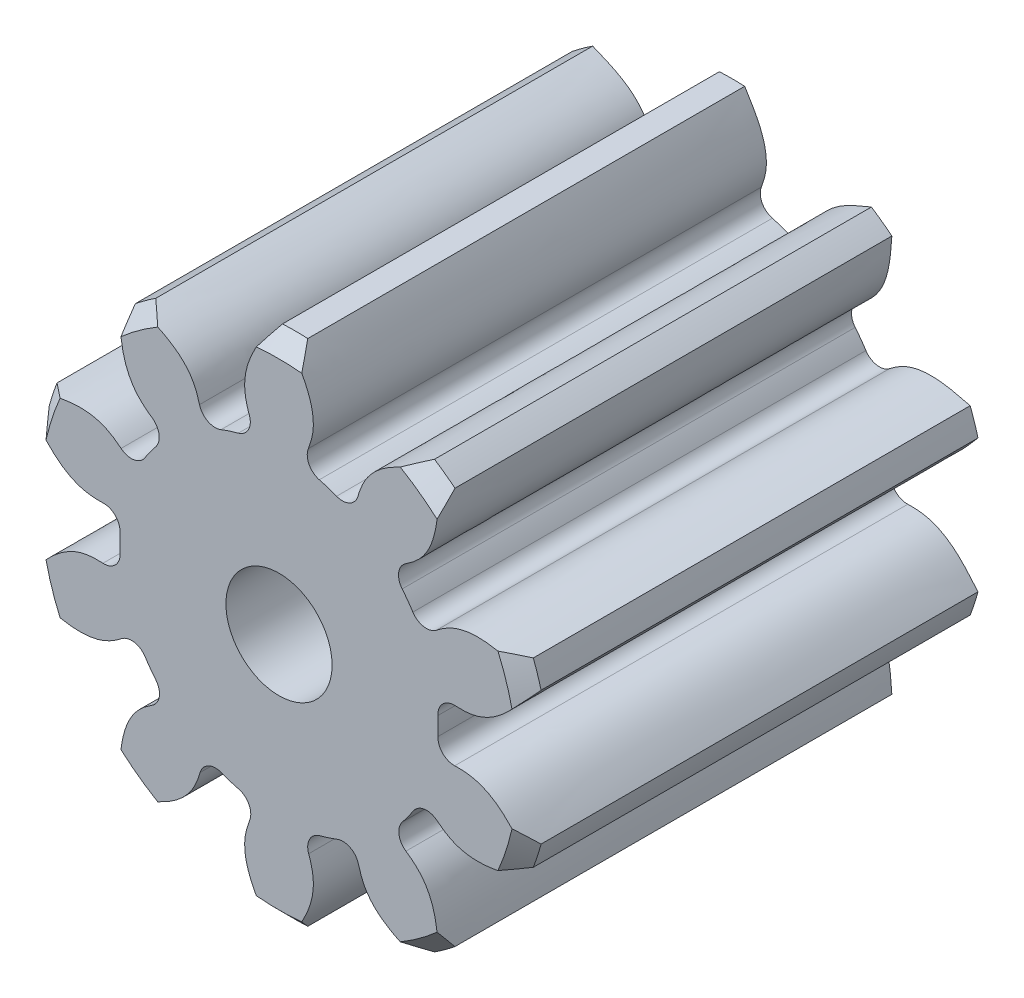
ISO-10303-21;
HEADER;
FILE_DESCRIPTION(('STEP AP214'),'2;1');
FILE_NAME('part.step','',(''),(''),'','','');
FILE_SCHEMA(('AUTOMOTIVE_DESIGN { 1 0 10303 214 1 1 1 1 }'));
ENDSEC;
DATA;
#1=APPLICATION_CONTEXT('core data for automotive mechanical design processes');
#2=APPLICATION_PROTOCOL_DEFINITION('international standard','automotive_design',2000,#1);
#3=PRODUCT_CONTEXT('',#1,'mechanical');
#4=PRODUCT('Part','Part','',(#3));
#5=PRODUCT_RELATED_PRODUCT_CATEGORY('part','',(#4));
#6=PRODUCT_DEFINITION_FORMATION('','',#4);
#7=PRODUCT_DEFINITION_CONTEXT('part definition',#1,'design');
#8=PRODUCT_DEFINITION('design','',#6,#7);
#9=PRODUCT_DEFINITION_SHAPE('','',#8);
#10=(LENGTH_UNIT() NAMED_UNIT(*) SI_UNIT(.MILLI.,.METRE.));
#11=(NAMED_UNIT(*) PLANE_ANGLE_UNIT() SI_UNIT($,.RADIAN.));
#12=(NAMED_UNIT(*) SI_UNIT($,.STERADIAN.) SOLID_ANGLE_UNIT());
#13=UNCERTAINTY_MEASURE_WITH_UNIT(LENGTH_MEASURE(1.E-05),#10,'distance_accuracy_value','');
#14=(GEOMETRIC_REPRESENTATION_CONTEXT(3) GLOBAL_UNCERTAINTY_ASSIGNED_CONTEXT((#13)) GLOBAL_UNIT_ASSIGNED_CONTEXT((#10,
#11,#12)) REPRESENTATION_CONTEXT('',''));
#15=CARTESIAN_POINT('',(0.,0.,0.));
#16=DIRECTION('',(0.,0.,1.));
#17=DIRECTION('',(1.,0.,0.));
#18=AXIS2_PLACEMENT_3D('',#15,#16,#17);
#19=CARTESIAN_POINT('',(0.,0.,-3.2));
#20=DIRECTION('',(0.,0.,1.));
#21=DIRECTION('',(1.,0.,0.));
#22=AXIS2_PLACEMENT_3D('',#19,#20,#21);
#23=CYLINDRICAL_SURFACE('',#22,2.25);
#24=CARTESIAN_POINT('',(0.,0.,-3.2));
#25=DIRECTION('',(0.,0.,1.));
#26=DIRECTION('',(1.,0.,0.));
#27=AXIS2_PLACEMENT_3D('',#24,#25,#26);
#28=CIRCLE('',#27,2.25);
#29=CARTESIAN_POINT('',(1.89116458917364,1.21901455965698,-3.2));
#30=VERTEX_POINT('',#29);
#31=CARTESIAN_POINT('',(1.73986221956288,1.42666725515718,-3.2));
#32=VERTEX_POINT('',#31);
#33=EDGE_CURVE('E1135',#30,#32,#28,.T.);
#34=ORIENTED_EDGE('',*,*,#33,.T.);
#35=DIRECTION('',(0.,0.,1.));
#36=VECTOR('',#35,1.);
#37=CARTESIAN_POINT('',(1.73986221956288,1.42666725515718,-3.2));
#38=LINE('',#37,#36);
#39=CARTESIAN_POINT('',(1.73986221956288,1.42666725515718,3.2));
#40=VERTEX_POINT('',#39);
#41=EDGE_CURVE('E1149',#32,#40,#38,.T.);
#42=ORIENTED_EDGE('',*,*,#41,.T.);
#43=CARTESIAN_POINT('',(0.,0.,3.2));
#44=DIRECTION('',(0.,0.,1.));
#45=DIRECTION('',(1.,0.,0.));
#46=AXIS2_PLACEMENT_3D('',#43,#44,#45);
#47=CIRCLE('',#46,2.25);
#48=CARTESIAN_POINT('',(1.89116458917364,1.21901455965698,3.2));
#49=VERTEX_POINT('',#48);
#50=EDGE_CURVE('E1330',#49,#40,#47,.T.);
#51=ORIENTED_EDGE('',*,*,#50,.F.);
#52=DIRECTION('',(0.,0.,1.));
#53=VECTOR('',#52,1.);
#54=CARTESIAN_POINT('',(1.89116458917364,1.21901455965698,-3.2));
#55=LINE('',#54,#53);
#56=EDGE_CURVE('E1308',#49,#30,#55,.F.);
#57=ORIENTED_EDGE('',*,*,#56,.T.);
#58=EDGE_LOOP('',(#34,#42,#51,#57));
#59=FACE_BOUND('',#58,.T.);
#60=ADVANCED_FACE('F32',(#59),#23,.T.);
#61=CARTESIAN_POINT('',(2.24650307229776,-0.125395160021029,-3.2));
#62=VERTEX_POINT('',#61);
#63=CARTESIAN_POINT('',(2.24615207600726,0.131532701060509,-3.2));
#64=VERTEX_POINT('',#63);
#65=EDGE_CURVE('E1340',#62,#64,#28,.T.);
#66=ORIENTED_EDGE('',*,*,#65,.T.);
#67=DIRECTION('',(0.,0.,1.));
#68=VECTOR('',#67,1.);
#69=CARTESIAN_POINT('',(2.24615207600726,0.131532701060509,-3.2));
#70=LINE('',#69,#68);
#71=CARTESIAN_POINT('',(2.24615207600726,0.131532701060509,3.2));
#72=VERTEX_POINT('',#71);
#73=EDGE_CURVE('E1313',#64,#72,#70,.T.);
#74=ORIENTED_EDGE('',*,*,#73,.T.);
#75=CARTESIAN_POINT('',(2.24650307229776,-0.125395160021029,3.2));
#76=VERTEX_POINT('',#75);
#77=EDGE_CURVE('E1336',#76,#72,#47,.T.);
#78=ORIENTED_EDGE('',*,*,#77,.F.);
#79=DIRECTION('',(0.,0.,1.));
#80=VECTOR('',#79,1.);
#81=CARTESIAN_POINT('',(2.24650307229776,-0.125395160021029,-3.2));
#82=LINE('',#81,#80);
#83=EDGE_CURVE('E1290',#76,#62,#82,.F.);
#84=ORIENTED_EDGE('',*,*,#83,.T.);
#85=EDGE_LOOP('',(#66,#74,#78,#84));
#86=FACE_BOUND('',#85,.T.);
#87=ADVANCED_FACE('F1383',(#86),#23,.T.);
#88=CARTESIAN_POINT('',(1.74375373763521,-1.42190819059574,-3.2));
#89=VERTEX_POINT('',#88);
#90=CARTESIAN_POINT('',(1.894488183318,-1.2138428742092,-3.2));
#91=VERTEX_POINT('',#90);
#92=EDGE_CURVE('E2021',#89,#91,#28,.T.);
#93=ORIENTED_EDGE('',*,*,#92,.T.);
#94=DIRECTION('',(0.,0.,1.));
#95=VECTOR('',#94,1.);
#96=CARTESIAN_POINT('',(1.894488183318,-1.2138428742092,-3.2));
#97=LINE('',#96,#95);
#98=CARTESIAN_POINT('',(1.894488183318,-1.2138428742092,3.2));
#99=VERTEX_POINT('',#98);
#100=EDGE_CURVE('E1295',#91,#99,#97,.T.);
#101=ORIENTED_EDGE('',*,*,#100,.T.);
#102=CARTESIAN_POINT('',(1.74375373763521,-1.42190819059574,3.2));
#103=VERTEX_POINT('',#102);
#104=EDGE_CURVE('E2033',#103,#99,#47,.T.);
#105=ORIENTED_EDGE('',*,*,#104,.F.);
#106=DIRECTION('',(0.,0.,1.));
#107=VECTOR('',#106,1.);
#108=CARTESIAN_POINT('',(1.74375373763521,-1.42190819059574,-3.2));
#109=LINE('',#108,#107);
#110=EDGE_CURVE('E1272',#103,#89,#109,.F.);
#111=ORIENTED_EDGE('',*,*,#110,.T.);
#112=EDGE_LOOP('',(#93,#101,#105,#111));
#113=FACE_BOUND('',#112,.T.);
#114=ADVANCED_FACE('F1387',(#113),#23,.T.);
#115=CARTESIAN_POINT('',(0.574949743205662,-2.17530062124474,-3.2));
#116=VERTEX_POINT('',#115);
#117=CARTESIAN_POINT('',(0.819194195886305,-2.09557172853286,-3.2));
#118=VERTEX_POINT('',#117);
#119=EDGE_CURVE('E2027',#116,#118,#28,.T.);
#120=ORIENTED_EDGE('',*,*,#119,.T.);
#121=DIRECTION('',(0.,0.,1.));
#122=VECTOR('',#121,1.);
#123=CARTESIAN_POINT('',(0.819194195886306,-2.09557172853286,-3.2));
#124=LINE('',#123,#122);
#125=CARTESIAN_POINT('',(0.819194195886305,-2.09557172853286,3.2));
#126=VERTEX_POINT('',#125);
#127=EDGE_CURVE('E1277',#118,#126,#124,.T.);
#128=ORIENTED_EDGE('',*,*,#127,.T.);
#129=CARTESIAN_POINT('',(0.574949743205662,-2.17530062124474,3.2));
#130=VERTEX_POINT('',#129);
#131=EDGE_CURVE('E2050',#130,#126,#47,.T.);
#132=ORIENTED_EDGE('',*,*,#131,.F.);
#133=DIRECTION('',(0.,0.,1.));
#134=VECTOR('',#133,1.);
#135=CARTESIAN_POINT('',(0.574949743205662,-2.17530062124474,-3.2));
#136=LINE('',#135,#134);
#137=EDGE_CURVE('E1254',#130,#116,#136,.F.);
#138=ORIENTED_EDGE('',*,*,#137,.T.);
#139=EDGE_LOOP('',(#120,#128,#132,#138));
#140=FACE_BOUND('',#139,.T.);
#141=ADVANCED_FACE('F1891',(#140),#23,.T.);
#142=CARTESIAN_POINT('',(-0.813465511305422,-2.097802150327,-3.2));
#143=VERTEX_POINT('',#142);
#144=CARTESIAN_POINT('',(-0.569004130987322,-2.17686340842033,-3.2));
#145=VERTEX_POINT('',#144);
#146=EDGE_CURVE('E2168',#143,#145,#28,.T.);
#147=ORIENTED_EDGE('',*,*,#146,.T.);
#148=DIRECTION('',(0.,0.,1.));
#149=VECTOR('',#148,1.);
#150=CARTESIAN_POINT('',(-0.569004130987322,-2.17686340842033,-3.2));
#151=LINE('',#150,#149);
#152=CARTESIAN_POINT('',(-0.569004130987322,-2.17686340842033,3.2));
#153=VERTEX_POINT('',#152);
#154=EDGE_CURVE('E1259',#145,#153,#151,.T.);
#155=ORIENTED_EDGE('',*,*,#154,.T.);
#156=CARTESIAN_POINT('',(-0.813465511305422,-2.097802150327,3.2));
#157=VERTEX_POINT('',#156);
#158=EDGE_CURVE('E2052',#157,#153,#47,.T.);
#159=ORIENTED_EDGE('',*,*,#158,.F.);
#160=DIRECTION('',(0.,0.,1.));
#161=VECTOR('',#160,1.);
#162=CARTESIAN_POINT('',(-0.813465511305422,-2.097802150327,-3.2));
#163=LINE('',#162,#161);
#164=EDGE_CURVE('E1236',#157,#143,#163,.F.);
#165=ORIENTED_EDGE('',*,*,#164,.T.);
#166=EDGE_LOOP('',(#147,#155,#159,#165));
#167=FACE_BOUND('',#166,.T.);
#168=ADVANCED_FACE('F1882',(#167),#23,.T.);
#169=CARTESIAN_POINT('',(-1.89116458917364,-1.21901455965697,-3.2));
#170=VERTEX_POINT('',#169);
#171=CARTESIAN_POINT('',(-1.73986221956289,-1.42666725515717,-3.2));
#172=VERTEX_POINT('',#171);
#173=EDGE_CURVE('E2130',#170,#172,#28,.T.);
#174=ORIENTED_EDGE('',*,*,#173,.T.);
#175=DIRECTION('',(0.,0.,1.));
#176=VECTOR('',#175,1.);
#177=CARTESIAN_POINT('',(-1.73986221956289,-1.42666725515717,-3.2));
#178=LINE('',#177,#176);
#179=CARTESIAN_POINT('',(-1.73986221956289,-1.42666725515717,3.2));
#180=VERTEX_POINT('',#179);
#181=EDGE_CURVE('E1241',#172,#180,#178,.T.);
#182=ORIENTED_EDGE('',*,*,#181,.T.);
#183=CARTESIAN_POINT('',(-1.89116458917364,-1.21901455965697,3.2));
#184=VERTEX_POINT('',#183);
#185=EDGE_CURVE('E2056',#184,#180,#47,.T.);
#186=ORIENTED_EDGE('',*,*,#185,.F.);
#187=DIRECTION('',(0.,0.,1.));
#188=VECTOR('',#187,1.);
#189=CARTESIAN_POINT('',(-1.89116458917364,-1.21901455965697,-3.2));
#190=LINE('',#189,#188);
#191=EDGE_CURVE('E1218',#184,#170,#190,.F.);
#192=ORIENTED_EDGE('',*,*,#191,.T.);
#193=EDGE_LOOP('',(#174,#182,#186,#192));
#194=FACE_BOUND('',#193,.T.);
#195=ADVANCED_FACE('F1873',(#194),#23,.T.);
#196=CARTESIAN_POINT('',(-2.24650307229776,0.125395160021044,-3.2));
#197=VERTEX_POINT('',#196);
#198=CARTESIAN_POINT('',(-2.24615207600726,-0.131532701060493,-3.2));
#199=VERTEX_POINT('',#198);
#200=EDGE_CURVE('E2110',#197,#199,#28,.T.);
#201=ORIENTED_EDGE('',*,*,#200,.T.);
#202=DIRECTION('',(0.,0.,1.));
#203=VECTOR('',#202,1.);
#204=CARTESIAN_POINT('',(-2.24615207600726,-0.131532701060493,-3.2));
#205=LINE('',#204,#203);
#206=CARTESIAN_POINT('',(-2.24615207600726,-0.131532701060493,3.2));
#207=VERTEX_POINT('',#206);
#208=EDGE_CURVE('E1223',#199,#207,#205,.T.);
#209=ORIENTED_EDGE('',*,*,#208,.T.);
#210=CARTESIAN_POINT('',(-2.24650307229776,0.125395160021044,3.2));
#211=VERTEX_POINT('',#210);
#212=EDGE_CURVE('E2060',#211,#207,#47,.T.);
#213=ORIENTED_EDGE('',*,*,#212,.F.);
#214=DIRECTION('',(0.,0.,1.));
#215=VECTOR('',#214,1.);
#216=CARTESIAN_POINT('',(-2.24650307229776,0.125395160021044,-3.2));
#217=LINE('',#216,#215);
#218=EDGE_CURVE('E1200',#211,#197,#217,.F.);
#219=ORIENTED_EDGE('',*,*,#218,.T.);
#220=EDGE_LOOP('',(#201,#209,#213,#219));
#221=FACE_BOUND('',#220,.T.);
#222=ADVANCED_FACE('F1865',(#221),#23,.T.);
#223=CARTESIAN_POINT('',(-1.7437537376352,1.42190819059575,-3.2));
#224=VERTEX_POINT('',#223);
#225=CARTESIAN_POINT('',(-1.89448818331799,1.21384287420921,-3.2));
#226=VERTEX_POINT('',#225);
#227=EDGE_CURVE('E1079',#224,#226,#28,.T.);
#228=ORIENTED_EDGE('',*,*,#227,.T.);
#229=DIRECTION('',(0.,0.,1.));
#230=VECTOR('',#229,1.);
#231=CARTESIAN_POINT('',(-1.89448818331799,1.21384287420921,-3.2));
#232=LINE('',#231,#230);
#233=CARTESIAN_POINT('',(-1.89448818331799,1.21384287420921,3.2));
#234=VERTEX_POINT('',#233);
#235=EDGE_CURVE('E1205',#226,#234,#232,.T.);
#236=ORIENTED_EDGE('',*,*,#235,.T.);
#237=CARTESIAN_POINT('',(-1.7437537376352,1.42190819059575,3.2));
#238=VERTEX_POINT('',#237);
#239=EDGE_CURVE('E1075',#238,#234,#47,.T.);
#240=ORIENTED_EDGE('',*,*,#239,.F.);
#241=DIRECTION('',(0.,0.,1.));
#242=VECTOR('',#241,1.);
#243=CARTESIAN_POINT('',(-1.7437537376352,1.42190819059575,-3.2));
#244=LINE('',#243,#242);
#245=EDGE_CURVE('E1178',#238,#224,#244,.F.);
#246=ORIENTED_EDGE('',*,*,#245,.T.);
#247=EDGE_LOOP('',(#228,#236,#240,#246));
#248=FACE_BOUND('',#247,.T.);
#249=ADVANCED_FACE('F1394',(#248),#23,.T.);
#250=CARTESIAN_POINT('',(-0.574949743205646,2.17530062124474,-3.2));
#251=VERTEX_POINT('',#250);
#252=CARTESIAN_POINT('',(-0.81919419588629,2.09557172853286,-3.2));
#253=VERTEX_POINT('',#252);
#254=EDGE_CURVE('E1070',#251,#253,#28,.T.);
#255=ORIENTED_EDGE('',*,*,#254,.T.);
#256=DIRECTION('',(0.,0.,1.));
#257=VECTOR('',#256,1.);
#258=CARTESIAN_POINT('',(-0.81919419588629,2.09557172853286,-3.2));
#259=LINE('',#258,#257);
#260=CARTESIAN_POINT('',(-0.81919419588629,2.09557172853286,3.2));
#261=VERTEX_POINT('',#260);
#262=EDGE_CURVE('E1185',#253,#261,#259,.T.);
#263=ORIENTED_EDGE('',*,*,#262,.T.);
#264=CARTESIAN_POINT('',(-0.574949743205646,2.17530062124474,3.2));
#265=VERTEX_POINT('',#264);
#266=EDGE_CURVE('E1071',#265,#261,#47,.T.);
#267=ORIENTED_EDGE('',*,*,#266,.F.);
#268=DIRECTION('',(0.,0.,1.));
#269=VECTOR('',#268,1.);
#270=CARTESIAN_POINT('',(-0.574949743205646,2.17530062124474,-3.2));
#271=LINE('',#270,#269);
#272=EDGE_CURVE('E1062',#265,#251,#271,.F.);
#273=ORIENTED_EDGE('',*,*,#272,.T.);
#274=EDGE_LOOP('',(#255,#263,#267,#273));
#275=FACE_BOUND('',#274,.T.);
#276=ADVANCED_FACE('F1390',(#275),#23,.T.);
#277=CARTESIAN_POINT('',(0.813465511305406,2.09780215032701,3.2));
#278=VERTEX_POINT('',#277);
#279=CARTESIAN_POINT('',(0.569004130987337,2.17686340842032,3.2));
#280=VERTEX_POINT('',#279);
#281=EDGE_CURVE('E1076',#278,#280,#47,.T.);
#282=ORIENTED_EDGE('',*,*,#281,.F.);
#283=DIRECTION('',(0.,0.,1.));
#284=VECTOR('',#283,1.);
#285=CARTESIAN_POINT('',(0.813465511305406,2.09780215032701,-3.2));
#286=LINE('',#285,#284);
#287=CARTESIAN_POINT('',(0.813465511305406,2.09780215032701,-3.2));
#288=VERTEX_POINT('',#287);
#289=EDGE_CURVE('E1141',#278,#288,#286,.F.);
#290=ORIENTED_EDGE('',*,*,#289,.T.);
#291=CARTESIAN_POINT('',(0.569004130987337,2.17686340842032,-3.2));
#292=VERTEX_POINT('',#291);
#293=EDGE_CURVE('E1074',#288,#292,#28,.T.);
#294=ORIENTED_EDGE('',*,*,#293,.T.);
#295=DIRECTION('',(0.,0.,1.));
#296=VECTOR('',#295,1.);
#297=CARTESIAN_POINT('',(0.569004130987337,2.17686340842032,-3.2));
#298=LINE('',#297,#296);
#299=EDGE_CURVE('E1064',#292,#280,#298,.T.);
#300=ORIENTED_EDGE('',*,*,#299,.T.);
#301=EDGE_LOOP('',(#282,#290,#294,#300));
#302=FACE_BOUND('',#301,.T.);
#303=ADVANCED_FACE('F1379',(#302),#23,.T.);
#304=CARTESIAN_POINT('',(0.,0.,-3.2));
#305=DIRECTION('',(0.,0.,1.));
#306=DIRECTION('',(1.,0.,0.));
#307=AXIS2_PLACEMENT_3D('',#304,#305,#306);
#308=PLANE('',#307);
#309=CARTESIAN_POINT('',(0.,0.,-3.2));
#310=DIRECTION('',(0.,0.,1.));
#311=DIRECTION('',(1.,0.,0.));
#312=AXIS2_PLACEMENT_3D('',#309,#310,#311);
#313=CIRCLE('',#312,0.75);
#314=CARTESIAN_POINT('',(0.75,0.,-3.2));
#315=VERTEX_POINT('',#314);
#316=EDGE_CURVE('E1364',#315,#315,#313,.F.);
#317=ORIENTED_EDGE('',*,*,#316,.F.);
#318=EDGE_LOOP('',(#317));
#319=FACE_BOUND('',#318,.T.);
#320=ORIENTED_EDGE('',*,*,#293,.F.);
#321=CARTESIAN_POINT('',(0.895896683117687,2.31037943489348,-3.2));
#322=DIRECTION('',(0.,0.,1.));
#323=DIRECTION('',(1.,0.,0.));
#324=AXIS2_PLACEMENT_3D('',#321,#322,#323);
#325=CIRCLE('',#324,0.228);
#326=CARTESIAN_POINT('',(1.11508769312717,2.24761558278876,-3.2));
#327=VERTEX_POINT('',#326);
#328=EDGE_CURVE('E1133',#288,#327,#325,.T.);
#329=ORIENTED_EDGE('',*,*,#328,.T.);
#330=CARTESIAN_POINT('',(1.96893737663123,3.01384896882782,-3.2));
#331=CARTESIAN_POINT('',(1.74817890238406,2.9244196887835,-3.2));
#332=CARTESIAN_POINT('',(1.46851312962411,2.81112705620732,-3.2));
#333=CARTESIAN_POINT('',(1.08321817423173,2.35704226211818,-3.2));
#334=CARTESIAN_POINT('',(1.06474813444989,1.97505157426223,-3.2));
#335=CARTESIAN_POINT('',(1.00685675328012,1.68965859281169,-3.2));
#336=B_SPLINE_CURVE_WITH_KNOTS('',3,(#330,#331,#332,#333,#334,#335),.UNSPECIFIED.,.F.,.F.,(4,1,
1,4),(0.,0.396845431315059,0.502739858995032,1.),.UNSPECIFIED.);
#337=CARTESIAN_POINT('',(1.96893737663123,3.01384896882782,-3.2));
#338=VERTEX_POINT('',#337);
#339=EDGE_CURVE('E488',#338,#327,#336,.T.);
#340=ORIENTED_EDGE('',*,*,#339,.F.);
#341=CARTESIAN_POINT('',(0.,0.,-3.2));
#342=DIRECTION('',(0.,0.,1.));
#343=DIRECTION('',(0.809016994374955,-0.587785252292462,0.));
#344=AXIS2_PLACEMENT_3D('',#341,#342,#343);
#345=CIRCLE('',#344,3.6);
#346=CARTESIAN_POINT('',(2.25790559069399,2.80390127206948,-3.2));
#347=VERTEX_POINT('',#346);
#348=EDGE_CURVE('E482',#347,#338,#345,.T.);
#349=ORIENTED_EDGE('',*,*,#348,.F.);
#350=CARTESIAN_POINT('',(1.29582496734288,1.47971089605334,-3.2));
#351=CARTESIAN_POINT('',(1.53724515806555,1.64255087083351,-3.2));
#352=CARTESIAN_POINT('',(1.90797010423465,1.75691436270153,-3.2));
#353=CARTESIAN_POINT('',(2.21926129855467,2.26610748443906,-3.2));
#354=CARTESIAN_POINT('',(2.24085794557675,2.56665749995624,-3.2));
#355=CARTESIAN_POINT('',(2.25790559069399,2.80390127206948,-3.2));
#356=B_SPLINE_CURVE_WITH_KNOTS('',3,(#350,#351,#352,#353,#354,#355),.UNSPECIFIED.,.F.,.F.,(4,1,
1,4),(0.,0.497260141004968,0.603154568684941,1.),.UNSPECIFIED.);
#357=CARTESIAN_POINT('',(1.79311407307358,1.76317803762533,-3.2));
#358=VERTEX_POINT('',#357);
#359=EDGE_CURVE('E473',#358,#347,#356,.T.);
#360=ORIENTED_EDGE('',*,*,#359,.F.);
#361=CARTESIAN_POINT('',(1.91616825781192,1.57123620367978,-3.2));
#362=DIRECTION('',(0.,0.,1.));
#363=DIRECTION('',(1.,0.,0.));
#364=AXIS2_PLACEMENT_3D('',#361,#362,#363);
#365=CIRCLE('',#364,0.228);
#366=EDGE_CURVE('E1144',#358,#32,#365,.T.);
#367=ORIENTED_EDGE('',*,*,#366,.T.);
#368=ORIENTED_EDGE('',*,*,#33,.F.);
#369=CARTESIAN_POINT('',(2.08280260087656,1.34254136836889,-3.2));
#370=DIRECTION('',(0.,0.,1.));
#371=DIRECTION('',(1.,0.,0.));
#372=AXIS2_PLACEMENT_3D('',#369,#370,#371);
#373=CIRCLE('',#372,0.228);
#374=CARTESIAN_POINT('',(2.22324018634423,1.16292710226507,-3.2));
#375=VERTEX_POINT('',#374);
#376=EDGE_CURVE('E1317',#30,#375,#373,.T.);
#377=ORIENTED_EDGE('',*,*,#376,.T.);
#378=CARTESIAN_POINT('',(3.36439977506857,1.28094268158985,-3.2));
#379=CARTESIAN_POINT('',(3.13323720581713,1.33835144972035,-3.2));
#380=CARTESIAN_POINT('',(2.84039110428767,1.41107920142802,-3.2));
#381=CARTESIAN_POINT('',(2.26177659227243,1.27018757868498,-3.2));
#382=CARTESIAN_POINT('',(2.02230552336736,0.972007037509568,-3.2));
#383=CARTESIAN_POINT('',(1.80772062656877,0.775146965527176,-3.2));
#384=B_SPLINE_CURVE_WITH_KNOTS('',3,(#378,#379,#380,#381,#382,#383),.UNSPECIFIED.,.F.,.F.,(4,1,
1,4),(0.,0.396845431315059,0.502739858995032,1.),.UNSPECIFIED.);
#385=CARTESIAN_POINT('',(3.36439977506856,1.28094268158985,-3.2));
#386=VERTEX_POINT('',#385);
#387=EDGE_CURVE('E563',#386,#375,#384,.T.);
#388=ORIENTED_EDGE('',*,*,#387,.F.);
#389=CARTESIAN_POINT('',(0.,0.,-3.2));
#390=DIRECTION('',(0.,0.,1.));
#391=DIRECTION('',(0.309016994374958,-0.95105651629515,0.));
#392=AXIS2_PLACEMENT_3D('',#389,#390,#391);
#393=CIRCLE('',#392,3.6);
#394=CARTESIAN_POINT('',(3.47477581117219,0.941240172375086,-3.2));
#395=VERTEX_POINT('',#394);
#396=EDGE_CURVE('E571',#395,#386,#393,.T.);
#397=ORIENTED_EDGE('',*,*,#396,.F.);
#398=CARTESIAN_POINT('',(1.91809666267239,0.435444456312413,-3.2));
#399=CARTESIAN_POINT('',(2.20912463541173,0.425281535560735,-3.2));
#400=CARTESIAN_POINT('',(2.57626859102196,0.299896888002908,-3.2));
#401=CARTESIAN_POINT('',(3.12740466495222,0.528870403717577,-3.2));
#402=CARTESIAN_POINT('',(3.32153558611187,0.759326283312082,-3.2));
#403=CARTESIAN_POINT('',(3.47477581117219,0.941240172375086,-3.2));
#404=B_SPLINE_CURVE_WITH_KNOTS('',3,(#398,#399,#400,#401,#402,#403),.UNSPECIFIED.,.F.,.F.,(4,1,
1,4),(0.,0.497260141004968,0.603154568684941,1.),.UNSPECIFIED.);
#405=CARTESIAN_POINT('',(2.48702980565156,0.372474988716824,-3.2));
#406=VERTEX_POINT('',#405);
#407=EDGE_CURVE('E587',#406,#395,#404,.T.);
#408=ORIENTED_EDGE('',*,*,#407,.F.);
#409=CARTESIAN_POINT('',(2.47376215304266,0.144861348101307,-3.2));
#410=DIRECTION('',(0.,0.,1.));
#411=DIRECTION('',(1.,0.,0.));
#412=AXIS2_PLACEMENT_3D('',#409,#410,#411);
#413=CIRCLE('',#412,0.228);
#414=EDGE_CURVE('E1319',#406,#64,#413,.T.);
#415=ORIENTED_EDGE('',*,*,#414,.T.);
#416=ORIENTED_EDGE('',*,*,#65,.F.);
#417=CARTESIAN_POINT('',(2.47414871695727,-0.138101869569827,-3.2));
#418=DIRECTION('',(0.,0.,1.));
#419=DIRECTION('',(1.,0.,0.));
#420=AXIS2_PLACEMENT_3D('',#417,#418,#419);
#421=CIRCLE('',#420,0.228);
#422=CARTESIAN_POINT('',(2.48219049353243,-0.365960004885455,-3.2));
#423=VERTEX_POINT('',#422);
#424=EDGE_CURVE('E1299',#62,#423,#421,.T.);
#425=ORIENTED_EDGE('',*,*,#424,.T.);
#426=CARTESIAN_POINT('',(3.4747758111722,-0.941240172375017,-3.2));
#427=CARTESIAN_POINT('',(3.3215053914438,-0.758921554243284,-3.2));
#428=CARTESIAN_POINT('',(3.12733621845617,-0.527952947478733,-3.2));
#429=CARTESIAN_POINT('',(2.57641322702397,-0.301835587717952,-3.2));
#430=CARTESIAN_POINT('',(2.20741093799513,-0.40231115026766,-3.2));
#431=CARTESIAN_POINT('',(1.9180966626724,-0.435444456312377,-3.2));
#432=B_SPLINE_CURVE_WITH_KNOTS('',3,(#426,#427,#428,#429,#430,#431),.UNSPECIFIED.,.F.,.F.,(4,1,
1,4),(0.,0.396845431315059,0.502739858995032,1.),.UNSPECIFIED.);
#433=CARTESIAN_POINT('',(3.4747758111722,-0.941240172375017,-3.2));
#434=VERTEX_POINT('',#433);
#435=EDGE_CURVE('E639',#434,#423,#432,.T.);
#436=ORIENTED_EDGE('',*,*,#435,.F.);
#437=CARTESIAN_POINT('',(0.,0.,-3.2));
#438=DIRECTION('',(0.,0.,1.));
#439=DIRECTION('',(-0.309016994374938,-0.951056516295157,0.));
#440=AXIS2_PLACEMENT_3D('',#437,#438,#439);
#441=CIRCLE('',#440,3.6);
#442=CARTESIAN_POINT('',(3.36439977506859,-1.28094268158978,-3.2));
#443=VERTEX_POINT('',#442);
#444=EDGE_CURVE('E602',#443,#434,#441,.T.);
#445=ORIENTED_EDGE('',*,*,#444,.F.);
#446=CARTESIAN_POINT('',(1.80772062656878,-0.775146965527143,-3.2));
#447=CARTESIAN_POINT('',(2.03719358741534,-0.954430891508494,-3.2));
#448=CARTESIAN_POINT('',(2.26052004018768,-1.27167100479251,-3.2));
#449=CARTESIAN_POINT('',(2.84098574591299,-1.41037719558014,-3.2));
#450=CARTESIAN_POINT('',(3.13349952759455,-1.33804176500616,-3.2));
#451=CARTESIAN_POINT('',(3.36439977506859,-1.28094268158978,-3.2));
#452=B_SPLINE_CURVE_WITH_KNOTS('',3,(#446,#447,#448,#449,#450,#451),.UNSPECIFIED.,.F.,.F.,(4,1,
1,4),(0.,0.497260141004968,0.603154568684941,1.),.UNSPECIFIED.);
#453=CARTESIAN_POINT('',(2.23098468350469,-1.16050084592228,-3.2));
#454=VERTEX_POINT('',#453);
#455=EDGE_CURVE('E597',#454,#443,#452,.T.);
#456=ORIENTED_EDGE('',*,*,#455,.F.);
#457=CARTESIAN_POINT('',(2.08646298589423,-1.33684561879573,-3.2));
#458=DIRECTION('',(0.,0.,1.));
#459=DIRECTION('',(1.,0.,0.));
#460=AXIS2_PLACEMENT_3D('',#457,#458,#459);
#461=CIRCLE('',#460,0.228);
#462=EDGE_CURVE('E1301',#454,#91,#461,.T.);
#463=ORIENTED_EDGE('',*,*,#462,.T.);
#464=ORIENTED_EDGE('',*,*,#92,.F.);
#465=CARTESIAN_POINT('',(1.92045411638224,-1.56599488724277,-3.2));
#466=DIRECTION('',(0.,0.,1.));
#467=DIRECTION('',(1.,0.,0.));
#468=AXIS2_PLACEMENT_3D('',#465,#466,#467);
#469=CIRCLE('',#468,0.228);
#470=CARTESIAN_POINT('',(1.79302839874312,-1.75506282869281,-3.2));
#471=VERTEX_POINT('',#470);
#472=EDGE_CURVE('E1281',#89,#471,#469,.T.);
#473=ORIENTED_EDGE('',*,*,#472,.T.);
#474=CARTESIAN_POINT('',(2.25790559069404,-2.80390127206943,-3.2));
#475=CARTESIAN_POINT('',(2.24107141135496,-2.56631231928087,-3.2));
#476=CARTESIAN_POINT('',(2.21974519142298,-2.26532501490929,-3.2));
#477=CARTESIAN_POINT('',(1.90694757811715,-1.75856781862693,-3.2));
#478=CARTESIAN_POINT('',(1.54936040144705,-1.62296015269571,-3.2));
#479=CARTESIAN_POINT('',(1.29582496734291,-1.47971089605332,-3.2));
#480=B_SPLINE_CURVE_WITH_KNOTS('',3,(#474,#475,#476,#477,#478,#479),.UNSPECIFIED.,.F.,.F.,(4,1,
1,4),(0.,0.396845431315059,0.502739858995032,1.),.UNSPECIFIED.);
#481=CARTESIAN_POINT('',(2.25790559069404,-2.80390127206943,-3.2));
#482=VERTEX_POINT('',#481);
#483=EDGE_CURVE('E2206',#482,#471,#480,.T.);
#484=ORIENTED_EDGE('',*,*,#483,.F.);
#485=CARTESIAN_POINT('',(0.,0.,-3.2));
#486=DIRECTION('',(0.,0.,1.));
#487=DIRECTION('',(-0.809016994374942,-0.58778525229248,0.));
#488=AXIS2_PLACEMENT_3D('',#485,#486,#487);
#489=CIRCLE('',#488,3.6);
#490=CARTESIAN_POINT('',(1.96893737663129,-3.01384896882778,-3.2));
#491=VERTEX_POINT('',#490);
#492=EDGE_CURVE('E673',#491,#482,#489,.T.);
#493=ORIENTED_EDGE('',*,*,#492,.F.);
#494=CARTESIAN_POINT('',(1.00685675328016,-1.68965859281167,-3.2));
#495=CARTESIAN_POINT('',(1.08712383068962,-1.96958315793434,-3.2));
#496=CARTESIAN_POINT('',(1.08132966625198,-2.35750379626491,-3.2));
#497=CARTESIAN_POINT('',(1.46940683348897,-2.810908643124,-3.2));
#498=CARTESIAN_POINT('',(1.74857315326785,-2.92432333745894,-3.2));
#499=CARTESIAN_POINT('',(1.96893737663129,-3.01384896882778,-3.2));
#500=B_SPLINE_CURVE_WITH_KNOTS('',3,(#494,#495,#496,#497,#498,#499),.UNSPECIFIED.,.F.,.F.,(4,1,
1,4),(0.,0.497260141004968,0.603154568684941,1.),.UNSPECIFIED.);
#501=CARTESIAN_POINT('',(1.12277924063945,-2.25020480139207,-3.2));
#502=VERTEX_POINT('',#501);
#503=EDGE_CURVE('E668',#502,#491,#500,.T.);
#504=ORIENTED_EDGE('',*,*,#503,.F.);
#505=CARTESIAN_POINT('',(0.902205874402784,-2.30792299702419,-3.2));
#506=DIRECTION('',(0.,0.,1.));
#507=DIRECTION('',(1.,0.,0.));
#508=AXIS2_PLACEMENT_3D('',#505,#506,#507);
#509=CIRCLE('',#508,0.228);
#510=EDGE_CURVE('E1283',#502,#118,#509,.T.);
#511=ORIENTED_EDGE('',*,*,#510,.T.);
#512=ORIENTED_EDGE('',*,*,#119,.F.);
#513=CARTESIAN_POINT('',(0.633211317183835,-2.39573108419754,-3.2));
#514=DIRECTION('',(0.,0.,1.));
#515=DIRECTION('',(1.,0.,0.));
#516=AXIS2_PLACEMENT_3D('',#513,#514,#515);
#517=CIRCLE('',#516,0.228);
#518=CARTESIAN_POINT('',(0.418990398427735,-2.47379130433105,-3.2));
#519=VERTEX_POINT('',#518);
#520=EDGE_CURVE('E1263',#116,#519,#517,.T.);
#521=ORIENTED_EDGE('',*,*,#520,.T.);
#522=CARTESIAN_POINT('',(0.178592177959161,-3.59556738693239,-3.2));
#523=CARTESIAN_POINT('',(0.304624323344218,-3.39345900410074,-3.2));
#524=CARTESIAN_POINT('',(0.464286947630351,-3.13741992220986,-3.2));
#525=CARTESIAN_POINT('',(0.509092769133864,-2.54358691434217,-3.2));
#526=CARTESIAN_POINT('',(0.299506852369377,-2.22369353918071,-3.2));
#527=CARTESIAN_POINT('',(0.17859217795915,-1.95877806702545,-3.2));
#528=B_SPLINE_CURVE_WITH_KNOTS('',3,(#522,#523,#524,#525,#526,#527),.UNSPECIFIED.,.F.,.F.,(4,1,
1,4),(0.,0.396845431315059,0.502739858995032,1.),.UNSPECIFIED.);
#529=CARTESIAN_POINT('',(0.178592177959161,-3.59556738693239,-3.2));
#530=VERTEX_POINT('',#529);
#531=EDGE_CURVE('E746',#530,#519,#528,.T.);
#532=ORIENTED_EDGE('',*,*,#531,.F.);
#533=CARTESIAN_POINT('',(0.,0.,-3.2));
#534=DIRECTION('',(0.,0.,1.));
#535=DIRECTION('',(-1.,0.,0.));
#536=AXIS2_PLACEMENT_3D('',#533,#534,#535);
#537=CIRCLE('',#536,3.6);
#538=CARTESIAN_POINT('',(-0.178592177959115,-3.59556738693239,-3.2));
#539=VERTEX_POINT('',#538);
#540=EDGE_CURVE('E738',#539,#530,#537,.T.);
#541=ORIENTED_EDGE('',*,*,#540,.F.);
#542=CARTESIAN_POINT('',(-0.178592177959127,-1.95877806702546,-3.2));
#543=CARTESIAN_POINT('',(-0.278190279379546,-2.23242160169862,-3.2));
#544=CARTESIAN_POINT('',(-0.510891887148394,-2.54285026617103,-3.2));
#545=CARTESIAN_POINT('',(-0.463435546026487,-3.13776852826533,-3.2));
#546=CARTESIAN_POINT('',(-0.304248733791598,-3.39361278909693,-3.2));
#547=CARTESIAN_POINT('',(-0.178592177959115,-3.59556738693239,-3.2));
#548=B_SPLINE_CURVE_WITH_KNOTS('',3,(#542,#543,#544,#545,#546,#547),.UNSPECIFIED.,.F.,.F.,(4,1,
1,4),(0.,0.497260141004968,0.603154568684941,1.),.UNSPECIFIED.);
#549=CARTESIAN_POINT('',(-0.414289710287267,-2.4804070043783,-3.2));
#550=VERTEX_POINT('',#549);
#551=EDGE_CURVE('E732',#550,#539,#548,.T.);
#552=ORIENTED_EDGE('',*,*,#551,.F.);
#553=CARTESIAN_POINT('',(-0.626663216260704,-2.39745223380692,-3.2));
#554=DIRECTION('',(0.,0.,1.));
#555=DIRECTION('',(1.,0.,0.));
#556=AXIS2_PLACEMENT_3D('',#553,#554,#555);
#557=CIRCLE('',#556,0.228);
#558=EDGE_CURVE('E1265',#550,#145,#557,.T.);
#559=ORIENTED_EDGE('',*,*,#558,.T.);
#560=ORIENTED_EDGE('',*,*,#146,.F.);
#561=CARTESIAN_POINT('',(-0.895896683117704,-2.31037943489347,-3.2));
#562=DIRECTION('',(0.,0.,1.));
#563=DIRECTION('',(1.,0.,0.));
#564=AXIS2_PLACEMENT_3D('',#561,#562,#563);
#565=CIRCLE('',#564,0.228);
#566=CARTESIAN_POINT('',(-1.11508769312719,-2.24761558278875,-3.2));
#567=VERTEX_POINT('',#566);
#568=EDGE_CURVE('E1245',#143,#567,#565,.T.);
#569=ORIENTED_EDGE('',*,*,#568,.T.);
#570=CARTESIAN_POINT('',(-1.96893737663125,-3.01384896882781,-3.2));
#571=CARTESIAN_POINT('',(-1.74817890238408,-2.92441968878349,-3.2));
#572=CARTESIAN_POINT('',(-1.46851312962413,-2.81112705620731,-3.2));
#573=CARTESIAN_POINT('',(-1.08321817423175,-2.35704226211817,-3.2));
#574=CARTESIAN_POINT('',(-1.0647481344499,-1.97505157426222,-3.2));
#575=CARTESIAN_POINT('',(-1.00685675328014,-1.68965859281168,-3.2));
#576=B_SPLINE_CURVE_WITH_KNOTS('',3,(#570,#571,#572,#573,#574,#575),.UNSPECIFIED.,.F.,.F.,(4,1,
1,4),(0.,0.396845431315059,0.502739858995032,1.),.UNSPECIFIED.);
#577=CARTESIAN_POINT('',(-1.96893737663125,-3.01384896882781,-3.2));
#578=VERTEX_POINT('',#577);
#579=EDGE_CURVE('E2145',#578,#567,#576,.T.);
#580=ORIENTED_EDGE('',*,*,#579,.F.);
#581=CARTESIAN_POINT('',(0.,0.,-3.2));
#582=DIRECTION('',(0.,0.,1.));
#583=DIRECTION('',(-0.809016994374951,0.587785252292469,0.));
#584=AXIS2_PLACEMENT_3D('',#581,#582,#583);
#585=CIRCLE('',#584,3.6);
#586=CARTESIAN_POINT('',(-2.25790559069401,-2.80390127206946,-3.2));
#587=VERTEX_POINT('',#586);
#588=EDGE_CURVE('E782',#587,#578,#585,.T.);
#589=ORIENTED_EDGE('',*,*,#588,.F.);
#590=CARTESIAN_POINT('',(-1.29582496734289,-1.47971089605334,-3.2));
#591=CARTESIAN_POINT('',(-1.53724515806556,-1.6425508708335,-3.2));
#592=CARTESIAN_POINT('',(-1.90797010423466,-1.75691436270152,-3.2));
#593=CARTESIAN_POINT('',(-2.21926129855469,-2.26610748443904,-3.2));
#594=CARTESIAN_POINT('',(-2.24085794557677,-2.56665749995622,-3.2));
#595=CARTESIAN_POINT('',(-2.25790559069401,-2.80390127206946,-3.2));
#596=B_SPLINE_CURVE_WITH_KNOTS('',3,(#590,#591,#592,#593,#594,#595),.UNSPECIFIED.,.F.,.F.,(4,1,
1,4),(0.,0.497260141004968,0.603154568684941,1.),.UNSPECIFIED.);
#597=CARTESIAN_POINT('',(-1.79311407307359,-1.76317803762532,-3.2));
#598=VERTEX_POINT('',#597);
#599=EDGE_CURVE('E777',#598,#587,#596,.T.);
#600=ORIENTED_EDGE('',*,*,#599,.F.);
#601=CARTESIAN_POINT('',(-1.91616825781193,-1.57123620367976,-3.2));
#602=DIRECTION('',(0.,0.,1.));
#603=DIRECTION('',(1.,0.,0.));
#604=AXIS2_PLACEMENT_3D('',#601,#602,#603);
#605=CIRCLE('',#604,0.228);
#606=EDGE_CURVE('E1247',#598,#172,#605,.T.);
#607=ORIENTED_EDGE('',*,*,#606,.T.);
#608=ORIENTED_EDGE('',*,*,#173,.F.);
#609=CARTESIAN_POINT('',(-2.08280260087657,-1.34254136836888,-3.2));
#610=DIRECTION('',(0.,0.,1.));
#611=DIRECTION('',(1.,0.,0.));
#612=AXIS2_PLACEMENT_3D('',#609,#610,#611);
#613=CIRCLE('',#612,0.228);
#614=CARTESIAN_POINT('',(-2.22324018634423,-1.16292710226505,-3.2));
#615=VERTEX_POINT('',#614);
#616=EDGE_CURVE('E1227',#170,#615,#613,.T.);
#617=ORIENTED_EDGE('',*,*,#616,.T.);
#618=CARTESIAN_POINT('',(-3.36439977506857,-1.28094268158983,-3.2));
#619=CARTESIAN_POINT('',(-3.13323720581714,-1.33835144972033,-3.2));
#620=CARTESIAN_POINT('',(-2.84039110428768,-1.411079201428,-3.2));
#621=CARTESIAN_POINT('',(-2.26177659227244,-1.27018757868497,-3.2));
#622=CARTESIAN_POINT('',(-2.02230552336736,-0.972007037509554,-3.2));
#623=CARTESIAN_POINT('',(-1.80772062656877,-0.775146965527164,-3.2));
#624=B_SPLINE_CURVE_WITH_KNOTS('',3,(#618,#619,#620,#621,#622,#623),.UNSPECIFIED.,.F.,.F.,(4,1,
1,4),(0.,0.396845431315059,0.502739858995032,1.),.UNSPECIFIED.);
#625=CARTESIAN_POINT('',(-3.36439977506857,-1.28094268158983,-3.2));
#626=VERTEX_POINT('',#625);
#627=EDGE_CURVE('E858',#626,#615,#624,.T.);
#628=ORIENTED_EDGE('',*,*,#627,.F.);
#629=CARTESIAN_POINT('',(0.,0.,-3.2));
#630=DIRECTION('',(0.,0.,1.));
#631=DIRECTION('',(-0.309016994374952,0.951056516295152,0.));
#632=AXIS2_PLACEMENT_3D('',#629,#630,#631);
#633=CIRCLE('',#632,3.6);
#634=CARTESIAN_POINT('',(-3.47477581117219,-0.941240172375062,-3.2));
#635=VERTEX_POINT('',#634);
#636=EDGE_CURVE('E850',#635,#626,#633,.T.);
#637=ORIENTED_EDGE('',*,*,#636,.F.);
#638=CARTESIAN_POINT('',(-1.91809666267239,-0.4354444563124,-3.2));
#639=CARTESIAN_POINT('',(-2.20912463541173,-0.42528153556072,-3.2));
#640=CARTESIAN_POINT('',(-2.57626859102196,-0.29989688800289,-3.2));
#641=CARTESIAN_POINT('',(-3.12740466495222,-0.528870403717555,-3.2));
#642=CARTESIAN_POINT('',(-3.32153558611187,-0.759326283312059,-3.2));
#643=CARTESIAN_POINT('',(-3.47477581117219,-0.941240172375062,-3.2));
#644=B_SPLINE_CURVE_WITH_KNOTS('',3,(#638,#639,#640,#641,#642,#643),.UNSPECIFIED.,.F.,.F.,(4,1,
1,4),(0.,0.497260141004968,0.603154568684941,1.),.UNSPECIFIED.);
#645=CARTESIAN_POINT('',(-2.48702980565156,-0.372474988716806,-3.2));
#646=VERTEX_POINT('',#645);
#647=EDGE_CURVE('E844',#646,#635,#644,.T.);
#648=ORIENTED_EDGE('',*,*,#647,.F.);
#649=CARTESIAN_POINT('',(-2.47376215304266,-0.14486134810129,-3.2));
#650=DIRECTION('',(0.,0.,1.));
#651=DIRECTION('',(1.,0.,0.));
#652=AXIS2_PLACEMENT_3D('',#649,#650,#651);
#653=CIRCLE('',#652,0.228);
#654=EDGE_CURVE('E1229',#646,#199,#653,.T.);
#655=ORIENTED_EDGE('',*,*,#654,.T.);
#656=ORIENTED_EDGE('',*,*,#200,.F.);
#657=CARTESIAN_POINT('',(-2.47414871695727,0.138101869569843,-3.2));
#658=DIRECTION('',(0.,0.,1.));
#659=DIRECTION('',(1.,0.,0.));
#660=AXIS2_PLACEMENT_3D('',#657,#658,#659);
#661=CIRCLE('',#660,0.228);
#662=CARTESIAN_POINT('',(-2.48219049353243,0.365960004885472,-3.2));
#663=VERTEX_POINT('',#662);
#664=EDGE_CURVE('E1209',#197,#663,#661,.T.);
#665=ORIENTED_EDGE('',*,*,#664,.T.);
#666=CARTESIAN_POINT('',(-3.4747758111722,0.941240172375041,-3.2));
#667=CARTESIAN_POINT('',(-3.3215053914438,0.758921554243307,-3.2));
#668=CARTESIAN_POINT('',(-3.12733621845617,0.527952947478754,-3.2));
#669=CARTESIAN_POINT('',(-2.57641322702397,0.30183558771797,-3.2));
#670=CARTESIAN_POINT('',(-2.20741093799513,0.402311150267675,-3.2));
#671=CARTESIAN_POINT('',(-1.91809666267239,0.43544445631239,-3.2));
#672=B_SPLINE_CURVE_WITH_KNOTS('',3,(#666,#667,#668,#669,#670,#671),.UNSPECIFIED.,.F.,.F.,(4,1,
1,4),(0.,0.396845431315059,0.502739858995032,1.),.UNSPECIFIED.);
#673=CARTESIAN_POINT('',(-3.4747758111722,0.941240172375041,-3.2));
#674=VERTEX_POINT('',#673);
#675=EDGE_CURVE('E2079',#674,#663,#672,.T.);
#676=ORIENTED_EDGE('',*,*,#675,.F.);
#677=CARTESIAN_POINT('',(0.,0.,-3.2));
#678=DIRECTION('',(0.,0.,1.));
#679=DIRECTION('',(0.309016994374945,0.951056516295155,0.));
#680=AXIS2_PLACEMENT_3D('',#677,#678,#679);
#681=CIRCLE('',#680,3.6);
#682=CARTESIAN_POINT('',(-3.36439977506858,1.28094268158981,-3.2));
#683=VERTEX_POINT('',#682);
#684=EDGE_CURVE('E894',#683,#674,#681,.T.);
#685=ORIENTED_EDGE('',*,*,#684,.F.);
#686=CARTESIAN_POINT('',(-1.80772062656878,0.775146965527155,-3.2));
#687=CARTESIAN_POINT('',(-2.03719358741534,0.954430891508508,-3.2));
#688=CARTESIAN_POINT('',(-2.26052004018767,1.27167100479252,-3.2));
#689=CARTESIAN_POINT('',(-2.84098574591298,1.41037719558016,-3.2));
#690=CARTESIAN_POINT('',(-3.13349952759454,1.33804176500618,-3.2));
#691=CARTESIAN_POINT('',(-3.36439977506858,1.28094268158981,-3.2));
#692=B_SPLINE_CURVE_WITH_KNOTS('',3,(#686,#687,#688,#689,#690,#691),.UNSPECIFIED.,.F.,.F.,(4,1,
1,4),(0.,0.497260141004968,0.603154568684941,1.),.UNSPECIFIED.);
#693=CARTESIAN_POINT('',(-2.23098468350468,1.16050084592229,-3.2));
#694=VERTEX_POINT('',#693);
#695=EDGE_CURVE('E889',#694,#683,#692,.T.);
#696=ORIENTED_EDGE('',*,*,#695,.F.);
#697=CARTESIAN_POINT('',(-2.08646298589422,1.33684561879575,-3.2));
#698=DIRECTION('',(0.,0.,1.));
#699=DIRECTION('',(1.,0.,0.));
#700=AXIS2_PLACEMENT_3D('',#697,#698,#699);
#701=CIRCLE('',#700,0.228);
#702=EDGE_CURVE('E1211',#694,#226,#701,.T.);
#703=ORIENTED_EDGE('',*,*,#702,.T.);
#704=ORIENTED_EDGE('',*,*,#227,.F.);
#705=CARTESIAN_POINT('',(-1.92045411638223,1.56599488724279,-3.2));
#706=DIRECTION('',(0.,0.,1.));
#707=DIRECTION('',(1.,0.,0.));
#708=AXIS2_PLACEMENT_3D('',#705,#706,#707);
#709=CIRCLE('',#708,0.228);
#710=CARTESIAN_POINT('',(-1.79302839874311,1.75506282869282,-3.2));
#711=VERTEX_POINT('',#710);
#712=EDGE_CURVE('E1191',#224,#711,#709,.T.);
#713=ORIENTED_EDGE('',*,*,#712,.T.);
#714=CARTESIAN_POINT('',(-2.25790559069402,2.80390127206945,-3.2));
#715=CARTESIAN_POINT('',(-2.24107141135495,2.56631231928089,-3.2));
#716=CARTESIAN_POINT('',(-2.21974519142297,2.26532501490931,-3.2));
#717=CARTESIAN_POINT('',(-1.90694757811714,1.75856781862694,-3.2));
#718=CARTESIAN_POINT('',(-1.54936040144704,1.62296015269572,-3.2));
#719=CARTESIAN_POINT('',(-1.2958249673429,1.47971089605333,-3.2));
#720=B_SPLINE_CURVE_WITH_KNOTS('',3,(#714,#715,#716,#717,#718,#719),.UNSPECIFIED.,.F.,.F.,(4,1,
1,4),(0.,0.396845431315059,0.502739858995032,1.),.UNSPECIFIED.);
#721=CARTESIAN_POINT('',(-2.25790559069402,2.80390127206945,-3.2));
#722=VERTEX_POINT('',#721);
#723=EDGE_CURVE('E970',#722,#711,#720,.T.);
#724=ORIENTED_EDGE('',*,*,#723,.F.);
#725=CARTESIAN_POINT('',(0.,0.,-3.2));
#726=DIRECTION('',(0.,0.,1.));
#727=DIRECTION('',(0.809016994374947,0.587785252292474,0.));
#728=AXIS2_PLACEMENT_3D('',#725,#726,#727);
#729=CIRCLE('',#728,3.6);
#730=CARTESIAN_POINT('',(-1.96893737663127,3.0138489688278,-3.2));
#731=VERTEX_POINT('',#730);
#732=EDGE_CURVE('E962',#731,#722,#729,.T.);
#733=ORIENTED_EDGE('',*,*,#732,.F.);
#734=CARTESIAN_POINT('',(-1.00685675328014,1.68965859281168,-3.2));
#735=CARTESIAN_POINT('',(-1.08712383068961,1.96958315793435,-3.2));
#736=CARTESIAN_POINT('',(-1.08132966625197,2.35750379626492,-3.2));
#737=CARTESIAN_POINT('',(-1.46940683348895,2.81090864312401,-3.2));
#738=CARTESIAN_POINT('',(-1.74857315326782,2.92432333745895,-3.2));
#739=CARTESIAN_POINT('',(-1.96893737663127,3.0138489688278,-3.2));
#740=B_SPLINE_CURVE_WITH_KNOTS('',3,(#734,#735,#736,#737,#738,#739),.UNSPECIFIED.,.F.,.F.,(4,1,
1,4),(0.,0.497260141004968,0.603154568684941,1.),.UNSPECIFIED.);
#741=CARTESIAN_POINT('',(-1.12277924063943,2.25020480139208,-3.2));
#742=VERTEX_POINT('',#741);
#743=EDGE_CURVE('E956',#742,#731,#740,.T.);
#744=ORIENTED_EDGE('',*,*,#743,.F.);
#745=CARTESIAN_POINT('',(-0.902205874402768,2.30792299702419,-3.2));
#746=DIRECTION('',(0.,0.,1.));
#747=DIRECTION('',(1.,0.,0.));
#748=AXIS2_PLACEMENT_3D('',#745,#746,#747);
#749=CIRCLE('',#748,0.228);
#750=EDGE_CURVE('E1193',#742,#253,#749,.T.);
#751=ORIENTED_EDGE('',*,*,#750,.T.);
#752=ORIENTED_EDGE('',*,*,#254,.F.);
#753=CARTESIAN_POINT('',(-0.633211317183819,2.39573108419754,-3.2));
#754=DIRECTION('',(0.,0.,1.));
#755=DIRECTION('',(1.,0.,0.));
#756=AXIS2_PLACEMENT_3D('',#753,#754,#755);
#757=CIRCLE('',#756,0.228);
#758=CARTESIAN_POINT('',(-0.418990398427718,2.47379130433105,-3.2));
#759=VERTEX_POINT('',#758);
#760=EDGE_CURVE('E1055',#251,#759,#757,.T.);
#761=ORIENTED_EDGE('',*,*,#760,.T.);
#762=CARTESIAN_POINT('',(-0.178592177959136,3.59556738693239,-3.2));
#763=CARTESIAN_POINT('',(-0.304624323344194,3.39345900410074,-3.2));
#764=CARTESIAN_POINT('',(-0.464286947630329,3.13741992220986,-3.2));
#765=CARTESIAN_POINT('',(-0.509092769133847,2.54358691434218,-3.2));
#766=CARTESIAN_POINT('',(-0.299506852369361,2.22369353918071,-3.2));
#767=CARTESIAN_POINT('',(-0.178592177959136,1.95877806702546,-3.2));
#768=B_SPLINE_CURVE_WITH_KNOTS('',3,(#762,#763,#764,#765,#766,#767),.UNSPECIFIED.,.F.,.F.,(4,1,
1,4),(0.,0.396845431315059,0.502739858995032,1.),.UNSPECIFIED.);
#769=CARTESIAN_POINT('',(-0.178592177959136,3.59556738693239,-3.2));
#770=VERTEX_POINT('',#769);
#771=EDGE_CURVE('E1084',#770,#759,#768,.T.);
#772=ORIENTED_EDGE('',*,*,#771,.F.);
#773=CARTESIAN_POINT('',(0.,0.,-3.2));
#774=DIRECTION('',(0.,0.,1.));
#775=DIRECTION('',(1.,0.,0.));
#776=AXIS2_PLACEMENT_3D('',#773,#774,#775);
#777=CIRCLE('',#776,3.6);
#778=CARTESIAN_POINT('',(0.17859217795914,3.59556738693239,-3.2));
#779=VERTEX_POINT('',#778);
#780=EDGE_CURVE('E1006',#779,#770,#777,.T.);
#781=ORIENTED_EDGE('',*,*,#780,.F.);
#782=CARTESIAN_POINT('',(0.178592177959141,1.95877806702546,-3.2));
#783=CARTESIAN_POINT('',(0.278190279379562,2.23242160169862,-3.2));
#784=CARTESIAN_POINT('',(0.510891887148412,2.54285026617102,-3.2));
#785=CARTESIAN_POINT('',(0.463435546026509,3.13776852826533,-3.2));
#786=CARTESIAN_POINT('',(0.304248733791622,3.39361278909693,-3.2));
#787=CARTESIAN_POINT('',(0.17859217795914,3.59556738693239,-3.2));
#788=B_SPLINE_CURVE_WITH_KNOTS('',3,(#782,#783,#784,#785,#786,#787),.UNSPECIFIED.,.F.,.F.,(4,1,
1,4),(0.,0.497260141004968,0.603154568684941,1.),.UNSPECIFIED.);
#789=CARTESIAN_POINT('',(0.414289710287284,2.4804070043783,-3.2));
#790=VERTEX_POINT('',#789);
#791=EDGE_CURVE('E1001',#790,#779,#788,.T.);
#792=ORIENTED_EDGE('',*,*,#791,.F.);
#793=CARTESIAN_POINT('',(0.626663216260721,2.39745223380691,-3.2));
#794=DIRECTION('',(0.,0.,1.));
#795=DIRECTION('',(1.,0.,0.));
#796=AXIS2_PLACEMENT_3D('',#793,#794,#795);
#797=CIRCLE('',#796,0.228);
#798=EDGE_CURVE('E1052',#790,#292,#797,.T.);
#799=ORIENTED_EDGE('',*,*,#798,.T.);
#800=EDGE_LOOP('',(#320,#329,#340,#349,#360,#367,#368,#377,#388,#397,#408,#415,#416,#425,#436,
#445,#456,#463,#464,#473,#484,#493,#504,#511,#512,#521,#532,#541,#552,#559,#560,#569,#580,#589,
#600,#607,#608,#617,#628,#637,#648,#655,#656,#665,#676,#685,#696,#703,#704,#713,#724,#733,#744,
#751,#752,#761,#772,#781,#792,#799));
#801=FACE_BOUND('',#800,.T.);
#802=ADVANCED_FACE('F492',(#319,#801),#308,.F.);
#803=CARTESIAN_POINT('',(0.,0.,3.2));
#804=DIRECTION('',(0.,0.,1.));
#805=DIRECTION('',(1.,0.,0.));
#806=AXIS2_PLACEMENT_3D('',#803,#804,#805);
#807=PLANE('',#806);
#808=CARTESIAN_POINT('',(0.,0.,3.2));
#809=DIRECTION('',(0.,0.,1.));
#810=DIRECTION('',(1.,0.,0.));
#811=AXIS2_PLACEMENT_3D('',#808,#809,#810);
#812=CIRCLE('',#811,0.75);
#813=CARTESIAN_POINT('',(0.75,0.,3.2));
#814=VERTEX_POINT('',#813);
#815=EDGE_CURVE('E1367',#814,#814,#812,.T.);
#816=ORIENTED_EDGE('',*,*,#815,.F.);
#817=EDGE_LOOP('',(#816));
#818=FACE_BOUND('',#817,.T.);
#819=CARTESIAN_POINT('',(1.29582496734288,1.47971089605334,3.2));
#820=CARTESIAN_POINT('',(1.53724515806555,1.64255087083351,3.2));
#821=CARTESIAN_POINT('',(1.90797010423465,1.75691436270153,3.2));
#822=CARTESIAN_POINT('',(2.21926129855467,2.26610748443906,3.2));
#823=CARTESIAN_POINT('',(2.24085794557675,2.56665749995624,3.2));
#824=CARTESIAN_POINT('',(2.25790559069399,2.80390127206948,3.2));
#825=B_SPLINE_CURVE_WITH_KNOTS('',3,(#819,#820,#821,#822,#823,#824),.UNSPECIFIED.,.F.,.F.,(4,1,
1,4),(0.,0.497260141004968,0.603154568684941,1.),.UNSPECIFIED.);
#826=CARTESIAN_POINT('',(1.79311407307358,1.76317803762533,3.2));
#827=VERTEX_POINT('',#826);
#828=CARTESIAN_POINT('',(2.23282700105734,2.52682955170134,3.2));
#829=VERTEX_POINT('',#828);
#830=EDGE_CURVE('E504',#827,#829,#825,.T.);
#831=ORIENTED_EDGE('',*,*,#830,.T.);
#832=CARTESIAN_POINT('',(0.,0.,3.2));
#833=DIRECTION('',(0.,0.,1.));
#834=DIRECTION('',(1.,0.,0.));
#835=AXIS2_PLACEMENT_3D('',#832,#833,#834);
#836=CIRCLE('',#835,3.372);
#837=CARTESIAN_POINT('',(1.71291158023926,2.90453402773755,3.2));
#838=VERTEX_POINT('',#837);
#839=EDGE_CURVE('E523',#829,#838,#836,.T.);
#840=ORIENTED_EDGE('',*,*,#839,.T.);
#841=CARTESIAN_POINT('',(1.96893737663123,3.01384896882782,3.2));
#842=CARTESIAN_POINT('',(1.74817890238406,2.9244196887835,3.2));
#843=CARTESIAN_POINT('',(1.46851312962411,2.81112705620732,3.2));
#844=CARTESIAN_POINT('',(1.08321817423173,2.35704226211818,3.2));
#845=CARTESIAN_POINT('',(1.06474813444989,1.97505157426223,3.2));
#846=CARTESIAN_POINT('',(1.00685675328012,1.68965859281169,3.2));
#847=B_SPLINE_CURVE_WITH_KNOTS('',3,(#841,#842,#843,#844,#845,#846),.UNSPECIFIED.,.F.,.F.,(4,1,
1,4),(0.,0.396845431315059,0.502739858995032,1.),.UNSPECIFIED.);
#848=CARTESIAN_POINT('',(1.11508769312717,2.24761558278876,3.2));
#849=VERTEX_POINT('',#848);
#850=EDGE_CURVE('E483',#838,#849,#847,.T.);
#851=ORIENTED_EDGE('',*,*,#850,.T.);
#852=CARTESIAN_POINT('',(0.895896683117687,2.31037943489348,3.2));
#853=DIRECTION('',(0.,0.,1.));
#854=DIRECTION('',(1.,0.,0.));
#855=AXIS2_PLACEMENT_3D('',#852,#853,#854);
#856=CIRCLE('',#855,0.228);
#857=EDGE_CURVE('E1145',#849,#278,#856,.F.);
#858=ORIENTED_EDGE('',*,*,#857,.T.);
#859=ORIENTED_EDGE('',*,*,#281,.T.);
#860=CARTESIAN_POINT('',(0.626663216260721,2.39745223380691,3.2));
#861=DIRECTION('',(0.,0.,1.));
#862=DIRECTION('',(1.,0.,0.));
#863=AXIS2_PLACEMENT_3D('',#860,#861,#862);
#864=CIRCLE('',#863,0.228);
#865=CARTESIAN_POINT('',(0.414289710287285,2.4804070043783,3.2));
#866=VERTEX_POINT('',#865);
#867=EDGE_CURVE('E1050',#280,#866,#864,.F.);
#868=ORIENTED_EDGE('',*,*,#867,.T.);
#869=CARTESIAN_POINT('',(0.178592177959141,1.95877806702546,3.2));
#870=CARTESIAN_POINT('',(0.278190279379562,2.23242160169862,3.2));
#871=CARTESIAN_POINT('',(0.510891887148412,2.54285026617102,3.2));
#872=CARTESIAN_POINT('',(0.463435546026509,3.13776852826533,3.2));
#873=CARTESIAN_POINT('',(0.304248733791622,3.39361278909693,3.2));
#874=CARTESIAN_POINT('',(0.17859217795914,3.59556738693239,3.2));
#875=B_SPLINE_CURVE_WITH_KNOTS('',3,(#869,#870,#871,#872,#873,#874),.UNSPECIFIED.,.F.,.F.,(4,1,
1,4),(0.,0.497260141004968,0.603154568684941,1.),.UNSPECIFIED.);
#876=CARTESIAN_POINT('',(0.321161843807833,3.35667083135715,3.2));
#877=VERTEX_POINT('',#876);
#878=EDGE_CURVE('E998',#866,#877,#875,.T.);
#879=ORIENTED_EDGE('',*,*,#878,.T.);
#880=CARTESIAN_POINT('',(0.,0.,3.2));
#881=DIRECTION('',(0.,0.,1.));
#882=DIRECTION('',(1.,0.,0.));
#883=AXIS2_PLACEMENT_3D('',#880,#881,#882);
#884=CIRCLE('',#883,3.372);
#885=CARTESIAN_POINT('',(-0.321467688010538,3.35664155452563,3.2));
#886=VERTEX_POINT('',#885);
#887=EDGE_CURVE('E1047',#877,#886,#884,.T.);
#888=ORIENTED_EDGE('',*,*,#887,.T.);
#889=CARTESIAN_POINT('',(-0.178592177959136,3.59556738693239,3.2));
#890=CARTESIAN_POINT('',(-0.304624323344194,3.39345900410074,3.2));
#891=CARTESIAN_POINT('',(-0.464286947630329,3.13741992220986,3.2));
#892=CARTESIAN_POINT('',(-0.509092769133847,2.54358691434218,3.2));
#893=CARTESIAN_POINT('',(-0.299506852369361,2.22369353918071,3.2));
#894=CARTESIAN_POINT('',(-0.178592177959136,1.95877806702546,3.2));
#895=B_SPLINE_CURVE_WITH_KNOTS('',3,(#889,#890,#891,#892,#893,#894),.UNSPECIFIED.,.F.,.F.,(4,1,
1,4),(0.,0.396845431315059,0.502739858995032,1.),.UNSPECIFIED.);
#896=CARTESIAN_POINT('',(-0.418990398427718,2.47379130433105,3.2));
#897=VERTEX_POINT('',#896);
#898=EDGE_CURVE('E1007',#886,#897,#895,.T.);
#899=ORIENTED_EDGE('',*,*,#898,.T.);
#900=CARTESIAN_POINT('',(-0.633211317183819,2.39573108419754,3.2));
#901=DIRECTION('',(0.,0.,1.));
#902=DIRECTION('',(1.,0.,0.));
#903=AXIS2_PLACEMENT_3D('',#900,#901,#902);
#904=CIRCLE('',#903,0.228);
#905=EDGE_CURVE('E1057',#897,#265,#904,.F.);
#906=ORIENTED_EDGE('',*,*,#905,.T.);
#907=ORIENTED_EDGE('',*,*,#266,.T.);
#908=CARTESIAN_POINT('',(-0.902205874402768,2.30792299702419,3.2));
#909=DIRECTION('',(0.,0.,1.));
#910=DIRECTION('',(1.,0.,0.));
#911=AXIS2_PLACEMENT_3D('',#908,#909,#910);
#912=CIRCLE('',#911,0.228);
#913=CARTESIAN_POINT('',(-1.12277924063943,2.25020480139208,3.2));
#914=VERTEX_POINT('',#913);
#915=EDGE_CURVE('E1195',#261,#914,#912,.F.);
#916=ORIENTED_EDGE('',*,*,#915,.T.);
#917=CARTESIAN_POINT('',(-1.00685675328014,1.68965859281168,3.2));
#918=CARTESIAN_POINT('',(-1.08712383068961,1.96958315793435,3.2));
#919=CARTESIAN_POINT('',(-1.08132966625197,2.35750379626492,3.2));
#920=CARTESIAN_POINT('',(-1.46940683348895,2.81090864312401,3.2));
#921=CARTESIAN_POINT('',(-1.74857315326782,2.92432333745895,3.2));
#922=CARTESIAN_POINT('',(-1.96893737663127,3.0138489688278,3.2));
#923=B_SPLINE_CURVE_WITH_KNOTS('',3,(#917,#918,#919,#920,#921,#922),.UNSPECIFIED.,.F.,.F.,(4,1,
1,4),(0.,0.497260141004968,0.603154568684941,1.),.UNSPECIFIED.);
#924=CARTESIAN_POINT('',(-1.71317622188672,2.90437794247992,3.2));
#925=VERTEX_POINT('',#924);
#926=EDGE_CURVE('E977',#914,#925,#923,.T.);
#927=ORIENTED_EDGE('',*,*,#926,.T.);
#928=CARTESIAN_POINT('',(0.,0.,3.2));
#929=DIRECTION('',(0.,0.,1.));
#930=DIRECTION('',(1.,0.,0.));
#931=AXIS2_PLACEMENT_3D('',#928,#929,#930);
#932=CIRCLE('',#931,3.372);
#933=CARTESIAN_POINT('',(-2.2330572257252,2.52662609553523,3.2));
#934=VERTEX_POINT('',#933);
#935=EDGE_CURVE('E1154',#925,#934,#932,.T.);
#936=ORIENTED_EDGE('',*,*,#935,.T.);
#937=CARTESIAN_POINT('',(-2.25790559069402,2.80390127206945,3.2));
#938=CARTESIAN_POINT('',(-2.24107141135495,2.56631231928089,3.2));
#939=CARTESIAN_POINT('',(-2.21974519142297,2.26532501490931,3.2));
#940=CARTESIAN_POINT('',(-1.90694757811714,1.75856781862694,3.2));
#941=CARTESIAN_POINT('',(-1.54936040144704,1.62296015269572,3.2));
#942=CARTESIAN_POINT('',(-1.2958249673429,1.47971089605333,3.2));
#943=B_SPLINE_CURVE_WITH_KNOTS('',3,(#937,#938,#939,#940,#941,#942),.UNSPECIFIED.,.F.,.F.,(4,1,
1,4),(0.,0.396845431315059,0.502739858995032,1.),.UNSPECIFIED.);
#944=CARTESIAN_POINT('',(-1.79302839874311,1.75506282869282,3.2));
#945=VERTEX_POINT('',#944);
#946=EDGE_CURVE('E963',#934,#945,#943,.T.);
#947=ORIENTED_EDGE('',*,*,#946,.T.);
#948=CARTESIAN_POINT('',(-1.92045411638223,1.56599488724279,3.2));
#949=DIRECTION('',(0.,0.,1.));
#950=DIRECTION('',(1.,0.,0.));
#951=AXIS2_PLACEMENT_3D('',#948,#949,#950);
#952=CIRCLE('',#951,0.228);
#953=EDGE_CURVE('E1189',#945,#238,#952,.F.);
#954=ORIENTED_EDGE('',*,*,#953,.T.);
#955=ORIENTED_EDGE('',*,*,#239,.T.);
#956=CARTESIAN_POINT('',(-2.08646298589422,1.33684561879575,3.2));
#957=DIRECTION('',(0.,0.,1.));
#958=DIRECTION('',(1.,0.,0.));
#959=AXIS2_PLACEMENT_3D('',#956,#957,#958);
#960=CIRCLE('',#959,0.228);
#961=CARTESIAN_POINT('',(-2.23098468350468,1.16050084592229,3.2));
#962=VERTEX_POINT('',#961);
#963=EDGE_CURVE('E1213',#234,#962,#960,.F.);
#964=ORIENTED_EDGE('',*,*,#963,.T.);
#965=CARTESIAN_POINT('',(-1.80772062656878,0.775146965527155,3.2));
#966=CARTESIAN_POINT('',(-2.03719358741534,0.954430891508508,3.2));
#967=CARTESIAN_POINT('',(-2.26052004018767,1.27167100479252,3.2));
#968=CARTESIAN_POINT('',(-2.84098574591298,1.41037719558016,3.2));
#969=CARTESIAN_POINT('',(-3.13349952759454,1.33804176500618,3.2));
#970=CARTESIAN_POINT('',(-3.36439977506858,1.28094268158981,3.2));
#971=B_SPLINE_CURVE_WITH_KNOTS('',3,(#965,#966,#967,#968,#969,#970),.UNSPECIFIED.,.F.,.F.,(4,1,
1,4),(0.,0.497260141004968,0.603154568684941,1.),.UNSPECIFIED.);
#972=CARTESIAN_POINT('',(-3.09313919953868,1.34271139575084,3.2));
#973=VERTEX_POINT('',#972);
#974=EDGE_CURVE('E886',#962,#973,#971,.T.);
#975=ORIENTED_EDGE('',*,*,#974,.T.);
#976=CARTESIAN_POINT('',(0.,0.,3.2));
#977=DIRECTION('',(0.,0.,1.));
#978=DIRECTION('',(1.,0.,0.));
#979=AXIS2_PLACEMENT_3D('',#976,#977,#978);
#980=CIRCLE('',#979,3.372);
#981=CARTESIAN_POINT('',(-3.29169480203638,0.731525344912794,3.2));
#982=VERTEX_POINT('',#981);
#983=EDGE_CURVE('E934',#973,#982,#980,.T.);
#984=ORIENTED_EDGE('',*,*,#983,.T.);
#985=CARTESIAN_POINT('',(-3.4747758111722,0.941240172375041,3.2));
#986=CARTESIAN_POINT('',(-3.3215053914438,0.758921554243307,3.2));
#987=CARTESIAN_POINT('',(-3.12733621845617,0.527952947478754,3.2));
#988=CARTESIAN_POINT('',(-2.57641322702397,0.30183558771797,3.2));
#989=CARTESIAN_POINT('',(-2.20741093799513,0.402311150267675,3.2));
#990=CARTESIAN_POINT('',(-1.91809666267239,0.43544445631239,3.2));
#991=B_SPLINE_CURVE_WITH_KNOTS('',3,(#985,#986,#987,#988,#989,#990),.UNSPECIFIED.,.F.,.F.,(4,1,
1,4),(0.,0.396845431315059,0.502739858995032,1.),.UNSPECIFIED.);
#992=CARTESIAN_POINT('',(-2.48219049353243,0.365960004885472,3.2));
#993=VERTEX_POINT('',#992);
#994=EDGE_CURVE('E895',#982,#993,#991,.T.);
#995=ORIENTED_EDGE('',*,*,#994,.T.);
#996=CARTESIAN_POINT('',(-2.47414871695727,0.138101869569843,3.2));
#997=DIRECTION('',(0.,0.,1.));
#998=DIRECTION('',(1.,0.,0.));
#999=AXIS2_PLACEMENT_3D('',#996,#997,#998);
#1000=CIRCLE('',#999,0.228);
#1001=EDGE_CURVE('E1207',#993,#211,#1000,.F.);
#1002=ORIENTED_EDGE('',*,*,#1001,.T.);
#1003=ORIENTED_EDGE('',*,*,#212,.T.);
#1004=CARTESIAN_POINT('',(-2.47376215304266,-0.14486134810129,3.2));
#1005=DIRECTION('',(0.,0.,1.));
#1006=DIRECTION('',(1.,0.,0.));
#1007=AXIS2_PLACEMENT_3D('',#1004,#1005,#1006);
#1008=CIRCLE('',#1007,0.228);
#1009=CARTESIAN_POINT('',(-2.48702980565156,-0.372474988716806,3.2));
#1010=VERTEX_POINT('',#1009);
#1011=EDGE_CURVE('E1231',#207,#1010,#1008,.F.);
#1012=ORIENTED_EDGE('',*,*,#1011,.T.);
#1013=CARTESIAN_POINT('',(-1.91809666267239,-0.4354444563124,3.2));
#1014=CARTESIAN_POINT('',(-2.20912463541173,-0.42528153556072,3.2));
#1015=CARTESIAN_POINT('',(-2.57626859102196,-0.29989688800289,3.2));
#1016=CARTESIAN_POINT('',(-3.12740466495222,-0.528870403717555,3.2));
#1017=CARTESIAN_POINT('',(-3.32153558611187,-0.759326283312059,3.2));
#1018=CARTESIAN_POINT('',(-3.47477581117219,-0.941240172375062,3.2));
#1019=B_SPLINE_CURVE_WITH_KNOTS('',3,(#1013,#1014,#1015,#1016,#1017,#1018),.UNSPECIFIED.,.F.,
.F.,(4,1,1,4),(0.,0.497260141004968,0.603154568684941,1.),.UNSPECIFIED.);
#1020=CARTESIAN_POINT('',(-3.2916281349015,-0.73182526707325,3.2));
#1021=VERTEX_POINT('',#1020);
#1022=EDGE_CURVE('E865',#1010,#1021,#1019,.T.);
#1023=ORIENTED_EDGE('',*,*,#1022,.T.);
#1024=CARTESIAN_POINT('',(0.,0.,3.2));
#1025=DIRECTION('',(0.,0.,1.));
#1026=DIRECTION('',(1.,0.,0.));
#1027=AXIS2_PLACEMENT_3D('',#1024,#1025,#1026);
#1028=CIRCLE('',#1027,3.372);
#1029=CARTESIAN_POINT('',(-3.09301684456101,-1.34299322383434,3.2));
#1030=VERTEX_POINT('',#1029);
#1031=EDGE_CURVE('E917',#1021,#1030,#1028,.T.);
#1032=ORIENTED_EDGE('',*,*,#1031,.T.);
#1033=CARTESIAN_POINT('',(-3.36439977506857,-1.28094268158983,3.2));
#1034=CARTESIAN_POINT('',(-3.13323720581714,-1.33835144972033,3.2));
#1035=CARTESIAN_POINT('',(-2.84039110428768,-1.411079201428,3.2));
#1036=CARTESIAN_POINT('',(-2.26177659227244,-1.27018757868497,3.2));
#1037=CARTESIAN_POINT('',(-2.02230552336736,-0.972007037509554,3.2));
#1038=CARTESIAN_POINT('',(-1.80772062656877,-0.775146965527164,3.2));
#1039=B_SPLINE_CURVE_WITH_KNOTS('',3,(#1033,#1034,#1035,#1036,#1037,#1038),.UNSPECIFIED.,.F.,
.F.,(4,1,1,4),(0.,0.396845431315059,0.502739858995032,1.),.UNSPECIFIED.);
#1040=CARTESIAN_POINT('',(-2.22324018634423,-1.16292710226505,3.2));
#1041=VERTEX_POINT('',#1040);
#1042=EDGE_CURVE('E851',#1030,#1041,#1039,.T.);
#1043=ORIENTED_EDGE('',*,*,#1042,.T.);
#1044=CARTESIAN_POINT('',(-2.08280260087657,-1.34254136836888,3.2));
#1045=DIRECTION('',(0.,0.,1.));
#1046=DIRECTION('',(1.,0.,0.));
#1047=AXIS2_PLACEMENT_3D('',#1044,#1045,#1046);
#1048=CIRCLE('',#1047,0.228);
#1049=EDGE_CURVE('E1225',#1041,#184,#1048,.F.);
#1050=ORIENTED_EDGE('',*,*,#1049,.T.);
#1051=ORIENTED_EDGE('',*,*,#185,.T.);
#1052=CARTESIAN_POINT('',(-1.91616825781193,-1.57123620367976,3.2));
#1053=DIRECTION('',(0.,0.,1.));
#1054=DIRECTION('',(1.,0.,0.));
#1055=AXIS2_PLACEMENT_3D('',#1052,#1053,#1054);
#1056=CIRCLE('',#1055,0.228);
#1057=CARTESIAN_POINT('',(-1.79311407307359,-1.76317803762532,3.2));
#1058=VERTEX_POINT('',#1057);
#1059=EDGE_CURVE('E1249',#180,#1058,#1056,.F.);
#1060=ORIENTED_EDGE('',*,*,#1059,.T.);
#1061=CARTESIAN_POINT('',(-1.29582496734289,-1.47971089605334,3.2));
#1062=CARTESIAN_POINT('',(-1.53724515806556,-1.6425508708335,3.2));
#1063=CARTESIAN_POINT('',(-1.90797010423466,-1.75691436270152,3.2));
#1064=CARTESIAN_POINT('',(-2.21926129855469,-2.26610748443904,3.2));
#1065=CARTESIAN_POINT('',(-2.24085794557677,-2.56665749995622,3.2));
#1066=CARTESIAN_POINT('',(-2.25790559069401,-2.80390127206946,3.2));
#1067=B_SPLINE_CURVE_WITH_KNOTS('',3,(#1061,#1062,#1063,#1064,#1065,#1066),.UNSPECIFIED.,.F.,
.F.,(4,1,1,4),(0.,0.497260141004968,0.603154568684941,1.),.UNSPECIFIED.);
#1068=CARTESIAN_POINT('',(-2.23282700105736,-2.52682955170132,3.2));
#1069=VERTEX_POINT('',#1068);
#1070=EDGE_CURVE('E774',#1058,#1069,#1067,.T.);
#1071=ORIENTED_EDGE('',*,*,#1070,.T.);
#1072=CARTESIAN_POINT('',(0.,0.,3.2));
#1073=DIRECTION('',(0.,0.,1.));
#1074=DIRECTION('',(1.,0.,0.));
#1075=AXIS2_PLACEMENT_3D('',#1072,#1073,#1074);
#1076=CIRCLE('',#1075,3.372);
#1077=CARTESIAN_POINT('',(-1.71291158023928,-2.90453402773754,3.2));
#1078=VERTEX_POINT('',#1077);
#1079=EDGE_CURVE('E822',#1069,#1078,#1076,.T.);
#1080=ORIENTED_EDGE('',*,*,#1079,.T.);
#1081=CARTESIAN_POINT('',(-1.96893737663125,-3.01384896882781,3.2));
#1082=CARTESIAN_POINT('',(-1.74817890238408,-2.92441968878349,3.2));
#1083=CARTESIAN_POINT('',(-1.46851312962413,-2.81112705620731,3.2));
#1084=CARTESIAN_POINT('',(-1.08321817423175,-2.35704226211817,3.2));
#1085=CARTESIAN_POINT('',(-1.0647481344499,-1.97505157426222,3.2));
#1086=CARTESIAN_POINT('',(-1.00685675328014,-1.68965859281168,3.2));
#1087=B_SPLINE_CURVE_WITH_KNOTS('',3,(#1081,#1082,#1083,#1084,#1085,#1086),.UNSPECIFIED.,.F.,
.F.,(4,1,1,4),(0.,0.396845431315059,0.502739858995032,1.),.UNSPECIFIED.);
#1088=CARTESIAN_POINT('',(-1.11508769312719,-2.24761558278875,3.2));
#1089=VERTEX_POINT('',#1088);
#1090=EDGE_CURVE('E783',#1078,#1089,#1087,.T.);
#1091=ORIENTED_EDGE('',*,*,#1090,.T.);
#1092=CARTESIAN_POINT('',(-0.895896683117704,-2.31037943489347,3.2));
#1093=DIRECTION('',(0.,0.,1.));
#1094=DIRECTION('',(1.,0.,0.));
#1095=AXIS2_PLACEMENT_3D('',#1092,#1093,#1094);
#1096=CIRCLE('',#1095,0.228);
#1097=EDGE_CURVE('E1243',#1089,#157,#1096,.F.);
#1098=ORIENTED_EDGE('',*,*,#1097,.T.);
#1099=ORIENTED_EDGE('',*,*,#158,.T.);
#1100=CARTESIAN_POINT('',(-0.626663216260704,-2.39745223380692,3.2));
#1101=DIRECTION('',(0.,0.,1.));
#1102=DIRECTION('',(1.,0.,0.));
#1103=AXIS2_PLACEMENT_3D('',#1100,#1101,#1102);
#1104=CIRCLE('',#1103,0.228);
#1105=CARTESIAN_POINT('',(-0.414289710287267,-2.4804070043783,3.2));
#1106=VERTEX_POINT('',#1105);
#1107=EDGE_CURVE('E1267',#153,#1106,#1104,.F.);
#1108=ORIENTED_EDGE('',*,*,#1107,.T.);
#1109=CARTESIAN_POINT('',(-0.178592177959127,-1.95877806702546,3.2));
#1110=CARTESIAN_POINT('',(-0.278190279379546,-2.23242160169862,3.2));
#1111=CARTESIAN_POINT('',(-0.510891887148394,-2.54285026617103,3.2));
#1112=CARTESIAN_POINT('',(-0.463435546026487,-3.13776852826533,3.2));
#1113=CARTESIAN_POINT('',(-0.304248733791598,-3.39361278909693,3.2));
#1114=CARTESIAN_POINT('',(-0.178592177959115,-3.59556738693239,3.2));
#1115=B_SPLINE_CURVE_WITH_KNOTS('',3,(#1109,#1110,#1111,#1112,#1113,#1114),.UNSPECIFIED.,.F.,
.F.,(4,1,1,4),(0.,0.497260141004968,0.603154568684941,1.),.UNSPECIFIED.);
#1116=CARTESIAN_POINT('',(-0.32116184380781,-3.35667083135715,3.2));
#1117=VERTEX_POINT('',#1116);
#1118=EDGE_CURVE('E753',#1106,#1117,#1115,.T.);
#1119=ORIENTED_EDGE('',*,*,#1118,.T.);
#1120=CARTESIAN_POINT('',(0.,0.,3.2));
#1121=DIRECTION('',(0.,0.,1.));
#1122=DIRECTION('',(1.,0.,0.));
#1123=AXIS2_PLACEMENT_3D('',#1120,#1121,#1122);
#1124=CIRCLE('',#1123,3.372);
#1125=CARTESIAN_POINT('',(0.321467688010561,-3.35664155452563,3.2));
#1126=VERTEX_POINT('',#1125);
#1127=EDGE_CURVE('E805',#1117,#1126,#1124,.T.);
#1128=ORIENTED_EDGE('',*,*,#1127,.T.);
#1129=CARTESIAN_POINT('',(0.178592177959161,-3.59556738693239,3.2));
#1130=CARTESIAN_POINT('',(0.304624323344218,-3.39345900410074,3.2));
#1131=CARTESIAN_POINT('',(0.464286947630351,-3.13741992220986,3.2));
#1132=CARTESIAN_POINT('',(0.509092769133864,-2.54358691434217,3.2));
#1133=CARTESIAN_POINT('',(0.299506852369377,-2.22369353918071,3.2));
#1134=CARTESIAN_POINT('',(0.17859217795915,-1.95877806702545,3.2));
#1135=B_SPLINE_CURVE_WITH_KNOTS('',3,(#1129,#1130,#1131,#1132,#1133,#1134),.UNSPECIFIED.,.F.,
.F.,(4,1,1,4),(0.,0.396845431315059,0.502739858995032,1.),.UNSPECIFIED.);
#1136=CARTESIAN_POINT('',(0.418990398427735,-2.47379130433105,3.2));
#1137=VERTEX_POINT('',#1136);
#1138=EDGE_CURVE('E739',#1126,#1137,#1135,.T.);
#1139=ORIENTED_EDGE('',*,*,#1138,.T.);
#1140=CARTESIAN_POINT('',(0.633211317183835,-2.39573108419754,3.2));
#1141=DIRECTION('',(0.,0.,1.));
#1142=DIRECTION('',(1.,0.,0.));
#1143=AXIS2_PLACEMENT_3D('',#1140,#1141,#1142);
#1144=CIRCLE('',#1143,0.228);
#1145=EDGE_CURVE('E1261',#1137,#130,#1144,.F.);
#1146=ORIENTED_EDGE('',*,*,#1145,.T.);
#1147=ORIENTED_EDGE('',*,*,#131,.T.);
#1148=CARTESIAN_POINT('',(0.902205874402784,-2.30792299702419,3.2));
#1149=DIRECTION('',(0.,0.,1.));
#1150=DIRECTION('',(1.,0.,0.));
#1151=AXIS2_PLACEMENT_3D('',#1148,#1149,#1150);
#1152=CIRCLE('',#1151,0.228);
#1153=CARTESIAN_POINT('',(1.12277924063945,-2.25020480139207,3.2));
#1154=VERTEX_POINT('',#1153);
#1155=EDGE_CURVE('E1285',#126,#1154,#1152,.F.);
#1156=ORIENTED_EDGE('',*,*,#1155,.T.);
#1157=CARTESIAN_POINT('',(1.00685675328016,-1.68965859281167,3.2));
#1158=CARTESIAN_POINT('',(1.08712383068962,-1.96958315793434,3.2));
#1159=CARTESIAN_POINT('',(1.08132966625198,-2.35750379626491,3.2));
#1160=CARTESIAN_POINT('',(1.46940683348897,-2.810908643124,3.2));
#1161=CARTESIAN_POINT('',(1.74857315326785,-2.92432333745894,3.2));
#1162=CARTESIAN_POINT('',(1.96893737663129,-3.01384896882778,3.2));
#1163=B_SPLINE_CURVE_WITH_KNOTS('',3,(#1157,#1158,#1159,#1160,#1161,#1162),.UNSPECIFIED.,.F.,
.F.,(4,1,1,4),(0.,0.497260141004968,0.603154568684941,1.),.UNSPECIFIED.);
#1164=CARTESIAN_POINT('',(1.71317622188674,-2.9043779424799,3.2));
#1165=VERTEX_POINT('',#1164);
#1166=EDGE_CURVE('E665',#1154,#1165,#1163,.T.);
#1167=ORIENTED_EDGE('',*,*,#1166,.T.);
#1168=CARTESIAN_POINT('',(0.,0.,3.2));
#1169=DIRECTION('',(0.,0.,1.));
#1170=DIRECTION('',(1.,0.,0.));
#1171=AXIS2_PLACEMENT_3D('',#1168,#1169,#1170);
#1172=CIRCLE('',#1171,3.372);
#1173=CARTESIAN_POINT('',(2.23305722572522,-2.52662609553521,3.2));
#1174=VERTEX_POINT('',#1173);
#1175=EDGE_CURVE('E710',#1165,#1174,#1172,.T.);
#1176=ORIENTED_EDGE('',*,*,#1175,.T.);
#1177=CARTESIAN_POINT('',(2.25790559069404,-2.80390127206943,3.2));
#1178=CARTESIAN_POINT('',(2.24107141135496,-2.56631231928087,3.2));
#1179=CARTESIAN_POINT('',(2.21974519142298,-2.26532501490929,3.2));
#1180=CARTESIAN_POINT('',(1.90694757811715,-1.75856781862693,3.2));
#1181=CARTESIAN_POINT('',(1.54936040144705,-1.62296015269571,3.2));
#1182=CARTESIAN_POINT('',(1.29582496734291,-1.47971089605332,3.2));
#1183=B_SPLINE_CURVE_WITH_KNOTS('',3,(#1177,#1178,#1179,#1180,#1181,#1182),.UNSPECIFIED.,.F.,
.F.,(4,1,1,4),(0.,0.396845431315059,0.502739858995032,1.),.UNSPECIFIED.);
#1184=CARTESIAN_POINT('',(1.79302839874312,-1.75506282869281,3.2));
#1185=VERTEX_POINT('',#1184);
#1186=EDGE_CURVE('E674',#1174,#1185,#1183,.T.);
#1187=ORIENTED_EDGE('',*,*,#1186,.T.);
#1188=CARTESIAN_POINT('',(1.92045411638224,-1.56599488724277,3.2));
#1189=DIRECTION('',(0.,0.,1.));
#1190=DIRECTION('',(1.,0.,0.));
#1191=AXIS2_PLACEMENT_3D('',#1188,#1189,#1190);
#1192=CIRCLE('',#1191,0.228);
#1193=EDGE_CURVE('E1279',#1185,#103,#1192,.F.);
#1194=ORIENTED_EDGE('',*,*,#1193,.T.);
#1195=ORIENTED_EDGE('',*,*,#104,.T.);
#1196=CARTESIAN_POINT('',(2.08646298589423,-1.33684561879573,3.2));
#1197=DIRECTION('',(0.,0.,1.));
#1198=DIRECTION('',(1.,0.,0.));
#1199=AXIS2_PLACEMENT_3D('',#1196,#1197,#1198);
#1200=CIRCLE('',#1199,0.228);
#1201=CARTESIAN_POINT('',(2.23098468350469,-1.16050084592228,3.2));
#1202=VERTEX_POINT('',#1201);
#1203=EDGE_CURVE('E1303',#99,#1202,#1200,.F.);
#1204=ORIENTED_EDGE('',*,*,#1203,.T.);
#1205=CARTESIAN_POINT('',(1.80772062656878,-0.775146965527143,3.2));
#1206=CARTESIAN_POINT('',(2.03719358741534,-0.954430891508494,3.2));
#1207=CARTESIAN_POINT('',(2.26052004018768,-1.27167100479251,3.2));
#1208=CARTESIAN_POINT('',(2.84098574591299,-1.41037719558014,3.2));
#1209=CARTESIAN_POINT('',(3.13349952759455,-1.33804176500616,3.2));
#1210=CARTESIAN_POINT('',(3.36439977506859,-1.28094268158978,3.2));
#1211=B_SPLINE_CURVE_WITH_KNOTS('',3,(#1205,#1206,#1207,#1208,#1209,#1210),.UNSPECIFIED.,.F.,
.F.,(4,1,1,4),(0.,0.497260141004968,0.603154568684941,1.),.UNSPECIFIED.);
#1212=CARTESIAN_POINT('',(3.09313919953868,-1.34271139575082,3.2));
#1213=VERTEX_POINT('',#1212);
#1214=EDGE_CURVE('E594',#1202,#1213,#1211,.T.);
#1215=ORIENTED_EDGE('',*,*,#1214,.T.);
#1216=CARTESIAN_POINT('',(0.,0.,3.2));
#1217=DIRECTION('',(0.,0.,1.));
#1218=DIRECTION('',(1.,0.,0.));
#1219=AXIS2_PLACEMENT_3D('',#1216,#1217,#1218);
#1220=CIRCLE('',#1219,3.372);
#1221=CARTESIAN_POINT('',(3.29169480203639,-0.731525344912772,3.2));
#1222=VERTEX_POINT('',#1221);
#1223=EDGE_CURVE('E634',#1213,#1222,#1220,.T.);
#1224=ORIENTED_EDGE('',*,*,#1223,.T.);
#1225=CARTESIAN_POINT('',(3.4747758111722,-0.941240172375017,3.2));
#1226=CARTESIAN_POINT('',(3.3215053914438,-0.758921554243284,3.2));
#1227=CARTESIAN_POINT('',(3.12733621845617,-0.527952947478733,3.2));
#1228=CARTESIAN_POINT('',(2.57641322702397,-0.301835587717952,3.2));
#1229=CARTESIAN_POINT('',(2.20741093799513,-0.40231115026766,3.2));
#1230=CARTESIAN_POINT('',(1.9180966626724,-0.435444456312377,3.2));
#1231=B_SPLINE_CURVE_WITH_KNOTS('',3,(#1225,#1226,#1227,#1228,#1229,#1230),.UNSPECIFIED.,.F.,
.F.,(4,1,1,4),(0.,0.396845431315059,0.502739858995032,1.),.UNSPECIFIED.);
#1232=CARTESIAN_POINT('',(2.48219049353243,-0.365960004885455,3.2));
#1233=VERTEX_POINT('',#1232);
#1234=EDGE_CURVE('E603',#1222,#1233,#1231,.T.);
#1235=ORIENTED_EDGE('',*,*,#1234,.T.);
#1236=CARTESIAN_POINT('',(2.47414871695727,-0.138101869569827,3.2));
#1237=DIRECTION('',(0.,0.,1.));
#1238=DIRECTION('',(1.,0.,0.));
#1239=AXIS2_PLACEMENT_3D('',#1236,#1237,#1238);
#1240=CIRCLE('',#1239,0.228);
#1241=EDGE_CURVE('E1297',#1233,#76,#1240,.F.);
#1242=ORIENTED_EDGE('',*,*,#1241,.T.);
#1243=ORIENTED_EDGE('',*,*,#77,.T.);
#1244=CARTESIAN_POINT('',(2.47376215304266,0.144861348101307,3.2));
#1245=DIRECTION('',(0.,0.,1.));
#1246=DIRECTION('',(1.,0.,0.));
#1247=AXIS2_PLACEMENT_3D('',#1244,#1245,#1246);
#1248=CIRCLE('',#1247,0.228);
#1249=CARTESIAN_POINT('',(2.48702980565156,0.372474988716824,3.2));
#1250=VERTEX_POINT('',#1249);
#1251=EDGE_CURVE('E1321',#72,#1250,#1248,.F.);
#1252=ORIENTED_EDGE('',*,*,#1251,.T.);
#1253=CARTESIAN_POINT('',(1.91809666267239,0.435444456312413,3.2));
#1254=CARTESIAN_POINT('',(2.20912463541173,0.425281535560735,3.2));
#1255=CARTESIAN_POINT('',(2.57626859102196,0.299896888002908,3.2));
#1256=CARTESIAN_POINT('',(3.12740466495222,0.528870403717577,3.2));
#1257=CARTESIAN_POINT('',(3.32153558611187,0.759326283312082,3.2));
#1258=CARTESIAN_POINT('',(3.47477581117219,0.941240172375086,3.2));
#1259=B_SPLINE_CURVE_WITH_KNOTS('',3,(#1253,#1254,#1255,#1256,#1257,#1258),.UNSPECIFIED.,.F.,
.F.,(4,1,1,4),(0.,0.497260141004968,0.603154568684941,1.),.UNSPECIFIED.);
#1260=CARTESIAN_POINT('',(3.29162813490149,0.731825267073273,3.2));
#1261=VERTEX_POINT('',#1260);
#1262=EDGE_CURVE('E572',#1250,#1261,#1259,.T.);
#1263=ORIENTED_EDGE('',*,*,#1262,.T.);
#1264=CARTESIAN_POINT('',(0.,0.,3.2));
#1265=DIRECTION('',(0.,0.,1.));
#1266=DIRECTION('',(1.,0.,0.));
#1267=AXIS2_PLACEMENT_3D('',#1264,#1265,#1266);
#1268=CIRCLE('',#1267,3.372);
#1269=CARTESIAN_POINT('',(3.093016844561,1.34299322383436,3.2));
#1270=VERTEX_POINT('',#1269);
#1271=EDGE_CURVE('E554',#1261,#1270,#1268,.T.);
#1272=ORIENTED_EDGE('',*,*,#1271,.T.);
#1273=CARTESIAN_POINT('',(3.36439977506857,1.28094268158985,3.2));
#1274=CARTESIAN_POINT('',(3.13323720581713,1.33835144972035,3.2));
#1275=CARTESIAN_POINT('',(2.84039110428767,1.41107920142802,3.2));
#1276=CARTESIAN_POINT('',(2.26177659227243,1.27018757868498,3.2));
#1277=CARTESIAN_POINT('',(2.02230552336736,0.972007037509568,3.2));
#1278=CARTESIAN_POINT('',(1.80772062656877,0.775146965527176,3.2));
#1279=B_SPLINE_CURVE_WITH_KNOTS('',3,(#1273,#1274,#1275,#1276,#1277,#1278),.UNSPECIFIED.,.F.,
.F.,(4,1,1,4),(0.,0.396845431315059,0.502739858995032,1.),.UNSPECIFIED.);
#1280=CARTESIAN_POINT('',(2.22324018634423,1.16292710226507,3.2));
#1281=VERTEX_POINT('',#1280);
#1282=EDGE_CURVE('E580',#1270,#1281,#1279,.T.);
#1283=ORIENTED_EDGE('',*,*,#1282,.T.);
#1284=CARTESIAN_POINT('',(2.08280260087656,1.34254136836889,3.2));
#1285=DIRECTION('',(0.,0.,1.));
#1286=DIRECTION('',(1.,0.,0.));
#1287=AXIS2_PLACEMENT_3D('',#1284,#1285,#1286);
#1288=CIRCLE('',#1287,0.228);
#1289=EDGE_CURVE('E1315',#1281,#49,#1288,.F.);
#1290=ORIENTED_EDGE('',*,*,#1289,.T.);
#1291=ORIENTED_EDGE('',*,*,#50,.T.);
#1292=CARTESIAN_POINT('',(1.91616825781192,1.57123620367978,3.2));
#1293=DIRECTION('',(0.,0.,1.));
#1294=DIRECTION('',(1.,0.,0.));
#1295=AXIS2_PLACEMENT_3D('',#1292,#1293,#1294);
#1296=CIRCLE('',#1295,0.228);
#1297=EDGE_CURVE('E1147',#40,#827,#1296,.F.);
#1298=ORIENTED_EDGE('',*,*,#1297,.T.);
#1299=EDGE_LOOP('',(#831,#840,#851,#858,#859,#868,#879,#888,#899,#906,#907,#916,#927,#936,#947,
#954,#955,#964,#975,#984,#995,#1002,#1003,#1012,#1023,#1032,#1043,#1050,#1051,#1060,#1071,#1080,
#1091,#1098,#1099,#1108,#1119,#1128,#1139,#1146,#1147,#1156,#1167,#1176,#1187,#1194,#1195,#1204,
#1215,#1224,#1235,#1242,#1243,#1252,#1263,#1272,#1283,#1290,#1291,#1298));
#1300=FACE_BOUND('',#1299,.T.);
#1301=ADVANCED_FACE('F1016',(#818,#1300),#807,.T.);
#1302=DIRECTION('',(0.,0.,1.));
#1303=VECTOR('',#1302,1.);
#1304=SURFACE_OF_LINEAR_EXTRUSION('',#788,#1303);
#1305=DIRECTION('',(0.,0.,1.));
#1306=VECTOR('',#1305,1.);
#1307=CARTESIAN_POINT('',(0.17859217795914,3.59556738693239,-3.2));
#1308=LINE('',#1307,#1306);
#1309=CARTESIAN_POINT('',(0.17859217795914,3.59556738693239,2.972));
#1310=VERTEX_POINT('',#1309);
#1311=EDGE_CURVE('E1080',#779,#1310,#1308,.T.);
#1312=ORIENTED_EDGE('',*,*,#1311,.T.);
#1313=CARTESIAN_POINT('',(0.17859217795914,3.59556738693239,2.972));
#1314=CARTESIAN_POINT('',(0.190826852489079,3.57590294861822,2.99103441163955));
#1315=CARTESIAN_POINT('',(0.203082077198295,3.55620732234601,3.01002414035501));
#1316=CARTESIAN_POINT('',(0.227469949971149,3.51670993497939,3.04796615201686));
#1317=CARTESIAN_POINT('',(0.239602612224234,3.49690818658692,3.0669184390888));
#1318=CARTESIAN_POINT('',(0.263584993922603,3.45714959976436,3.10484250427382));
#1319=CARTESIAN_POINT('',(0.275434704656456,3.43719275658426,3.12381428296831));
#1320=CARTESIAN_POINT('',(0.298681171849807,3.39708555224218,3.16183540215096));
#1321=CARTESIAN_POINT('',(0.310077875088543,3.37693516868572,3.18088475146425));
#1322=CARTESIAN_POINT('',(0.321161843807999,3.35667083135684,3.2));
#1323=B_SPLINE_CURVE_WITH_KNOTS('',3,(#1313,#1314,#1315,#1316,#1317,#1318,#1319,#1320,#1321,
#1322),.UNSPECIFIED.,.F.,.F.,(4,2,2,2,4),(0.,0.0899350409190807,0.179859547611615,
0.269786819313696,0.359724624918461),.UNSPECIFIED.);
#1324=EDGE_CURVE('E1021',#1310,#877,#1323,.T.);
#1325=ORIENTED_EDGE('',*,*,#1324,.T.);
#1326=ORIENTED_EDGE('',*,*,#878,.F.);
#1327=DIRECTION('',(0.,0.,1.));
#1328=VECTOR('',#1327,1.);
#1329=CARTESIAN_POINT('',(0.414289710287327,2.48040700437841,3.2));
#1330=LINE('',#1329,#1328);
#1331=EDGE_CURVE('E1059',#866,#790,#1330,.F.);
#1332=ORIENTED_EDGE('',*,*,#1331,.T.);
#1333=ORIENTED_EDGE('',*,*,#791,.T.);
#1334=EDGE_LOOP('',(#1312,#1325,#1326,#1332,#1333));
#1335=FACE_BOUND('',#1334,.T.);
#1336=ADVANCED_FACE('F1012',(#1335),#1304,.T.);
#1337=DIRECTION('',(0.,0.,1.));
#1338=VECTOR('',#1337,1.);
#1339=SURFACE_OF_LINEAR_EXTRUSION('',#768,#1338);
#1340=ORIENTED_EDGE('',*,*,#898,.F.);
#1341=CARTESIAN_POINT('',(-0.321467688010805,3.35664155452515,3.2));
#1342=CARTESIAN_POINT('',(-0.310363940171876,3.37691083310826,3.18088291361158));
#1343=CARTESIAN_POINT('',(-0.29894506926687,3.39706528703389,3.16183256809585));
#1344=CARTESIAN_POINT('',(-0.27565100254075,3.43717923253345,3.12381057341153));
#1345=CARTESIAN_POINT('',(-0.263775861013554,3.45713874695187,3.10483891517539));
#1346=CARTESIAN_POINT('',(-0.23974083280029,3.49690167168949,3.06691559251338));
#1347=CARTESIAN_POINT('',(-0.227580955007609,3.5167050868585,3.04796392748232));
#1348=CARTESIAN_POINT('',(-0.203137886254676,3.55620523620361,3.01002314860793));
#1349=CARTESIAN_POINT('',(-0.190854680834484,3.57590195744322,2.99103403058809));
#1350=CARTESIAN_POINT('',(-0.178592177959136,3.59556738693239,2.972));
#1351=B_SPLINE_CURVE_WITH_KNOTS('',3,(#1341,#1342,#1343,#1344,#1345,#1346,#1347,#1348,#1349,
#1350),.UNSPECIFIED.,.F.,.F.,(4,2,2,2,4),(0.,0.0899731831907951,0.179935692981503,
0.269895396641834,0.35986577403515),.UNSPECIFIED.);
#1352=CARTESIAN_POINT('',(-0.178592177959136,3.59556738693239,2.972));
#1353=VERTEX_POINT('',#1352);
#1354=EDGE_CURVE('E1042',#886,#1353,#1351,.T.);
#1355=ORIENTED_EDGE('',*,*,#1354,.T.);
#1356=DIRECTION('',(0.,0.,1.));
#1357=VECTOR('',#1356,1.);
#1358=CARTESIAN_POINT('',(-0.178592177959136,3.59556738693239,-3.2));
#1359=LINE('',#1358,#1357);
#1360=EDGE_CURVE('E1083',#770,#1353,#1359,.T.);
#1361=ORIENTED_EDGE('',*,*,#1360,.F.);
#1362=ORIENTED_EDGE('',*,*,#771,.T.);
#1363=DIRECTION('',(0.,0.,1.));
#1364=VECTOR('',#1363,1.);
#1365=CARTESIAN_POINT('',(-0.418990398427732,2.47379130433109,-3.2));
#1366=LINE('',#1365,#1364);
#1367=EDGE_CURVE('E1067',#759,#897,#1366,.T.);
#1368=ORIENTED_EDGE('',*,*,#1367,.T.);
#1369=EDGE_LOOP('',(#1340,#1355,#1361,#1362,#1368));
#1370=FACE_BOUND('',#1369,.T.);
#1371=ADVANCED_FACE('F952',(#1370),#1339,.T.);
#1372=CARTESIAN_POINT('',(0.,0.,-3.2));
#1373=DIRECTION('',(0.,0.,1.));
#1374=DIRECTION('',(1.,0.,0.));
#1375=AXIS2_PLACEMENT_3D('',#1372,#1373,#1374);
#1376=CYLINDRICAL_SURFACE('',#1375,3.6);
#1377=ORIENTED_EDGE('',*,*,#1360,.T.);
#1378=CARTESIAN_POINT('',(0.,0.,2.972));
#1379=DIRECTION('',(0.,0.,1.));
#1380=DIRECTION('',(1.,0.,0.));
#1381=AXIS2_PLACEMENT_3D('',#1378,#1379,#1380);
#1382=CIRCLE('',#1381,3.6);
#1383=EDGE_CURVE('E1029',#1353,#1310,#1382,.F.);
#1384=ORIENTED_EDGE('',*,*,#1383,.T.);
#1385=ORIENTED_EDGE('',*,*,#1311,.F.);
#1386=ORIENTED_EDGE('',*,*,#780,.T.);
#1387=EDGE_LOOP('',(#1377,#1384,#1385,#1386));
#1388=FACE_BOUND('',#1387,.T.);
#1389=ADVANCED_FACE('F1018',(#1388),#1376,.T.);
#1390=CARTESIAN_POINT('',(-0.633211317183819,2.39573108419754,0.));
#1391=DIRECTION('',(0.,0.,1.));
#1392=DIRECTION('',(1.,0.,0.));
#1393=AXIS2_PLACEMENT_3D('',#1390,#1391,#1392);
#1394=CYLINDRICAL_SURFACE('',#1393,0.228);
#1395=ORIENTED_EDGE('',*,*,#760,.F.);
#1396=ORIENTED_EDGE('',*,*,#272,.F.);
#1397=ORIENTED_EDGE('',*,*,#905,.F.);
#1398=ORIENTED_EDGE('',*,*,#1367,.F.);
#1399=EDGE_LOOP('',(#1395,#1396,#1397,#1398));
#1400=FACE_BOUND('',#1399,.T.);
#1401=ADVANCED_FACE('F1119',(#1400),#1394,.F.);
#1402=CARTESIAN_POINT('',(0.626663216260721,2.39745223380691,0.));
#1403=DIRECTION('',(0.,0.,1.));
#1404=DIRECTION('',(1.,0.,0.));
#1405=AXIS2_PLACEMENT_3D('',#1402,#1403,#1404);
#1406=CYLINDRICAL_SURFACE('',#1405,0.228);
#1407=ORIENTED_EDGE('',*,*,#867,.F.);
#1408=ORIENTED_EDGE('',*,*,#299,.F.);
#1409=ORIENTED_EDGE('',*,*,#798,.F.);
#1410=ORIENTED_EDGE('',*,*,#1331,.F.);
#1411=EDGE_LOOP('',(#1407,#1408,#1409,#1410));
#1412=FACE_BOUND('',#1411,.T.);
#1413=ADVANCED_FACE('F1036',(#1412),#1406,.F.);
#1414=CARTESIAN_POINT('',(0.,0.,3.2));
#1415=DIRECTION('',(0.,0.,-1.));
#1416=DIRECTION('',(-1.,0.,0.));
#1417=AXIS2_PLACEMENT_3D('',#1414,#1415,#1416);
#1418=CONICAL_SURFACE('',#1417,3.372,0.785398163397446);
#1419=ORIENTED_EDGE('',*,*,#1324,.F.);
#1420=ORIENTED_EDGE('',*,*,#1383,.F.);
#1421=ORIENTED_EDGE('',*,*,#1354,.F.);
#1422=ORIENTED_EDGE('',*,*,#887,.F.);
#1423=EDGE_LOOP('',(#1419,#1420,#1421,#1422));
#1424=FACE_BOUND('',#1423,.T.);
#1425=ADVANCED_FACE('F950',(#1424),#1418,.T.);
#1426=DIRECTION('',(0.,0.,1.));
#1427=VECTOR('',#1426,1.);
#1428=SURFACE_OF_LINEAR_EXTRUSION('',#740,#1427);
#1429=DIRECTION('',(0.,0.,1.));
#1430=VECTOR('',#1429,1.);
#1431=CARTESIAN_POINT('',(-1.96893737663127,3.0138489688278,-3.2));
#1432=LINE('',#1431,#1430);
#1433=CARTESIAN_POINT('',(-1.96893737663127,3.0138489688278,2.972));
#1434=VERTEX_POINT('',#1433);
#1435=EDGE_CURVE('E976',#731,#1434,#1432,.T.);
#1436=ORIENTED_EDGE('',*,*,#1435,.T.);
#1437=CARTESIAN_POINT('',(-1.96893737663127,3.0138489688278,2.972));
#1438=CARTESIAN_POINT('',(-1.94748085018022,3.0051314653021,2.99103441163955));
#1439=CARTESIAN_POINT('',(-1.92598936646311,2.99640080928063,3.01002414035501));
#1440=CARTESIAN_POINT('',(-1.88304318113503,2.97878158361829,3.04796615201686));
#1441=CARTESIAN_POINT('',(-1.86158847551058,2.96989303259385,3.0669184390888));
#1442=CARTESIAN_POINT('',(-1.81881681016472,2.95182415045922,3.10484250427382));
#1443=CARTESIAN_POINT('',(-1.79749985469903,2.94264381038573,3.12381428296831));
#1444=CARTESIAN_POINT('',(-1.75511864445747,2.92386033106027,3.16183540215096));
#1445=CARTESIAN_POINT('',(-1.73405441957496,2.91425714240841,3.18088475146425));
#1446=CARTESIAN_POINT('',(-1.71317622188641,2.90437794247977,3.2));
#1447=B_SPLINE_CURVE_WITH_KNOTS('',3,(#1437,#1438,#1439,#1440,#1441,#1442,#1443,#1444,#1445,
#1446),.UNSPECIFIED.,.F.,.F.,(4,2,2,2,4),(0.,0.0899350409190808,0.179859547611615,
0.269786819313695,0.35972462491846),.UNSPECIFIED.);
#1448=EDGE_CURVE('E937',#1434,#925,#1447,.T.);
#1449=ORIENTED_EDGE('',*,*,#1448,.T.);
#1450=ORIENTED_EDGE('',*,*,#926,.F.);
#1451=DIRECTION('',(0.,0.,1.));
#1452=VECTOR('',#1451,1.);
#1453=CARTESIAN_POINT('',(-1.12277924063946,2.2502048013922,3.2));
#1454=LINE('',#1453,#1452);
#1455=EDGE_CURVE('E1179',#914,#742,#1454,.F.);
#1456=ORIENTED_EDGE('',*,*,#1455,.T.);
#1457=ORIENTED_EDGE('',*,*,#743,.T.);
#1458=EDGE_LOOP('',(#1436,#1449,#1450,#1456,#1457));
#1459=FACE_BOUND('',#1458,.T.);
#1460=ADVANCED_FACE('F945',(#1459),#1428,.T.);
#1461=DIRECTION('',(0.,0.,1.));
#1462=VECTOR('',#1461,1.);
#1463=SURFACE_OF_LINEAR_EXTRUSION('',#720,#1462);
#1464=ORIENTED_EDGE('',*,*,#946,.F.);
#1465=CARTESIAN_POINT('',(-2.23305722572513,2.52662609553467,3.2));
#1466=CARTESIAN_POINT('',(-2.23598808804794,2.54955090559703,3.18088291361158));
#1467=CARTESIAN_POINT('',(-2.23859651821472,2.57256804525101,3.16183256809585));
#1468=CARTESIAN_POINT('',(-2.24332960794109,2.61871281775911,3.12381057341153));
#1469=CARTESIAN_POINT('',(-2.24545432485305,2.64184043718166,3.10483891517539));
#1470=CARTESIAN_POINT('',(-2.24938163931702,2.68813675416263,3.06691559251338));
#1471=CARTESIAN_POINT('',(-2.25118424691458,2.71130545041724,3.04796392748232));
#1472=CARTESIAN_POINT('',(-2.2546269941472,2.75762901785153,3.01002314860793));
#1473=CARTESIAN_POINT('',(-2.25626711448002,2.7807838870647,2.9910340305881));
#1474=CARTESIAN_POINT('',(-2.25790559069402,2.80390127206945,2.972));
#1475=B_SPLINE_CURVE_WITH_KNOTS('',3,(#1465,#1466,#1467,#1468,#1469,#1470,#1471,#1472,#1473,
#1474),.UNSPECIFIED.,.F.,.F.,(4,2,2,2,4),(0.,0.0899731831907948,0.179935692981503,
0.269895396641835,0.35986577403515),.UNSPECIFIED.);
#1476=CARTESIAN_POINT('',(-2.25790559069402,2.80390127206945,2.972));
#1477=VERTEX_POINT('',#1476);
#1478=EDGE_CURVE('E1156',#934,#1477,#1475,.T.);
#1479=ORIENTED_EDGE('',*,*,#1478,.T.);
#1480=DIRECTION('',(0.,0.,1.));
#1481=VECTOR('',#1480,1.);
#1482=CARTESIAN_POINT('',(-2.25790559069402,2.80390127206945,-3.2));
#1483=LINE('',#1482,#1481);
#1484=EDGE_CURVE('E992',#722,#1477,#1483,.T.);
#1485=ORIENTED_EDGE('',*,*,#1484,.F.);
#1486=ORIENTED_EDGE('',*,*,#723,.T.);
#1487=DIRECTION('',(0.,0.,1.));
#1488=VECTOR('',#1487,1.);
#1489=CARTESIAN_POINT('',(-1.79302839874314,1.75506282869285,-3.2));
#1490=LINE('',#1489,#1488);
#1491=EDGE_CURVE('E1028',#711,#945,#1490,.T.);
#1492=ORIENTED_EDGE('',*,*,#1491,.T.);
#1493=EDGE_LOOP('',(#1464,#1479,#1485,#1486,#1492));
#1494=FACE_BOUND('',#1493,.T.);
#1495=ADVANCED_FACE('F906',(#1494),#1463,.T.);
#1496=CARTESIAN_POINT('',(0.,0.,-3.2));
#1497=DIRECTION('',(0.,0.,1.));
#1498=DIRECTION('',(1.,0.,0.));
#1499=AXIS2_PLACEMENT_3D('',#1496,#1497,#1498);
#1500=CYLINDRICAL_SURFACE('',#1499,3.6);
#1501=ORIENTED_EDGE('',*,*,#1484,.T.);
#1502=CARTESIAN_POINT('',(0.,0.,2.972));
#1503=DIRECTION('',(0.,0.,1.));
#1504=DIRECTION('',(1.,0.,0.));
#1505=AXIS2_PLACEMENT_3D('',#1502,#1503,#1504);
#1506=CIRCLE('',#1505,3.6);
#1507=EDGE_CURVE('E943',#1477,#1434,#1506,.F.);
#1508=ORIENTED_EDGE('',*,*,#1507,.T.);
#1509=ORIENTED_EDGE('',*,*,#1435,.F.);
#1510=ORIENTED_EDGE('',*,*,#732,.T.);
#1511=EDGE_LOOP('',(#1501,#1508,#1509,#1510));
#1512=FACE_BOUND('',#1511,.T.);
#1513=ADVANCED_FACE('F904',(#1512),#1500,.T.);
#1514=DIRECTION('',(0.,0.,1.));
#1515=VECTOR('',#1514,1.);
#1516=SURFACE_OF_LINEAR_EXTRUSION('',#692,#1515);
#1517=DIRECTION('',(0.,0.,1.));
#1518=VECTOR('',#1517,1.);
#1519=CARTESIAN_POINT('',(-3.36439977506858,1.28094268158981,-3.2));
#1520=LINE('',#1519,#1518);
#1521=CARTESIAN_POINT('',(-3.36439977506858,1.28094268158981,2.972));
#1522=VERTEX_POINT('',#1521);
#1523=EDGE_CURVE('E964',#683,#1522,#1520,.T.);
#1524=ORIENTED_EDGE('',*,*,#1523,.T.);
#1525=CARTESIAN_POINT('',(-3.36439977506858,1.28094268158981,2.972));
#1526=CARTESIAN_POINT('',(-3.34191706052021,1.28650190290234,2.99103441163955));
#1527=CARTESIAN_POINT('',(-3.31939833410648,1.29207103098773,3.01002414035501));
#1528=CARTESIAN_POINT('',(-3.27429781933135,1.30305991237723,3.04796615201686));
#1529=CARTESIAN_POINT('',(-3.25171603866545,1.30847968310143,3.0669184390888));
#1530=CARTESIAN_POINT('',(-3.20649241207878,1.31900220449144,3.10484250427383));
#1531=CARTESIAN_POINT('',(-3.18385056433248,1.32410494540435,3.12381428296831));
#1532=CARTESIAN_POINT('',(-3.13852279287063,1.33381984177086,3.16183540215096));
#1533=CARTESIAN_POINT('',(-3.1158368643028,1.33843193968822,3.18088475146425));
#1534=CARTESIAN_POINT('',(-3.09313919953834,1.3427113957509,3.2));
#1535=B_SPLINE_CURVE_WITH_KNOTS('',3,(#1525,#1526,#1527,#1528,#1529,#1530,#1531,#1532,#1533,
#1534),.UNSPECIFIED.,.F.,.F.,(4,2,2,2,4),(0.,0.0899350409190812,0.179859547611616,
0.269786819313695,0.359724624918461),.UNSPECIFIED.);
#1536=EDGE_CURVE('E911',#1522,#973,#1535,.T.);
#1537=ORIENTED_EDGE('',*,*,#1536,.T.);
#1538=ORIENTED_EDGE('',*,*,#974,.F.);
#1539=DIRECTION('',(0.,0.,1.));
#1540=VECTOR('',#1539,1.);
#1541=CARTESIAN_POINT('',(-2.23098468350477,1.16050084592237,3.2));
#1542=LINE('',#1541,#1540);
#1543=EDGE_CURVE('E1202',#962,#694,#1542,.F.);
#1544=ORIENTED_EDGE('',*,*,#1543,.T.);
#1545=ORIENTED_EDGE('',*,*,#695,.T.);
#1546=EDGE_LOOP('',(#1524,#1537,#1538,#1544,#1545));
#1547=FACE_BOUND('',#1546,.T.);
#1548=ADVANCED_FACE('F900',(#1547),#1516,.T.);
#1549=DIRECTION('',(0.,0.,1.));
#1550=VECTOR('',#1549,1.);
#1551=SURFACE_OF_LINEAR_EXTRUSION('',#672,#1550);
#1552=ORIENTED_EDGE('',*,*,#994,.F.);
#1553=CARTESIAN_POINT('',(-3.291694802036,0.731525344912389,3.2));
#1554=CARTESIAN_POINT('',(-3.30754078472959,0.748349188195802,3.18088291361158));
#1555=CARTESIAN_POINT('',(-3.32318018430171,0.76543724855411,3.16183256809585));
#1556=CARTESIAN_POINT('',(-3.3541325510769,0.799987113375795,3.12381057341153));
#1557=CARTESIAN_POINT('',(-3.36944555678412,0.817448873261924,3.10483891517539));
#1558=CARTESIAN_POINT('',(-3.3998351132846,0.852594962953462,3.06691559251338));
#1559=CARTESIAN_POINT('',(-3.41491167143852,0.87027928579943,3.04796392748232));
#1560=CARTESIAN_POINT('',(-3.44492522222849,0.905732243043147,3.01002314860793));
#1561=CARTESIAN_POINT('',(-3.45986219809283,0.923500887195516,2.99103403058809));
#1562=CARTESIAN_POINT('',(-3.4747758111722,0.941240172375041,2.972));
#1563=B_SPLINE_CURVE_WITH_KNOTS('',3,(#1553,#1554,#1555,#1556,#1557,#1558,#1559,#1560,#1561,
#1562),.UNSPECIFIED.,.F.,.F.,(4,2,2,2,4),(0.,0.0899731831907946,0.179935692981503,
0.269895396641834,0.35986577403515),.UNSPECIFIED.);
#1564=CARTESIAN_POINT('',(-3.4747758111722,0.941240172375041,2.972));
#1565=VERTEX_POINT('',#1564);
#1566=EDGE_CURVE('E929',#982,#1565,#1563,.T.);
#1567=ORIENTED_EDGE('',*,*,#1566,.T.);
#1568=DIRECTION('',(0.,0.,1.));
#1569=VECTOR('',#1568,1.);
#1570=CARTESIAN_POINT('',(-3.4747758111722,0.941240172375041,-3.2));
#1571=LINE('',#1570,#1569);
#1572=EDGE_CURVE('E985',#674,#1565,#1571,.T.);
#1573=ORIENTED_EDGE('',*,*,#1572,.F.);
#1574=ORIENTED_EDGE('',*,*,#675,.T.);
#1575=DIRECTION('',(0.,0.,1.));
#1576=VECTOR('',#1575,1.);
#1577=CARTESIAN_POINT('',(-2.48219049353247,0.36596000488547,-3.2));
#1578=LINE('',#1577,#1576);
#1579=EDGE_CURVE('E1197',#663,#993,#1578,.T.);
#1580=ORIENTED_EDGE('',*,*,#1579,.T.);
#1581=EDGE_LOOP('',(#1552,#1567,#1573,#1574,#1580));
#1582=FACE_BOUND('',#1581,.T.);
#1583=ADVANCED_FACE('F840',(#1582),#1551,.T.);
#1584=CARTESIAN_POINT('',(0.,0.,-3.2));
#1585=DIRECTION('',(0.,0.,1.));
#1586=DIRECTION('',(1.,0.,0.));
#1587=AXIS2_PLACEMENT_3D('',#1584,#1585,#1586);
#1588=CYLINDRICAL_SURFACE('',#1587,3.6);
#1589=ORIENTED_EDGE('',*,*,#1572,.T.);
#1590=CARTESIAN_POINT('',(0.,0.,2.972));
#1591=DIRECTION('',(0.,0.,1.));
#1592=DIRECTION('',(1.,0.,0.));
#1593=AXIS2_PLACEMENT_3D('',#1590,#1591,#1592);
#1594=CIRCLE('',#1593,3.6);
#1595=EDGE_CURVE('E918',#1565,#1522,#1594,.F.);
#1596=ORIENTED_EDGE('',*,*,#1595,.T.);
#1597=ORIENTED_EDGE('',*,*,#1523,.F.);
#1598=ORIENTED_EDGE('',*,*,#684,.T.);
#1599=EDGE_LOOP('',(#1589,#1596,#1597,#1598));
#1600=FACE_BOUND('',#1599,.T.);
#1601=ADVANCED_FACE('F838',(#1600),#1588,.T.);
#1602=DIRECTION('',(0.,0.,1.));
#1603=VECTOR('',#1602,1.);
#1604=SURFACE_OF_LINEAR_EXTRUSION('',#644,#1603);
#1605=DIRECTION('',(0.,0.,1.));
#1606=VECTOR('',#1605,1.);
#1607=CARTESIAN_POINT('',(-3.47477581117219,-0.941240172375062,-3.2));
#1608=LINE('',#1607,#1606);
#1609=CARTESIAN_POINT('',(-3.47477581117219,-0.941240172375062,2.972));
#1610=VERTEX_POINT('',#1609);
#1611=EDGE_CURVE('E864',#635,#1610,#1608,.T.);
#1612=ORIENTED_EDGE('',*,*,#1611,.T.);
#1613=CARTESIAN_POINT('',(-3.47477581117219,-0.941240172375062,2.972));
#1614=CARTESIAN_POINT('',(-3.45985454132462,-0.923527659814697,2.99103441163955));
#1615=CARTESIAN_POINT('',(-3.44490996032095,-0.905785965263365,3.01002414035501));
#1616=CARTESIAN_POINT('',(-3.41488197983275,-0.870386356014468,3.04796615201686));
#1617=CARTESIAN_POINT('',(-3.39979859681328,-0.852728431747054,3.0669184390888));
#1618=CARTESIAN_POINT('',(-3.36939689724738,-0.81763375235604,3.10484250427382));
#1619=CARTESIAN_POINT('',(-3.35407857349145,-0.80019700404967,3.12381428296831));
#1620=CARTESIAN_POINT('',(-3.32311790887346,-0.76569449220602,3.16183540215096));
#1621=CARTESIAN_POINT('',(-3.30747553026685,-0.748628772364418,3.18088475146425));
#1622=CARTESIAN_POINT('',(-3.29162813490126,-0.731825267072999,3.2));
#1623=B_SPLINE_CURVE_WITH_KNOTS('',3,(#1613,#1614,#1615,#1616,#1617,#1618,#1619,#1620,#1621,
#1622),.UNSPECIFIED.,.F.,.F.,(4,2,2,2,4),(0.,0.0899350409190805,0.179859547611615,
0.269786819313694,0.35972462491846),.UNSPECIFIED.);
#1624=EDGE_CURVE('E825',#1610,#1021,#1623,.T.);
#1625=ORIENTED_EDGE('',*,*,#1624,.T.);
#1626=ORIENTED_EDGE('',*,*,#1022,.F.);
#1627=DIRECTION('',(0.,0.,1.));
#1628=VECTOR('',#1627,1.);
#1629=CARTESIAN_POINT('',(-2.48702980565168,-0.372474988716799,3.2));
#1630=LINE('',#1629,#1628);
#1631=EDGE_CURVE('E1220',#1010,#646,#1630,.F.);
#1632=ORIENTED_EDGE('',*,*,#1631,.T.);
#1633=ORIENTED_EDGE('',*,*,#647,.T.);
#1634=EDGE_LOOP('',(#1612,#1625,#1626,#1632,#1633));
#1635=FACE_BOUND('',#1634,.T.);
#1636=ADVANCED_FACE('F833',(#1635),#1604,.T.);
#1637=DIRECTION('',(0.,0.,1.));
#1638=VECTOR('',#1637,1.);
#1639=SURFACE_OF_LINEAR_EXTRUSION('',#624,#1638);
#1640=ORIENTED_EDGE('',*,*,#1042,.F.);
#1641=CARTESIAN_POINT('',(-3.09301684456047,-1.34299322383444,3.2));
#1642=CARTESIAN_POINT('',(-3.11572532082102,-1.33869648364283,3.18088291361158));
#1643=CARTESIAN_POINT('',(-3.13842197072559,-1.33406456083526,3.16183256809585));
#1644=CARTESIAN_POINT('',(-3.18377086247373,-1.32430647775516,3.12381057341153));
#1645=CARTESIAN_POINT('',(-3.20642310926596,-1.31918037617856,3.10483891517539));
#1646=CARTESIAN_POINT('',(-3.2516671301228,-1.30860912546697,3.06691559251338));
#1647=CARTESIAN_POINT('',(-3.27425890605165,-1.30316398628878,3.04796392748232));
#1648=CARTESIAN_POINT('',(-3.31937910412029,-1.29212346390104,3.01002314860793));
#1649=CARTESIAN_POINT('',(-3.3419075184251,-1.28652806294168,2.99103403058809));
#1650=CARTESIAN_POINT('',(-3.36439977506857,-1.28094268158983,2.972));
#1651=B_SPLINE_CURVE_WITH_KNOTS('',3,(#1641,#1642,#1643,#1644,#1645,#1646,#1647,#1648,#1649,
#1650),.UNSPECIFIED.,.F.,.F.,(4,2,2,2,4),(0.,0.0899731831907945,0.179935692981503,
0.269895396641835,0.35986577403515),.UNSPECIFIED.);
#1652=CARTESIAN_POINT('',(-3.36439977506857,-1.28094268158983,2.972));
#1653=VERTEX_POINT('',#1652);
#1654=EDGE_CURVE('E2119',#1030,#1653,#1651,.T.);
#1655=ORIENTED_EDGE('',*,*,#1654,.T.);
#1656=DIRECTION('',(0.,0.,1.));
#1657=VECTOR('',#1656,1.);
#1658=CARTESIAN_POINT('',(-3.36439977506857,-1.28094268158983,-3.2));
#1659=LINE('',#1658,#1657);
#1660=EDGE_CURVE('E880',#626,#1653,#1659,.T.);
#1661=ORIENTED_EDGE('',*,*,#1660,.F.);
#1662=ORIENTED_EDGE('',*,*,#627,.T.);
#1663=DIRECTION('',(0.,0.,1.));
#1664=VECTOR('',#1663,1.);
#1665=CARTESIAN_POINT('',(-2.22324018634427,-1.16292710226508,-3.2));
#1666=LINE('',#1665,#1664);
#1667=EDGE_CURVE('E1215',#615,#1041,#1666,.T.);
#1668=ORIENTED_EDGE('',*,*,#1667,.T.);
#1669=EDGE_LOOP('',(#1640,#1655,#1661,#1662,#1668));
#1670=FACE_BOUND('',#1669,.T.);
#1671=ADVANCED_FACE('F794',(#1670),#1639,.T.);
#1672=CARTESIAN_POINT('',(0.,0.,-3.2));
#1673=DIRECTION('',(0.,0.,1.));
#1674=DIRECTION('',(1.,0.,0.));
#1675=AXIS2_PLACEMENT_3D('',#1672,#1673,#1674);
#1676=CYLINDRICAL_SURFACE('',#1675,3.6);
#1677=ORIENTED_EDGE('',*,*,#1660,.T.);
#1678=CARTESIAN_POINT('',(0.,0.,2.972));
#1679=DIRECTION('',(0.,0.,1.));
#1680=DIRECTION('',(1.,0.,0.));
#1681=AXIS2_PLACEMENT_3D('',#1678,#1679,#1680);
#1682=CIRCLE('',#1681,3.6);
#1683=EDGE_CURVE('E831',#1653,#1610,#1682,.F.);
#1684=ORIENTED_EDGE('',*,*,#1683,.T.);
#1685=ORIENTED_EDGE('',*,*,#1611,.F.);
#1686=ORIENTED_EDGE('',*,*,#636,.T.);
#1687=EDGE_LOOP('',(#1677,#1684,#1685,#1686));
#1688=FACE_BOUND('',#1687,.T.);
#1689=ADVANCED_FACE('F792',(#1688),#1676,.T.);
#1690=DIRECTION('',(0.,0.,1.));
#1691=VECTOR('',#1690,1.);
#1692=SURFACE_OF_LINEAR_EXTRUSION('',#596,#1691);
#1693=DIRECTION('',(0.,0.,1.));
#1694=VECTOR('',#1693,1.);
#1695=CARTESIAN_POINT('',(-2.25790559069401,-2.80390127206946,-3.2));
#1696=LINE('',#1695,#1694);
#1697=CARTESIAN_POINT('',(-2.25790559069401,-2.80390127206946,2.972));
#1698=VERTEX_POINT('',#1697);
#1699=EDGE_CURVE('E852',#587,#1698,#1696,.T.);
#1700=ORIENTED_EDGE('',*,*,#1699,.T.);
#1701=CARTESIAN_POINT('',(-2.25790559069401,-2.80390127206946,2.972));
#1702=CARTESIAN_POINT('',(-2.25624518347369,-2.78080104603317,2.99103441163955));
#1703=CARTESIAN_POINT('',(-2.25458306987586,-2.75766350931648,3.01002414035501));
#1704=CARTESIAN_POINT('',(-2.25109729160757,-2.71137461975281,3.04796615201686));
#1705=CARTESIAN_POINT('',(-2.24927364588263,-2.68822326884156,3.0669184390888));
#1706=CARTESIAN_POINT('',(-2.24530628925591,-2.64196140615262,3.10484250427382));
#1707=CARTESIAN_POINT('',(-2.24316256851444,-2.61885089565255,3.12381428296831));
#1708=CARTESIAN_POINT('',(-2.23839493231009,-2.57273955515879,3.16183540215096));
#1709=CARTESIAN_POINT('',(-2.23577096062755,-2.54973873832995,3.18088475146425));
#1710=CARTESIAN_POINT('',(-2.23282700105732,-2.52682955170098,3.2));
#1711=B_SPLINE_CURVE_WITH_KNOTS('',3,(#1701,#1702,#1703,#1704,#1705,#1706,#1707,#1708,#1709,
#1710),.UNSPECIFIED.,.F.,.F.,(4,2,2,2,4),(0.,0.0899350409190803,0.179859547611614,
0.269786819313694,0.35972462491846),.UNSPECIFIED.);
#1712=EDGE_CURVE('E799',#1698,#1069,#1711,.T.);
#1713=ORIENTED_EDGE('',*,*,#1712,.T.);
#1714=ORIENTED_EDGE('',*,*,#1070,.F.);
#1715=DIRECTION('',(0.,0.,1.));
#1716=VECTOR('',#1715,1.);
#1717=CARTESIAN_POINT('',(-1.79311407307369,-1.76317803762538,3.2));
#1718=LINE('',#1717,#1716);
#1719=EDGE_CURVE('E1238',#1058,#598,#1718,.F.);
#1720=ORIENTED_EDGE('',*,*,#1719,.T.);
#1721=ORIENTED_EDGE('',*,*,#599,.T.);
#1722=EDGE_LOOP('',(#1700,#1713,#1714,#1720,#1721));
#1723=FACE_BOUND('',#1722,.T.);
#1724=ADVANCED_FACE('F788',(#1723),#1692,.T.);
#1725=DIRECTION('',(0.,0.,1.));
#1726=VECTOR('',#1725,1.);
#1727=SURFACE_OF_LINEAR_EXTRUSION('',#576,#1726);
#1728=ORIENTED_EDGE('',*,*,#1090,.F.);
#1729=CARTESIAN_POINT('',(-1.71291158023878,-2.9045340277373,3.2));
#1730=CARTESIAN_POINT('',(-1.73380868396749,-2.91440559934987,3.18088291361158));
#1731=CARTESIAN_POINT('',(-1.75489323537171,-2.92399905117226,3.16183256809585));
#1732=CARTESIAN_POINT('',(-1.79731691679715,-2.9427600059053,3.12381057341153));
#1733=CARTESIAN_POINT('',(-1.81865601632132,-2.9519275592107,3.10483891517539));
#1734=CARTESIAN_POINT('',(-1.86147282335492,-2.96996900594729,3.06691559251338));
#1735=CARTESIAN_POINT('',(-1.88295052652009,-2.97884290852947,3.04796392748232));
#1736=CARTESIAN_POINT('',(-1.9259429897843,-2.99643192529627,3.01002314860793));
#1737=CARTESIAN_POINT('',(-1.94745775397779,-3.00514702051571,2.99103403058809));
#1738=CARTESIAN_POINT('',(-1.96893737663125,-3.01384896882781,2.972));
#1739=B_SPLINE_CURVE_WITH_KNOTS('',3,(#1729,#1730,#1731,#1732,#1733,#1734,#1735,#1736,#1737,
#1738),.UNSPECIFIED.,.F.,.F.,(4,2,2,2,4),(0.,0.0899731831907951,0.179935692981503,
0.269895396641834,0.35986577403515),.UNSPECIFIED.);
#1740=CARTESIAN_POINT('',(-1.96893737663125,-3.01384896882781,2.972));
#1741=VERTEX_POINT('',#1740);
#1742=EDGE_CURVE('E817',#1078,#1741,#1739,.T.);
#1743=ORIENTED_EDGE('',*,*,#1742,.T.);
#1744=DIRECTION('',(0.,0.,1.));
#1745=VECTOR('',#1744,1.);
#1746=CARTESIAN_POINT('',(-1.96893737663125,-3.01384896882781,-3.2));
#1747=LINE('',#1746,#1745);
#1748=EDGE_CURVE('E873',#578,#1741,#1747,.T.);
#1749=ORIENTED_EDGE('',*,*,#1748,.F.);
#1750=ORIENTED_EDGE('',*,*,#579,.T.);
#1751=DIRECTION('',(0.,0.,1.));
#1752=VECTOR('',#1751,1.);
#1753=CARTESIAN_POINT('',(-1.1150876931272,-2.24761558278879,-3.2));
#1754=LINE('',#1753,#1752);
#1755=EDGE_CURVE('E1233',#567,#1089,#1754,.T.);
#1756=ORIENTED_EDGE('',*,*,#1755,.T.);
#1757=EDGE_LOOP('',(#1728,#1743,#1749,#1750,#1756));
#1758=FACE_BOUND('',#1757,.T.);
#1759=ADVANCED_FACE('F728',(#1758),#1727,.T.);
#1760=CARTESIAN_POINT('',(0.,0.,-3.2));
#1761=DIRECTION('',(0.,0.,1.));
#1762=DIRECTION('',(1.,0.,0.));
#1763=AXIS2_PLACEMENT_3D('',#1760,#1761,#1762);
#1764=CYLINDRICAL_SURFACE('',#1763,3.6);
#1765=ORIENTED_EDGE('',*,*,#1748,.T.);
#1766=CARTESIAN_POINT('',(0.,0.,2.972));
#1767=DIRECTION('',(0.,0.,1.));
#1768=DIRECTION('',(1.,0.,0.));
#1769=AXIS2_PLACEMENT_3D('',#1766,#1767,#1768);
#1770=CIRCLE('',#1769,3.6);
#1771=EDGE_CURVE('E806',#1741,#1698,#1770,.F.);
#1772=ORIENTED_EDGE('',*,*,#1771,.T.);
#1773=ORIENTED_EDGE('',*,*,#1699,.F.);
#1774=ORIENTED_EDGE('',*,*,#588,.T.);
#1775=EDGE_LOOP('',(#1765,#1772,#1773,#1774));
#1776=FACE_BOUND('',#1775,.T.);
#1777=ADVANCED_FACE('F726',(#1776),#1764,.T.);
#1778=DIRECTION('',(0.,0.,1.));
#1779=VECTOR('',#1778,1.);
#1780=SURFACE_OF_LINEAR_EXTRUSION('',#548,#1779);
#1781=DIRECTION('',(0.,0.,1.));
#1782=VECTOR('',#1781,1.);
#1783=CARTESIAN_POINT('',(-0.178592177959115,-3.59556738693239,-3.2));
#1784=LINE('',#1783,#1782);
#1785=CARTESIAN_POINT('',(-0.178592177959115,-3.59556738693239,2.972));
#1786=VERTEX_POINT('',#1785);
#1787=EDGE_CURVE('E752',#539,#1786,#1784,.T.);
#1788=ORIENTED_EDGE('',*,*,#1787,.T.);
#1789=CARTESIAN_POINT('',(-0.178592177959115,-3.59556738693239,2.972));
#1790=CARTESIAN_POINT('',(-0.190826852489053,-3.57590294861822,2.99103441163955));
#1791=CARTESIAN_POINT('',(-0.20308207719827,-3.55620732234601,3.01002414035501));
#1792=CARTESIAN_POINT('',(-0.227469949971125,-3.51670993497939,3.04796615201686));
#1793=CARTESIAN_POINT('',(-0.23960261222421,-3.49690818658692,3.0669184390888));
#1794=CARTESIAN_POINT('',(-0.263584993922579,-3.45714959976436,3.10484250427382));
#1795=CARTESIAN_POINT('',(-0.275434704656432,-3.43719275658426,3.12381428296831));
#1796=CARTESIAN_POINT('',(-0.298681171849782,-3.39708555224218,3.16183540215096));
#1797=CARTESIAN_POINT('',(-0.310077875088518,-3.37693516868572,3.18088475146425));
#1798=CARTESIAN_POINT('',(-0.321161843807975,-3.35667083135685,3.2));
#1799=B_SPLINE_CURVE_WITH_KNOTS('',3,(#1789,#1790,#1791,#1792,#1793,#1794,#1795,#1796,#1797,
#1798),.UNSPECIFIED.,.F.,.F.,(4,2,2,2,4),(0.,0.0899350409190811,0.179859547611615,
0.269786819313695,0.35972462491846),.UNSPECIFIED.);
#1800=EDGE_CURVE('E713',#1786,#1117,#1799,.T.);
#1801=ORIENTED_EDGE('',*,*,#1800,.T.);
#1802=ORIENTED_EDGE('',*,*,#1118,.F.);
#1803=DIRECTION('',(0.,0.,1.));
#1804=VECTOR('',#1803,1.);
#1805=CARTESIAN_POINT('',(-0.41428971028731,-2.48040700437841,3.2));
#1806=LINE('',#1805,#1804);
#1807=EDGE_CURVE('E1256',#1106,#550,#1806,.F.);
#1808=ORIENTED_EDGE('',*,*,#1807,.T.);
#1809=ORIENTED_EDGE('',*,*,#551,.T.);
#1810=EDGE_LOOP('',(#1788,#1801,#1802,#1808,#1809));
#1811=FACE_BOUND('',#1810,.T.);
#1812=ADVANCED_FACE('F721',(#1811),#1780,.T.);
#1813=DIRECTION('',(0.,0.,1.));
#1814=VECTOR('',#1813,1.);
#1815=SURFACE_OF_LINEAR_EXTRUSION('',#528,#1814);
#1816=ORIENTED_EDGE('',*,*,#1138,.F.);
#1817=CARTESIAN_POINT('',(0.321467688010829,-3.35664155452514,3.2));
#1818=CARTESIAN_POINT('',(0.3103639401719,-3.37691083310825,3.18088291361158));
#1819=CARTESIAN_POINT('',(0.298945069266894,-3.39706528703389,3.16183256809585));
#1820=CARTESIAN_POINT('',(0.275651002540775,-3.43717923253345,3.12381057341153));
#1821=CARTESIAN_POINT('',(0.263775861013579,-3.45713874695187,3.10483891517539));
#1822=CARTESIAN_POINT('',(0.239740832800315,-3.49690167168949,3.06691559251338));
#1823=CARTESIAN_POINT('',(0.227580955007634,-3.51670508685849,3.04796392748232));
#1824=CARTESIAN_POINT('',(0.203137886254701,-3.55620523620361,3.01002314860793));
#1825=CARTESIAN_POINT('',(0.190854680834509,-3.57590195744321,2.99103403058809));
#1826=CARTESIAN_POINT('',(0.178592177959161,-3.59556738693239,2.972));
#1827=B_SPLINE_CURVE_WITH_KNOTS('',3,(#1817,#1818,#1819,#1820,#1821,#1822,#1823,#1824,#1825,
#1826),.UNSPECIFIED.,.F.,.F.,(4,2,2,2,4),(0.,0.089973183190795,0.179935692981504,
0.269895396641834,0.35986577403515),.UNSPECIFIED.);
#1828=CARTESIAN_POINT('',(0.178592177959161,-3.59556738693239,2.972));
#1829=VERTEX_POINT('',#1828);
#1830=EDGE_CURVE('E2181',#1126,#1829,#1827,.T.);
#1831=ORIENTED_EDGE('',*,*,#1830,.T.);
#1832=DIRECTION('',(0.,0.,1.));
#1833=VECTOR('',#1832,1.);
#1834=CARTESIAN_POINT('',(0.178592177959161,-3.59556738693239,-3.2));
#1835=LINE('',#1834,#1833);
#1836=EDGE_CURVE('E768',#530,#1829,#1835,.T.);
#1837=ORIENTED_EDGE('',*,*,#1836,.F.);
#1838=ORIENTED_EDGE('',*,*,#531,.T.);
#1839=DIRECTION('',(0.,0.,1.));
#1840=VECTOR('',#1839,1.);
#1841=CARTESIAN_POINT('',(0.418990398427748,-2.47379130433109,-3.2));
#1842=LINE('',#1841,#1840);
#1843=EDGE_CURVE('E1251',#519,#1137,#1842,.T.);
#1844=ORIENTED_EDGE('',*,*,#1843,.T.);
#1845=EDGE_LOOP('',(#1816,#1831,#1837,#1838,#1844));
#1846=FACE_BOUND('',#1845,.T.);
#1847=ADVANCED_FACE('F685',(#1846),#1815,.T.);
#1848=CARTESIAN_POINT('',(0.,0.,-3.2));
#1849=DIRECTION('',(0.,0.,1.));
#1850=DIRECTION('',(1.,0.,0.));
#1851=AXIS2_PLACEMENT_3D('',#1848,#1849,#1850);
#1852=CYLINDRICAL_SURFACE('',#1851,3.6);
#1853=ORIENTED_EDGE('',*,*,#1836,.T.);
#1854=CARTESIAN_POINT('',(0.,0.,2.972));
#1855=DIRECTION('',(0.,0.,1.));
#1856=DIRECTION('',(1.,0.,0.));
#1857=AXIS2_PLACEMENT_3D('',#1854,#1855,#1856);
#1858=CIRCLE('',#1857,3.6);
#1859=EDGE_CURVE('E719',#1829,#1786,#1858,.F.);
#1860=ORIENTED_EDGE('',*,*,#1859,.T.);
#1861=ORIENTED_EDGE('',*,*,#1787,.F.);
#1862=ORIENTED_EDGE('',*,*,#540,.T.);
#1863=EDGE_LOOP('',(#1853,#1860,#1861,#1862));
#1864=FACE_BOUND('',#1863,.T.);
#1865=ADVANCED_FACE('F683',(#1864),#1852,.T.);
#1866=DIRECTION('',(0.,0.,1.));
#1867=VECTOR('',#1866,1.);
#1868=SURFACE_OF_LINEAR_EXTRUSION('',#500,#1867);
#1869=DIRECTION('',(0.,0.,1.));
#1870=VECTOR('',#1869,1.);
#1871=CARTESIAN_POINT('',(1.96893737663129,-3.01384896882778,-3.2));
#1872=LINE('',#1871,#1870);
#1873=CARTESIAN_POINT('',(1.96893737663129,-3.01384896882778,2.972));
#1874=VERTEX_POINT('',#1873);
#1875=EDGE_CURVE('E740',#491,#1874,#1872,.T.);
#1876=ORIENTED_EDGE('',*,*,#1875,.T.);
#1877=CARTESIAN_POINT('',(1.96893737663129,-3.01384896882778,2.972));
#1878=CARTESIAN_POINT('',(1.94748085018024,-3.00513146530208,2.99103441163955));
#1879=CARTESIAN_POINT('',(1.92598936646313,-2.99640080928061,3.01002414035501));
#1880=CARTESIAN_POINT('',(1.88304318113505,-2.97878158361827,3.04796615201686));
#1881=CARTESIAN_POINT('',(1.8615884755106,-2.96989303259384,3.0669184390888));
#1882=CARTESIAN_POINT('',(1.81881681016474,-2.95182415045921,3.10484250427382));
#1883=CARTESIAN_POINT('',(1.79749985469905,-2.94264381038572,3.12381428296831));
#1884=CARTESIAN_POINT('',(1.75511864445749,-2.92386033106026,3.16183540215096));
#1885=CARTESIAN_POINT('',(1.73405441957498,-2.91425714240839,3.18088475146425));
#1886=CARTESIAN_POINT('',(1.71317622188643,-2.90437794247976,3.2));
#1887=B_SPLINE_CURVE_WITH_KNOTS('',3,(#1877,#1878,#1879,#1880,#1881,#1882,#1883,#1884,#1885,
#1886),.UNSPECIFIED.,.F.,.F.,(4,2,2,2,4),(0.,0.0899350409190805,0.179859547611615,
0.269786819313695,0.35972462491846),.UNSPECIFIED.);
#1888=EDGE_CURVE('E689',#1874,#1165,#1887,.T.);
#1889=ORIENTED_EDGE('',*,*,#1888,.T.);
#1890=ORIENTED_EDGE('',*,*,#1166,.F.);
#1891=DIRECTION('',(0.,0.,1.));
#1892=VECTOR('',#1891,1.);
#1893=CARTESIAN_POINT('',(1.12277924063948,-2.25020480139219,3.2));
#1894=LINE('',#1893,#1892);
#1895=EDGE_CURVE('E1274',#1154,#502,#1894,.F.);
#1896=ORIENTED_EDGE('',*,*,#1895,.T.);
#1897=ORIENTED_EDGE('',*,*,#503,.T.);
#1898=EDGE_LOOP('',(#1876,#1889,#1890,#1896,#1897));
#1899=FACE_BOUND('',#1898,.T.);
#1900=ADVANCED_FACE('F679',(#1899),#1868,.T.);
#1901=DIRECTION('',(0.,0.,1.));
#1902=VECTOR('',#1901,1.);
#1903=SURFACE_OF_LINEAR_EXTRUSION('',#480,#1902);
#1904=ORIENTED_EDGE('',*,*,#1186,.F.);
#1905=CARTESIAN_POINT('',(2.23305722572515,-2.52662609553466,3.2));
#1906=CARTESIAN_POINT('',(2.23598808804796,-2.54955090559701,3.18088291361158));
#1907=CARTESIAN_POINT('',(2.23859651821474,-2.57256804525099,3.16183256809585));
#1908=CARTESIAN_POINT('',(2.24332960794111,-2.6187128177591,3.12381057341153));
#1909=CARTESIAN_POINT('',(2.24545432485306,-2.64184043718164,3.10483891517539));
#1910=CARTESIAN_POINT('',(2.24938163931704,-2.68813675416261,3.06691559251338));
#1911=CARTESIAN_POINT('',(2.2511842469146,-2.71130545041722,3.04796392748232));
#1912=CARTESIAN_POINT('',(2.25462699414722,-2.75762901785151,3.01002314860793));
#1913=CARTESIAN_POINT('',(2.25626711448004,-2.78078388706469,2.9910340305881));
#1914=CARTESIAN_POINT('',(2.25790559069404,-2.80390127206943,2.972));
#1915=B_SPLINE_CURVE_WITH_KNOTS('',3,(#1905,#1906,#1907,#1908,#1909,#1910,#1911,#1912,#1913,
#1914),.UNSPECIFIED.,.F.,.F.,(4,2,2,2,4),(0.,0.0899731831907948,0.179935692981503,
0.269895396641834,0.35986577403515),.UNSPECIFIED.);
#1916=CARTESIAN_POINT('',(2.25790559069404,-2.80390127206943,2.972));
#1917=VERTEX_POINT('',#1916);
#1918=EDGE_CURVE('E705',#1174,#1917,#1915,.T.);
#1919=ORIENTED_EDGE('',*,*,#1918,.T.);
#1920=DIRECTION('',(0.,0.,1.));
#1921=VECTOR('',#1920,1.);
#1922=CARTESIAN_POINT('',(2.25790559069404,-2.80390127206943,-3.2));
#1923=LINE('',#1922,#1921);
#1924=EDGE_CURVE('E761',#482,#1917,#1923,.T.);
#1925=ORIENTED_EDGE('',*,*,#1924,.F.);
#1926=ORIENTED_EDGE('',*,*,#483,.T.);
#1927=DIRECTION('',(0.,0.,1.));
#1928=VECTOR('',#1927,1.);
#1929=CARTESIAN_POINT('',(1.79302839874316,-1.75506282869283,-3.2));
#1930=LINE('',#1929,#1928);
#1931=EDGE_CURVE('E1269',#471,#1185,#1930,.T.);
#1932=ORIENTED_EDGE('',*,*,#1931,.T.);
#1933=EDGE_LOOP('',(#1904,#1919,#1925,#1926,#1932));
#1934=FACE_BOUND('',#1933,.T.);
#1935=ADVANCED_FACE('F618',(#1934),#1903,.T.);
#1936=CARTESIAN_POINT('',(0.,0.,-3.2));
#1937=DIRECTION('',(0.,0.,1.));
#1938=DIRECTION('',(1.,0.,0.));
#1939=AXIS2_PLACEMENT_3D('',#1936,#1937,#1938);
#1940=CYLINDRICAL_SURFACE('',#1939,3.6);
#1941=ORIENTED_EDGE('',*,*,#1924,.T.);
#1942=CARTESIAN_POINT('',(0.,0.,2.972));
#1943=DIRECTION('',(0.,0.,1.));
#1944=DIRECTION('',(1.,0.,0.));
#1945=AXIS2_PLACEMENT_3D('',#1942,#1943,#1944);
#1946=CIRCLE('',#1945,3.6);
#1947=EDGE_CURVE('E694',#1917,#1874,#1946,.F.);
#1948=ORIENTED_EDGE('',*,*,#1947,.T.);
#1949=ORIENTED_EDGE('',*,*,#1875,.F.);
#1950=ORIENTED_EDGE('',*,*,#492,.T.);
#1951=EDGE_LOOP('',(#1941,#1948,#1949,#1950));
#1952=FACE_BOUND('',#1951,.T.);
#1953=ADVANCED_FACE('F615',(#1952),#1940,.T.);
#1954=DIRECTION('',(0.,0.,1.));
#1955=VECTOR('',#1954,1.);
#1956=SURFACE_OF_LINEAR_EXTRUSION('',#452,#1955);
#1957=DIRECTION('',(0.,0.,1.));
#1958=VECTOR('',#1957,1.);
#1959=CARTESIAN_POINT('',(3.36439977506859,-1.28094268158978,-3.2));
#1960=LINE('',#1959,#1958);
#1961=CARTESIAN_POINT('',(3.36439977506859,-1.28094268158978,2.972));
#1962=VERTEX_POINT('',#1961);
#1963=EDGE_CURVE('E645',#443,#1962,#1960,.T.);
#1964=ORIENTED_EDGE('',*,*,#1963,.T.);
#1965=CARTESIAN_POINT('',(3.36439977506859,-1.28094268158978,2.972));
#1966=CARTESIAN_POINT('',(3.34191706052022,-1.28650190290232,2.99103441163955));
#1967=CARTESIAN_POINT('',(3.31939833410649,-1.29207103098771,3.01002414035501));
#1968=CARTESIAN_POINT('',(3.27429781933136,-1.30305991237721,3.04796615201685));
#1969=CARTESIAN_POINT('',(3.25171603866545,-1.30847968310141,3.06691843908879));
#1970=CARTESIAN_POINT('',(3.20649241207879,-1.31900220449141,3.10484250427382));
#1971=CARTESIAN_POINT('',(3.18385056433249,-1.32410494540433,3.12381428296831));
#1972=CARTESIAN_POINT('',(3.13852279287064,-1.33381984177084,3.16183540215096));
#1973=CARTESIAN_POINT('',(3.11583686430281,-1.3384319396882,3.18088475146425));
#1974=CARTESIAN_POINT('',(3.09313919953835,-1.34271139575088,3.2));
#1975=B_SPLINE_CURVE_WITH_KNOTS('',3,(#1965,#1966,#1967,#1968,#1969,#1970,#1971,#1972,#1973,
#1974),.UNSPECIFIED.,.F.,.F.,(4,2,2,2,4),(0.,0.0899350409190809,0.179859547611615,
0.269786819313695,0.359724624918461),.UNSPECIFIED.);
#1976=EDGE_CURVE('E622',#1962,#1213,#1975,.T.);
#1977=ORIENTED_EDGE('',*,*,#1976,.T.);
#1978=ORIENTED_EDGE('',*,*,#1214,.F.);
#1979=DIRECTION('',(0.,0.,1.));
#1980=VECTOR('',#1979,1.);
#1981=CARTESIAN_POINT('',(2.23098468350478,-1.16050084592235,3.2));
#1982=LINE('',#1981,#1980);
#1983=EDGE_CURVE('E1292',#1202,#454,#1982,.F.);
#1984=ORIENTED_EDGE('',*,*,#1983,.T.);
#1985=ORIENTED_EDGE('',*,*,#455,.T.);
#1986=EDGE_LOOP('',(#1964,#1977,#1978,#1984,#1985));
#1987=FACE_BOUND('',#1986,.T.);
#1988=ADVANCED_FACE('F609',(#1987),#1956,.T.);
#1989=DIRECTION('',(0.,0.,1.));
#1990=VECTOR('',#1989,1.);
#1991=SURFACE_OF_LINEAR_EXTRUSION('',#432,#1990);
#1992=ORIENTED_EDGE('',*,*,#1234,.F.);
#1993=CARTESIAN_POINT('',(3.291694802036,-0.731525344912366,3.2));
#1994=CARTESIAN_POINT('',(3.30754078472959,-0.748349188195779,3.18088291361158));
#1995=CARTESIAN_POINT('',(3.32318018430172,-0.765437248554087,3.16183256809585));
#1996=CARTESIAN_POINT('',(3.35413255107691,-0.799987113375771,3.12381057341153));
#1997=CARTESIAN_POINT('',(3.36944555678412,-0.817448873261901,3.10483891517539));
#1998=CARTESIAN_POINT('',(3.3998351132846,-0.852594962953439,3.06691559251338));
#1999=CARTESIAN_POINT('',(3.41491167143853,-0.870279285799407,3.04796392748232));
#2000=CARTESIAN_POINT('',(3.4449252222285,-0.905732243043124,3.01002314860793));
#2001=CARTESIAN_POINT('',(3.45986219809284,-0.923500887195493,2.99103403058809));
#2002=CARTESIAN_POINT('',(3.4747758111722,-0.941240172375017,2.972));
#2003=B_SPLINE_CURVE_WITH_KNOTS('',3,(#1993,#1994,#1995,#1996,#1997,#1998,#1999,#2000,#2001,
#2002),.UNSPECIFIED.,.F.,.F.,(4,2,2,2,4),(0.,0.0899731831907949,0.179935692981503,
0.269895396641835,0.359865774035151),.UNSPECIFIED.);
#2004=CARTESIAN_POINT('',(3.4747758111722,-0.941240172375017,2.972));
#2005=VERTEX_POINT('',#2004);
#2006=EDGE_CURVE('E629',#1222,#2005,#2003,.T.);
#2007=ORIENTED_EDGE('',*,*,#2006,.T.);
#2008=DIRECTION('',(0.,0.,1.));
#2009=VECTOR('',#2008,1.);
#2010=CARTESIAN_POINT('',(3.4747758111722,-0.941240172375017,-3.2));
#2011=LINE('',#2010,#2009);
#2012=EDGE_CURVE('E659',#434,#2005,#2011,.T.);
#2013=ORIENTED_EDGE('',*,*,#2012,.F.);
#2014=ORIENTED_EDGE('',*,*,#435,.T.);
#2015=DIRECTION('',(0.,0.,1.));
#2016=VECTOR('',#2015,1.);
#2017=CARTESIAN_POINT('',(2.48219049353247,-0.365960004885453,-3.2));
#2018=LINE('',#2017,#2016);
#2019=EDGE_CURVE('E1287',#423,#1233,#2018,.T.);
#2020=ORIENTED_EDGE('',*,*,#2019,.T.);
#2021=EDGE_LOOP('',(#1992,#2007,#2013,#2014,#2020));
#2022=FACE_BOUND('',#2021,.T.);
#2023=ADVANCED_FACE('F614',(#2022),#1991,.T.);
#2024=CARTESIAN_POINT('',(0.,0.,-3.2));
#2025=DIRECTION('',(0.,0.,1.));
#2026=DIRECTION('',(1.,0.,0.));
#2027=AXIS2_PLACEMENT_3D('',#2024,#2025,#2026);
#2028=CYLINDRICAL_SURFACE('',#2027,3.6);
#2029=ORIENTED_EDGE('',*,*,#2012,.T.);
#2030=CARTESIAN_POINT('',(0.,0.,2.972));
#2031=DIRECTION('',(0.,0.,1.));
#2032=DIRECTION('',(1.,0.,0.));
#2033=AXIS2_PLACEMENT_3D('',#2030,#2031,#2032);
#2034=CIRCLE('',#2033,3.6);
#2035=EDGE_CURVE('E627',#2005,#1962,#2034,.F.);
#2036=ORIENTED_EDGE('',*,*,#2035,.T.);
#2037=ORIENTED_EDGE('',*,*,#1963,.F.);
#2038=ORIENTED_EDGE('',*,*,#444,.T.);
#2039=EDGE_LOOP('',(#2029,#2036,#2037,#2038));
#2040=FACE_BOUND('',#2039,.T.);
#2041=ADVANCED_FACE('F617',(#2040),#2028,.T.);
#2042=DIRECTION('',(0.,0.,1.));
#2043=VECTOR('',#2042,1.);
#2044=SURFACE_OF_LINEAR_EXTRUSION('',#404,#2043);
#2045=DIRECTION('',(0.,0.,1.));
#2046=VECTOR('',#2045,1.);
#2047=CARTESIAN_POINT('',(3.47477581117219,0.941240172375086,-3.2));
#2048=LINE('',#2047,#2046);
#2049=CARTESIAN_POINT('',(3.47477581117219,0.941240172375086,2.972));
#2050=VERTEX_POINT('',#2049);
#2051=EDGE_CURVE('E570',#395,#2050,#2048,.T.);
#2052=ORIENTED_EDGE('',*,*,#2051,.T.);
#2053=CARTESIAN_POINT('',(3.47477581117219,0.941240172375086,2.972));
#2054=CARTESIAN_POINT('',(3.45985454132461,0.923527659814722,2.99103441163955));
#2055=CARTESIAN_POINT('',(3.44490996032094,0.90578596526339,3.01002414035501));
#2056=CARTESIAN_POINT('',(3.41488197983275,0.870386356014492,3.04796615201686));
#2057=CARTESIAN_POINT('',(3.39979859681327,0.852728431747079,3.0669184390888));
#2058=CARTESIAN_POINT('',(3.36939689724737,0.817633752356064,3.10484250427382));
#2059=CARTESIAN_POINT('',(3.35407857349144,0.800197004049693,3.12381428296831));
#2060=CARTESIAN_POINT('',(3.32311790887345,0.765694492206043,3.16183540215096));
#2061=CARTESIAN_POINT('',(3.30747553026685,0.748628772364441,3.18088475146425));
#2062=CARTESIAN_POINT('',(3.29162813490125,0.731825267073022,3.2));
#2063=B_SPLINE_CURVE_WITH_KNOTS('',3,(#2053,#2054,#2055,#2056,#2057,#2058,#2059,#2060,#2061,
#2062),.UNSPECIFIED.,.F.,.F.,(4,2,2,2,4),(0.,0.0899350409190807,0.179859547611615,
0.269786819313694,0.35972462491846),.UNSPECIFIED.);
#2064=EDGE_CURVE('E526',#2050,#1261,#2063,.T.);
#2065=ORIENTED_EDGE('',*,*,#2064,.T.);
#2066=ORIENTED_EDGE('',*,*,#1262,.F.);
#2067=DIRECTION('',(0.,0.,1.));
#2068=VECTOR('',#2067,1.);
#2069=CARTESIAN_POINT('',(2.48702980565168,0.372474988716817,3.2));
#2070=LINE('',#2069,#2068);
#2071=EDGE_CURVE('E1310',#1250,#406,#2070,.F.);
#2072=ORIENTED_EDGE('',*,*,#2071,.T.);
#2073=ORIENTED_EDGE('',*,*,#407,.T.);
#2074=EDGE_LOOP('',(#2052,#2065,#2066,#2072,#2073));
#2075=FACE_BOUND('',#2074,.T.);
#2076=ADVANCED_FACE('F534',(#2075),#2044,.T.);
#2077=DIRECTION('',(0.,0.,1.));
#2078=VECTOR('',#2077,1.);
#2079=SURFACE_OF_LINEAR_EXTRUSION('',#384,#2078);
#2080=ORIENTED_EDGE('',*,*,#1282,.F.);
#2081=CARTESIAN_POINT('',(3.09301684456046,1.34299322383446,3.2));
#2082=CARTESIAN_POINT('',(3.11572532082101,1.33869648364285,3.18088291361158));
#2083=CARTESIAN_POINT('',(3.13842197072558,1.33406456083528,3.16183256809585));
#2084=CARTESIAN_POINT('',(3.18377086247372,1.32430647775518,3.12381057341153));
#2085=CARTESIAN_POINT('',(3.20642310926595,1.31918037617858,3.10483891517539));
#2086=CARTESIAN_POINT('',(3.2516671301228,1.30860912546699,3.06691559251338));
#2087=CARTESIAN_POINT('',(3.27425890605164,1.3031639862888,3.04796392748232));
#2088=CARTESIAN_POINT('',(3.31937910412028,1.29212346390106,3.01002314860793));
#2089=CARTESIAN_POINT('',(3.34190751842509,1.2865280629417,2.99103403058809));
#2090=CARTESIAN_POINT('',(3.36439977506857,1.28094268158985,2.972));
#2091=B_SPLINE_CURVE_WITH_KNOTS('',3,(#2081,#2082,#2083,#2084,#2085,#2086,#2087,#2088,#2089,
#2090),.UNSPECIFIED.,.F.,.F.,(4,2,2,2,4),(0.,0.0899731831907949,0.179935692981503,
0.269895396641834,0.359865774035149),.UNSPECIFIED.);
#2092=CARTESIAN_POINT('',(3.36439977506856,1.28094268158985,2.972));
#2093=VERTEX_POINT('',#2092);
#2094=EDGE_CURVE('E548',#1270,#2093,#2091,.T.);
#2095=ORIENTED_EDGE('',*,*,#2094,.T.);
#2096=DIRECTION('',(0.,0.,1.));
#2097=VECTOR('',#2096,1.);
#2098=CARTESIAN_POINT('',(3.36439977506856,1.28094268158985,-3.2));
#2099=LINE('',#2098,#2097);
#2100=EDGE_CURVE('E588',#386,#2093,#2099,.T.);
#2101=ORIENTED_EDGE('',*,*,#2100,.F.);
#2102=ORIENTED_EDGE('',*,*,#387,.T.);
#2103=DIRECTION('',(0.,0.,1.));
#2104=VECTOR('',#2103,1.);
#2105=CARTESIAN_POINT('',(2.22324018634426,1.1629271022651,-3.2));
#2106=LINE('',#2105,#2104);
#2107=EDGE_CURVE('E1305',#375,#1281,#2106,.T.);
#2108=ORIENTED_EDGE('',*,*,#2107,.T.);
#2109=EDGE_LOOP('',(#2080,#2095,#2101,#2102,#2108));
#2110=FACE_BOUND('',#2109,.T.);
#2111=ADVANCED_FACE('F556',(#2110),#2079,.T.);
#2112=CARTESIAN_POINT('',(0.,0.,-3.2));
#2113=DIRECTION('',(0.,0.,1.));
#2114=DIRECTION('',(1.,0.,0.));
#2115=AXIS2_PLACEMENT_3D('',#2112,#2113,#2114);
#2116=CYLINDRICAL_SURFACE('',#2115,3.6);
#2117=ORIENTED_EDGE('',*,*,#2100,.T.);
#2118=CARTESIAN_POINT('',(0.,0.,2.972));
#2119=DIRECTION('',(0.,0.,1.));
#2120=DIRECTION('',(1.,0.,0.));
#2121=AXIS2_PLACEMENT_3D('',#2118,#2119,#2120);
#2122=CIRCLE('',#2121,3.6);
#2123=EDGE_CURVE('E532',#2093,#2050,#2122,.F.);
#2124=ORIENTED_EDGE('',*,*,#2123,.T.);
#2125=ORIENTED_EDGE('',*,*,#2051,.F.);
#2126=ORIENTED_EDGE('',*,*,#396,.T.);
#2127=EDGE_LOOP('',(#2117,#2124,#2125,#2126));
#2128=FACE_BOUND('',#2127,.T.);
#2129=ADVANCED_FACE('F560',(#2128),#2116,.T.);
#2130=DIRECTION('',(0.,0.,1.));
#2131=VECTOR('',#2130,1.);
#2132=SURFACE_OF_LINEAR_EXTRUSION('',#356,#2131);
#2133=DIRECTION('',(0.,0.,1.));
#2134=VECTOR('',#2133,1.);
#2135=CARTESIAN_POINT('',(2.25790559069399,2.80390127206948,-3.2));
#2136=LINE('',#2135,#2134);
#2137=CARTESIAN_POINT('',(2.25790559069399,2.80390127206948,2.972));
#2138=VERTEX_POINT('',#2137);
#2139=EDGE_CURVE('E475',#347,#2138,#2136,.T.);
#2140=ORIENTED_EDGE('',*,*,#2139,.T.);
#2141=CARTESIAN_POINT('',(2.25790559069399,2.80390127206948,2.972));
#2142=CARTESIAN_POINT('',(2.25624518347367,2.78080104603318,2.99103441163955));
#2143=CARTESIAN_POINT('',(2.25458306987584,2.7576635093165,3.01002414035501));
#2144=CARTESIAN_POINT('',(2.25109729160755,2.71137461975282,3.04796615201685));
#2145=CARTESIAN_POINT('',(2.24927364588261,2.68822326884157,3.0669184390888));
#2146=CARTESIAN_POINT('',(2.24530628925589,2.64196140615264,3.10484250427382));
#2147=CARTESIAN_POINT('',(2.24316256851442,2.61885089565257,3.12381428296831));
#2148=CARTESIAN_POINT('',(2.23839493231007,2.5727395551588,3.16183540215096));
#2149=CARTESIAN_POINT('',(2.23577096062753,2.54973873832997,3.18088475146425));
#2150=CARTESIAN_POINT('',(2.2328270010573,2.526829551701,3.2));
#2151=B_SPLINE_CURVE_WITH_KNOTS('',3,(#2141,#2142,#2143,#2144,#2145,#2146,#2147,#2148,#2149,
#2150),.UNSPECIFIED.,.F.,.F.,(4,2,2,2,4),(0.,0.0899350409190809,0.179859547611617,
0.269786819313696,0.359724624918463),.UNSPECIFIED.);
#2152=EDGE_CURVE('E11',#2138,#829,#2151,.T.);
#2153=ORIENTED_EDGE('',*,*,#2152,.T.);
#2154=ORIENTED_EDGE('',*,*,#830,.F.);
#2155=DIRECTION('',(0.,0.,1.));
#2156=VECTOR('',#2155,1.);
#2157=CARTESIAN_POINT('',(1.79311407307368,1.7631780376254,3.2));
#2158=LINE('',#2157,#2156);
#2159=EDGE_CURVE('E479',#827,#358,#2158,.F.);
#2160=ORIENTED_EDGE('',*,*,#2159,.T.);
#2161=ORIENTED_EDGE('',*,*,#359,.T.);
#2162=EDGE_LOOP('',(#2140,#2153,#2154,#2160,#2161));
#2163=FACE_BOUND('',#2162,.T.);
#2164=ADVANCED_FACE('F474',(#2163),#2132,.T.);
#2165=DIRECTION('',(0.,0.,1.));
#2166=VECTOR('',#2165,1.);
#2167=SURFACE_OF_LINEAR_EXTRUSION('',#336,#2166);
#2168=ORIENTED_EDGE('',*,*,#850,.F.);
#2169=CARTESIAN_POINT('',(1.71291158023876,2.90453402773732,3.2));
#2170=CARTESIAN_POINT('',(1.73380868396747,2.91440559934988,3.18088291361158));
#2171=CARTESIAN_POINT('',(1.75489323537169,2.92399905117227,3.16183256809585));
#2172=CARTESIAN_POINT('',(1.79731691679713,2.94276000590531,3.12381057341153));
#2173=CARTESIAN_POINT('',(1.8186560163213,2.95192755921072,3.10483891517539));
#2174=CARTESIAN_POINT('',(1.8614728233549,2.96996900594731,3.06691559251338));
#2175=CARTESIAN_POINT('',(1.88295052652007,2.97884290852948,3.04796392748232));
#2176=CARTESIAN_POINT('',(1.92594298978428,2.99643192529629,3.01002314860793));
#2177=CARTESIAN_POINT('',(1.94745775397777,3.00514702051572,2.99103403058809));
#2178=CARTESIAN_POINT('',(1.96893737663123,3.01384896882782,2.972));
#2179=B_SPLINE_CURVE_WITH_KNOTS('',3,(#2169,#2170,#2171,#2172,#2173,#2174,#2175,#2176,#2177,
#2178),.UNSPECIFIED.,.F.,.F.,(4,2,2,2,4),(0.,0.0899731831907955,0.179935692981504,
0.269895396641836,0.359865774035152),.UNSPECIFIED.);
#2180=CARTESIAN_POINT('',(1.96893737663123,3.01384896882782,2.972));
#2181=VERTEX_POINT('',#2180);
#2182=EDGE_CURVE('E59',#838,#2181,#2179,.T.);
#2183=ORIENTED_EDGE('',*,*,#2182,.T.);
#2184=DIRECTION('',(0.,0.,1.));
#2185=VECTOR('',#2184,1.);
#2186=CARTESIAN_POINT('',(1.96893737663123,3.01384896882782,-3.2));
#2187=LINE('',#2186,#2185);
#2188=EDGE_CURVE('E487',#338,#2181,#2187,.T.);
#2189=ORIENTED_EDGE('',*,*,#2188,.F.);
#2190=ORIENTED_EDGE('',*,*,#339,.T.);
#2191=DIRECTION('',(0.,0.,1.));
#2192=VECTOR('',#2191,1.);
#2193=CARTESIAN_POINT('',(1.11508769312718,2.2476155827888,-3.2));
#2194=LINE('',#2193,#2192);
#2195=EDGE_CURVE('E1143',#327,#849,#2194,.T.);
#2196=ORIENTED_EDGE('',*,*,#2195,.T.);
#2197=EDGE_LOOP('',(#2168,#2183,#2189,#2190,#2196));
#2198=FACE_BOUND('',#2197,.T.);
#2199=ADVANCED_FACE('F512',(#2198),#2167,.T.);
#2200=CARTESIAN_POINT('',(0.,0.,-3.2));
#2201=DIRECTION('',(0.,0.,1.));
#2202=DIRECTION('',(1.,0.,0.));
#2203=AXIS2_PLACEMENT_3D('',#2200,#2201,#2202);
#2204=CYLINDRICAL_SURFACE('',#2203,3.6);
#2205=ORIENTED_EDGE('',*,*,#2188,.T.);
#2206=CARTESIAN_POINT('',(0.,0.,2.972));
#2207=DIRECTION('',(0.,0.,1.));
#2208=DIRECTION('',(1.,0.,0.));
#2209=AXIS2_PLACEMENT_3D('',#2206,#2207,#2208);
#2210=CIRCLE('',#2209,3.6);
#2211=EDGE_CURVE('E45',#2181,#2138,#2210,.F.);
#2212=ORIENTED_EDGE('',*,*,#2211,.T.);
#2213=ORIENTED_EDGE('',*,*,#2139,.F.);
#2214=ORIENTED_EDGE('',*,*,#348,.T.);
#2215=EDGE_LOOP('',(#2205,#2212,#2213,#2214));
#2216=FACE_BOUND('',#2215,.T.);
#2217=ADVANCED_FACE('F486',(#2216),#2204,.T.);
#2218=CARTESIAN_POINT('',(-1.92045411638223,1.56599488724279,0.));
#2219=DIRECTION('',(0.,0.,1.));
#2220=DIRECTION('',(1.,0.,0.));
#2221=AXIS2_PLACEMENT_3D('',#2218,#2219,#2220);
#2222=CYLINDRICAL_SURFACE('',#2221,0.228);
#2223=ORIENTED_EDGE('',*,*,#712,.F.);
#2224=ORIENTED_EDGE('',*,*,#245,.F.);
#2225=ORIENTED_EDGE('',*,*,#953,.F.);
#2226=ORIENTED_EDGE('',*,*,#1491,.F.);
#2227=EDGE_LOOP('',(#2223,#2224,#2225,#2226));
#2228=FACE_BOUND('',#2227,.T.);
#2229=ADVANCED_FACE('F1039',(#2228),#2222,.F.);
#2230=CARTESIAN_POINT('',(-0.902205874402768,2.30792299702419,0.));
#2231=DIRECTION('',(0.,0.,1.));
#2232=DIRECTION('',(1.,0.,0.));
#2233=AXIS2_PLACEMENT_3D('',#2230,#2231,#2232);
#2234=CYLINDRICAL_SURFACE('',#2233,0.228);
#2235=ORIENTED_EDGE('',*,*,#915,.F.);
#2236=ORIENTED_EDGE('',*,*,#262,.F.);
#2237=ORIENTED_EDGE('',*,*,#750,.F.);
#2238=ORIENTED_EDGE('',*,*,#1455,.F.);
#2239=EDGE_LOOP('',(#2235,#2236,#2237,#2238));
#2240=FACE_BOUND('',#2239,.T.);
#2241=ADVANCED_FACE('F1639',(#2240),#2234,.F.);
#2242=CARTESIAN_POINT('',(-2.47414871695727,0.138101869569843,0.));
#2243=DIRECTION('',(0.,0.,1.));
#2244=DIRECTION('',(1.,0.,0.));
#2245=AXIS2_PLACEMENT_3D('',#2242,#2243,#2244);
#2246=CYLINDRICAL_SURFACE('',#2245,0.228);
#2247=ORIENTED_EDGE('',*,*,#664,.F.);
#2248=ORIENTED_EDGE('',*,*,#218,.F.);
#2249=ORIENTED_EDGE('',*,*,#1001,.F.);
#2250=ORIENTED_EDGE('',*,*,#1579,.F.);
#2251=EDGE_LOOP('',(#2247,#2248,#2249,#2250));
#2252=FACE_BOUND('',#2251,.T.);
#2253=ADVANCED_FACE('F1629',(#2252),#2246,.F.);
#2254=CARTESIAN_POINT('',(-2.08646298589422,1.33684561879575,0.));
#2255=DIRECTION('',(0.,0.,1.));
#2256=DIRECTION('',(1.,0.,0.));
#2257=AXIS2_PLACEMENT_3D('',#2254,#2255,#2256);
#2258=CYLINDRICAL_SURFACE('',#2257,0.228);
#2259=ORIENTED_EDGE('',*,*,#963,.F.);
#2260=ORIENTED_EDGE('',*,*,#235,.F.);
#2261=ORIENTED_EDGE('',*,*,#702,.F.);
#2262=ORIENTED_EDGE('',*,*,#1543,.F.);
#2263=EDGE_LOOP('',(#2259,#2260,#2261,#2262));
#2264=FACE_BOUND('',#2263,.T.);
#2265=ADVANCED_FACE('F1619',(#2264),#2258,.F.);
#2266=CARTESIAN_POINT('',(-2.08280260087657,-1.34254136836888,0.));
#2267=DIRECTION('',(0.,0.,1.));
#2268=DIRECTION('',(1.,0.,0.));
#2269=AXIS2_PLACEMENT_3D('',#2266,#2267,#2268);
#2270=CYLINDRICAL_SURFACE('',#2269,0.228);
#2271=ORIENTED_EDGE('',*,*,#616,.F.);
#2272=ORIENTED_EDGE('',*,*,#191,.F.);
#2273=ORIENTED_EDGE('',*,*,#1049,.F.);
#2274=ORIENTED_EDGE('',*,*,#1667,.F.);
#2275=EDGE_LOOP('',(#2271,#2272,#2273,#2274));
#2276=FACE_BOUND('',#2275,.T.);
#2277=ADVANCED_FACE('F1609',(#2276),#2270,.F.);
#2278=CARTESIAN_POINT('',(-2.47376215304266,-0.14486134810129,0.));
#2279=DIRECTION('',(0.,0.,1.));
#2280=DIRECTION('',(1.,0.,0.));
#2281=AXIS2_PLACEMENT_3D('',#2278,#2279,#2280);
#2282=CYLINDRICAL_SURFACE('',#2281,0.228);
#2283=ORIENTED_EDGE('',*,*,#1011,.F.);
#2284=ORIENTED_EDGE('',*,*,#208,.F.);
#2285=ORIENTED_EDGE('',*,*,#654,.F.);
#2286=ORIENTED_EDGE('',*,*,#1631,.F.);
#2287=EDGE_LOOP('',(#2283,#2284,#2285,#2286));
#2288=FACE_BOUND('',#2287,.T.);
#2289=ADVANCED_FACE('F1599',(#2288),#2282,.F.);
#2290=CARTESIAN_POINT('',(-0.895896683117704,-2.31037943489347,0.));
#2291=DIRECTION('',(0.,0.,1.));
#2292=DIRECTION('',(1.,0.,0.));
#2293=AXIS2_PLACEMENT_3D('',#2290,#2291,#2292);
#2294=CYLINDRICAL_SURFACE('',#2293,0.228);
#2295=ORIENTED_EDGE('',*,*,#568,.F.);
#2296=ORIENTED_EDGE('',*,*,#164,.F.);
#2297=ORIENTED_EDGE('',*,*,#1097,.F.);
#2298=ORIENTED_EDGE('',*,*,#1755,.F.);
#2299=EDGE_LOOP('',(#2295,#2296,#2297,#2298));
#2300=FACE_BOUND('',#2299,.T.);
#2301=ADVANCED_FACE('F1589',(#2300),#2294,.F.);
#2302=CARTESIAN_POINT('',(-1.91616825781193,-1.57123620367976,0.));
#2303=DIRECTION('',(0.,0.,1.));
#2304=DIRECTION('',(1.,0.,0.));
#2305=AXIS2_PLACEMENT_3D('',#2302,#2303,#2304);
#2306=CYLINDRICAL_SURFACE('',#2305,0.228);
#2307=ORIENTED_EDGE('',*,*,#1059,.F.);
#2308=ORIENTED_EDGE('',*,*,#181,.F.);
#2309=ORIENTED_EDGE('',*,*,#606,.F.);
#2310=ORIENTED_EDGE('',*,*,#1719,.F.);
#2311=EDGE_LOOP('',(#2307,#2308,#2309,#2310));
#2312=FACE_BOUND('',#2311,.T.);
#2313=ADVANCED_FACE('F1579',(#2312),#2306,.F.);
#2314=CARTESIAN_POINT('',(0.633211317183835,-2.39573108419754,0.));
#2315=DIRECTION('',(0.,0.,1.));
#2316=DIRECTION('',(1.,0.,0.));
#2317=AXIS2_PLACEMENT_3D('',#2314,#2315,#2316);
#2318=CYLINDRICAL_SURFACE('',#2317,0.228);
#2319=ORIENTED_EDGE('',*,*,#520,.F.);
#2320=ORIENTED_EDGE('',*,*,#137,.F.);
#2321=ORIENTED_EDGE('',*,*,#1145,.F.);
#2322=ORIENTED_EDGE('',*,*,#1843,.F.);
#2323=EDGE_LOOP('',(#2319,#2320,#2321,#2322));
#2324=FACE_BOUND('',#2323,.T.);
#2325=ADVANCED_FACE('F1569',(#2324),#2318,.F.);
#2326=CARTESIAN_POINT('',(-0.626663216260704,-2.39745223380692,0.));
#2327=DIRECTION('',(0.,0.,1.));
#2328=DIRECTION('',(1.,0.,0.));
#2329=AXIS2_PLACEMENT_3D('',#2326,#2327,#2328);
#2330=CYLINDRICAL_SURFACE('',#2329,0.228);
#2331=ORIENTED_EDGE('',*,*,#1107,.F.);
#2332=ORIENTED_EDGE('',*,*,#154,.F.);
#2333=ORIENTED_EDGE('',*,*,#558,.F.);
#2334=ORIENTED_EDGE('',*,*,#1807,.F.);
#2335=EDGE_LOOP('',(#2331,#2332,#2333,#2334));
#2336=FACE_BOUND('',#2335,.T.);
#2337=ADVANCED_FACE('F1559',(#2336),#2330,.F.);
#2338=CARTESIAN_POINT('',(1.92045411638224,-1.56599488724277,0.));
#2339=DIRECTION('',(0.,0.,1.));
#2340=DIRECTION('',(1.,0.,0.));
#2341=AXIS2_PLACEMENT_3D('',#2338,#2339,#2340);
#2342=CYLINDRICAL_SURFACE('',#2341,0.228);
#2343=ORIENTED_EDGE('',*,*,#472,.F.);
#2344=ORIENTED_EDGE('',*,*,#110,.F.);
#2345=ORIENTED_EDGE('',*,*,#1193,.F.);
#2346=ORIENTED_EDGE('',*,*,#1931,.F.);
#2347=EDGE_LOOP('',(#2343,#2344,#2345,#2346));
#2348=FACE_BOUND('',#2347,.T.);
#2349=ADVANCED_FACE('F1549',(#2348),#2342,.F.);
#2350=CARTESIAN_POINT('',(0.902205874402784,-2.30792299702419,0.));
#2351=DIRECTION('',(0.,0.,1.));
#2352=DIRECTION('',(1.,0.,0.));
#2353=AXIS2_PLACEMENT_3D('',#2350,#2351,#2352);
#2354=CYLINDRICAL_SURFACE('',#2353,0.228);
#2355=ORIENTED_EDGE('',*,*,#1155,.F.);
#2356=ORIENTED_EDGE('',*,*,#127,.F.);
#2357=ORIENTED_EDGE('',*,*,#510,.F.);
#2358=ORIENTED_EDGE('',*,*,#1895,.F.);
#2359=EDGE_LOOP('',(#2355,#2356,#2357,#2358));
#2360=FACE_BOUND('',#2359,.T.);
#2361=ADVANCED_FACE('F1539',(#2360),#2354,.F.);
#2362=CARTESIAN_POINT('',(2.47414871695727,-0.138101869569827,0.));
#2363=DIRECTION('',(0.,0.,1.));
#2364=DIRECTION('',(1.,0.,0.));
#2365=AXIS2_PLACEMENT_3D('',#2362,#2363,#2364);
#2366=CYLINDRICAL_SURFACE('',#2365,0.228);
#2367=ORIENTED_EDGE('',*,*,#424,.F.);
#2368=ORIENTED_EDGE('',*,*,#83,.F.);
#2369=ORIENTED_EDGE('',*,*,#1241,.F.);
#2370=ORIENTED_EDGE('',*,*,#2019,.F.);
#2371=EDGE_LOOP('',(#2367,#2368,#2369,#2370));
#2372=FACE_BOUND('',#2371,.T.);
#2373=ADVANCED_FACE('F1529',(#2372),#2366,.F.);
#2374=CARTESIAN_POINT('',(2.08646298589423,-1.33684561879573,0.));
#2375=DIRECTION('',(0.,0.,1.));
#2376=DIRECTION('',(1.,0.,0.));
#2377=AXIS2_PLACEMENT_3D('',#2374,#2375,#2376);
#2378=CYLINDRICAL_SURFACE('',#2377,0.228);
#2379=ORIENTED_EDGE('',*,*,#1203,.F.);
#2380=ORIENTED_EDGE('',*,*,#100,.F.);
#2381=ORIENTED_EDGE('',*,*,#462,.F.);
#2382=ORIENTED_EDGE('',*,*,#1983,.F.);
#2383=EDGE_LOOP('',(#2379,#2380,#2381,#2382));
#2384=FACE_BOUND('',#2383,.T.);
#2385=ADVANCED_FACE('F1520',(#2384),#2378,.F.);
#2386=CARTESIAN_POINT('',(2.08280260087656,1.34254136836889,0.));
#2387=DIRECTION('',(0.,0.,1.));
#2388=DIRECTION('',(1.,0.,0.));
#2389=AXIS2_PLACEMENT_3D('',#2386,#2387,#2388);
#2390=CYLINDRICAL_SURFACE('',#2389,0.228);
#2391=ORIENTED_EDGE('',*,*,#376,.F.);
#2392=ORIENTED_EDGE('',*,*,#56,.F.);
#2393=ORIENTED_EDGE('',*,*,#1289,.F.);
#2394=ORIENTED_EDGE('',*,*,#2107,.F.);
#2395=EDGE_LOOP('',(#2391,#2392,#2393,#2394));
#2396=FACE_BOUND('',#2395,.T.);
#2397=ADVANCED_FACE('F1343',(#2396),#2390,.F.);
#2398=CARTESIAN_POINT('',(2.47376215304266,0.144861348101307,0.));
#2399=DIRECTION('',(0.,0.,1.));
#2400=DIRECTION('',(1.,0.,0.));
#2401=AXIS2_PLACEMENT_3D('',#2398,#2399,#2400);
#2402=CYLINDRICAL_SURFACE('',#2401,0.228);
#2403=ORIENTED_EDGE('',*,*,#1251,.F.);
#2404=ORIENTED_EDGE('',*,*,#73,.F.);
#2405=ORIENTED_EDGE('',*,*,#414,.F.);
#2406=ORIENTED_EDGE('',*,*,#2071,.F.);
#2407=EDGE_LOOP('',(#2403,#2404,#2405,#2406));
#2408=FACE_BOUND('',#2407,.T.);
#2409=ADVANCED_FACE('F1502',(#2408),#2402,.F.);
#2410=CARTESIAN_POINT('',(0.895896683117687,2.31037943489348,0.));
#2411=DIRECTION('',(0.,0.,1.));
#2412=DIRECTION('',(1.,0.,0.));
#2413=AXIS2_PLACEMENT_3D('',#2410,#2411,#2412);
#2414=CYLINDRICAL_SURFACE('',#2413,0.228);
#2415=ORIENTED_EDGE('',*,*,#328,.F.);
#2416=ORIENTED_EDGE('',*,*,#289,.F.);
#2417=ORIENTED_EDGE('',*,*,#857,.F.);
#2418=ORIENTED_EDGE('',*,*,#2195,.F.);
#2419=EDGE_LOOP('',(#2415,#2416,#2417,#2418));
#2420=FACE_BOUND('',#2419,.T.);
#2421=ADVANCED_FACE('F1139',(#2420),#2414,.F.);
#2422=CARTESIAN_POINT('',(1.91616825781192,1.57123620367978,0.));
#2423=DIRECTION('',(0.,0.,1.));
#2424=DIRECTION('',(1.,0.,0.));
#2425=AXIS2_PLACEMENT_3D('',#2422,#2423,#2424);
#2426=CYLINDRICAL_SURFACE('',#2425,0.228);
#2427=ORIENTED_EDGE('',*,*,#1297,.F.);
#2428=ORIENTED_EDGE('',*,*,#41,.F.);
#2429=ORIENTED_EDGE('',*,*,#366,.F.);
#2430=ORIENTED_EDGE('',*,*,#2159,.F.);
#2431=EDGE_LOOP('',(#2427,#2428,#2429,#2430));
#2432=FACE_BOUND('',#2431,.T.);
#2433=ADVANCED_FACE('F1337',(#2432),#2426,.F.);
#2434=CARTESIAN_POINT('',(0.,0.,3.2));
#2435=DIRECTION('',(0.,0.,-1.));
#2436=DIRECTION('',(-1.,0.,0.));
#2437=AXIS2_PLACEMENT_3D('',#2434,#2435,#2436);
#2438=CONICAL_SURFACE('',#2437,3.372,0.785398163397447);
#2439=ORIENTED_EDGE('',*,*,#1448,.F.);
#2440=ORIENTED_EDGE('',*,*,#1507,.F.);
#2441=ORIENTED_EDGE('',*,*,#1478,.F.);
#2442=ORIENTED_EDGE('',*,*,#935,.F.);
#2443=EDGE_LOOP('',(#2439,#2440,#2441,#2442));
#2444=FACE_BOUND('',#2443,.T.);
#2445=ADVANCED_FACE('F924',(#2444),#2438,.T.);
#2446=CARTESIAN_POINT('',(0.,0.,3.2));
#2447=DIRECTION('',(0.,0.,-1.));
#2448=DIRECTION('',(-1.,0.,0.));
#2449=AXIS2_PLACEMENT_3D('',#2446,#2447,#2448);
#2450=CONICAL_SURFACE('',#2449,3.372,0.785398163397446);
#2451=ORIENTED_EDGE('',*,*,#1536,.F.);
#2452=ORIENTED_EDGE('',*,*,#1595,.F.);
#2453=ORIENTED_EDGE('',*,*,#1566,.F.);
#2454=ORIENTED_EDGE('',*,*,#983,.F.);
#2455=EDGE_LOOP('',(#2451,#2452,#2453,#2454));
#2456=FACE_BOUND('',#2455,.T.);
#2457=ADVANCED_FACE('F920',(#2456),#2450,.T.);
#2458=CARTESIAN_POINT('',(0.,0.,3.2));
#2459=DIRECTION('',(0.,0.,-1.));
#2460=DIRECTION('',(-1.,0.,0.));
#2461=AXIS2_PLACEMENT_3D('',#2458,#2459,#2460);
#2462=CONICAL_SURFACE('',#2461,3.372,0.785398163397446);
#2463=ORIENTED_EDGE('',*,*,#1624,.F.);
#2464=ORIENTED_EDGE('',*,*,#1683,.F.);
#2465=ORIENTED_EDGE('',*,*,#1654,.F.);
#2466=ORIENTED_EDGE('',*,*,#1031,.F.);
#2467=EDGE_LOOP('',(#2463,#2464,#2465,#2466));
#2468=FACE_BOUND('',#2467,.T.);
#2469=ADVANCED_FACE('F812',(#2468),#2462,.T.);
#2470=CARTESIAN_POINT('',(0.,0.,3.2));
#2471=DIRECTION('',(0.,0.,-1.));
#2472=DIRECTION('',(-1.,0.,0.));
#2473=AXIS2_PLACEMENT_3D('',#2470,#2471,#2472);
#2474=CONICAL_SURFACE('',#2473,3.372,0.785398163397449);
#2475=ORIENTED_EDGE('',*,*,#1712,.F.);
#2476=ORIENTED_EDGE('',*,*,#1771,.F.);
#2477=ORIENTED_EDGE('',*,*,#1742,.F.);
#2478=ORIENTED_EDGE('',*,*,#1079,.F.);
#2479=EDGE_LOOP('',(#2475,#2476,#2477,#2478));
#2480=FACE_BOUND('',#2479,.T.);
#2481=ADVANCED_FACE('F808',(#2480),#2474,.T.);
#2482=CARTESIAN_POINT('',(0.,0.,3.2));
#2483=DIRECTION('',(0.,0.,-1.));
#2484=DIRECTION('',(-1.,0.,0.));
#2485=AXIS2_PLACEMENT_3D('',#2482,#2483,#2484);
#2486=CONICAL_SURFACE('',#2485,3.372,0.785398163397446);
#2487=ORIENTED_EDGE('',*,*,#1800,.F.);
#2488=ORIENTED_EDGE('',*,*,#1859,.F.);
#2489=ORIENTED_EDGE('',*,*,#1830,.F.);
#2490=ORIENTED_EDGE('',*,*,#1127,.F.);
#2491=EDGE_LOOP('',(#2487,#2488,#2489,#2490));
#2492=FACE_BOUND('',#2491,.T.);
#2493=ADVANCED_FACE('F700',(#2492),#2486,.T.);
#2494=CARTESIAN_POINT('',(0.,0.,3.2));
#2495=DIRECTION('',(0.,0.,-1.));
#2496=DIRECTION('',(-1.,0.,0.));
#2497=AXIS2_PLACEMENT_3D('',#2494,#2495,#2496);
#2498=CONICAL_SURFACE('',#2497,3.372,0.785398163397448);
#2499=ORIENTED_EDGE('',*,*,#1888,.F.);
#2500=ORIENTED_EDGE('',*,*,#1947,.F.);
#2501=ORIENTED_EDGE('',*,*,#1918,.F.);
#2502=ORIENTED_EDGE('',*,*,#1175,.F.);
#2503=EDGE_LOOP('',(#2499,#2500,#2501,#2502));
#2504=FACE_BOUND('',#2503,.T.);
#2505=ADVANCED_FACE('F696',(#2504),#2498,.T.);
#2506=CARTESIAN_POINT('',(0.,0.,3.2));
#2507=DIRECTION('',(0.,0.,-1.));
#2508=DIRECTION('',(-1.,0.,0.));
#2509=AXIS2_PLACEMENT_3D('',#2506,#2507,#2508);
#2510=CONICAL_SURFACE('',#2509,3.372,0.785398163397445);
#2511=ORIENTED_EDGE('',*,*,#1976,.F.);
#2512=ORIENTED_EDGE('',*,*,#2035,.F.);
#2513=ORIENTED_EDGE('',*,*,#2006,.F.);
#2514=ORIENTED_EDGE('',*,*,#1223,.F.);
#2515=EDGE_LOOP('',(#2511,#2512,#2513,#2514));
#2516=FACE_BOUND('',#2515,.T.);
#2517=ADVANCED_FACE('F543',(#2516),#2510,.T.);
#2518=CARTESIAN_POINT('',(0.,0.,3.2));
#2519=DIRECTION('',(0.,0.,-1.));
#2520=DIRECTION('',(-1.,0.,0.));
#2521=AXIS2_PLACEMENT_3D('',#2518,#2519,#2520);
#2522=CONICAL_SURFACE('',#2521,3.372,0.785398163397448);
#2523=ORIENTED_EDGE('',*,*,#2064,.F.);
#2524=ORIENTED_EDGE('',*,*,#2123,.F.);
#2525=ORIENTED_EDGE('',*,*,#2094,.F.);
#2526=ORIENTED_EDGE('',*,*,#1271,.F.);
#2527=EDGE_LOOP('',(#2523,#2524,#2525,#2526));
#2528=FACE_BOUND('',#2527,.T.);
#2529=ADVANCED_FACE('F539',(#2528),#2522,.T.);
#2530=CARTESIAN_POINT('',(0.,0.,3.2));
#2531=DIRECTION('',(0.,0.,-1.));
#2532=DIRECTION('',(-1.,0.,0.));
#2533=AXIS2_PLACEMENT_3D('',#2530,#2531,#2532);
#2534=CONICAL_SURFACE('',#2533,3.372,0.785398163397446);
#2535=ORIENTED_EDGE('',*,*,#2152,.F.);
#2536=ORIENTED_EDGE('',*,*,#2211,.F.);
#2537=ORIENTED_EDGE('',*,*,#2182,.F.);
#2538=ORIENTED_EDGE('',*,*,#839,.F.);
#2539=EDGE_LOOP('',(#2535,#2536,#2537,#2538));
#2540=FACE_BOUND('',#2539,.T.);
#2541=ADVANCED_FACE('F34',(#2540),#2534,.T.);
#2542=CARTESIAN_POINT('',(0.,0.,-3.201));
#2543=DIRECTION('',(0.,0.,1.));
#2544=DIRECTION('',(1.,0.,0.));
#2545=AXIS2_PLACEMENT_3D('',#2542,#2543,#2544);
#2546=CYLINDRICAL_SURFACE('',#2545,0.75);
#2547=ORIENTED_EDGE('',*,*,#815,.T.);
#2548=EDGE_LOOP('',(#2547));
#2549=FACE_BOUND('',#2548,.T.);
#2550=ORIENTED_EDGE('',*,*,#316,.T.);
#2551=EDGE_LOOP('',(#2550));
#2552=FACE_BOUND('',#2551,.T.);
#2553=ADVANCED_FACE('F517',(#2549,#2552),#2546,.F.);
#2554=CLOSED_SHELL('',(#60,#87,#114,#141,#168,#195,#222,#249,#276,#303,#802,#1301,#1336,#1371,
#1389,#1401,#1413,#1425,#1460,#1495,#1513,#1548,#1583,#1601,#1636,#1671,#1689,#1724,#1759,#1777,
#1812,#1847,#1865,#1900,#1935,#1953,#1988,#2023,#2041,#2076,#2111,#2129,#2164,#2199,#2217,#2229,
#2241,#2253,#2265,#2277,#2289,#2301,#2313,#2325,#2337,#2349,#2361,#2373,#2385,#2397,#2409,#2421,
#2433,#2445,#2457,#2469,#2481,#2493,#2505,#2517,#2529,#2541,#2553));
#2555=MANIFOLD_SOLID_BREP('B2',#2554);
#2556=ADVANCED_BREP_SHAPE_REPRESENTATION('',(#18,#2555),#14);
#2557=SHAPE_DEFINITION_REPRESENTATION(#9,#2556);
ENDSEC;
END-ISO-10303-21;
